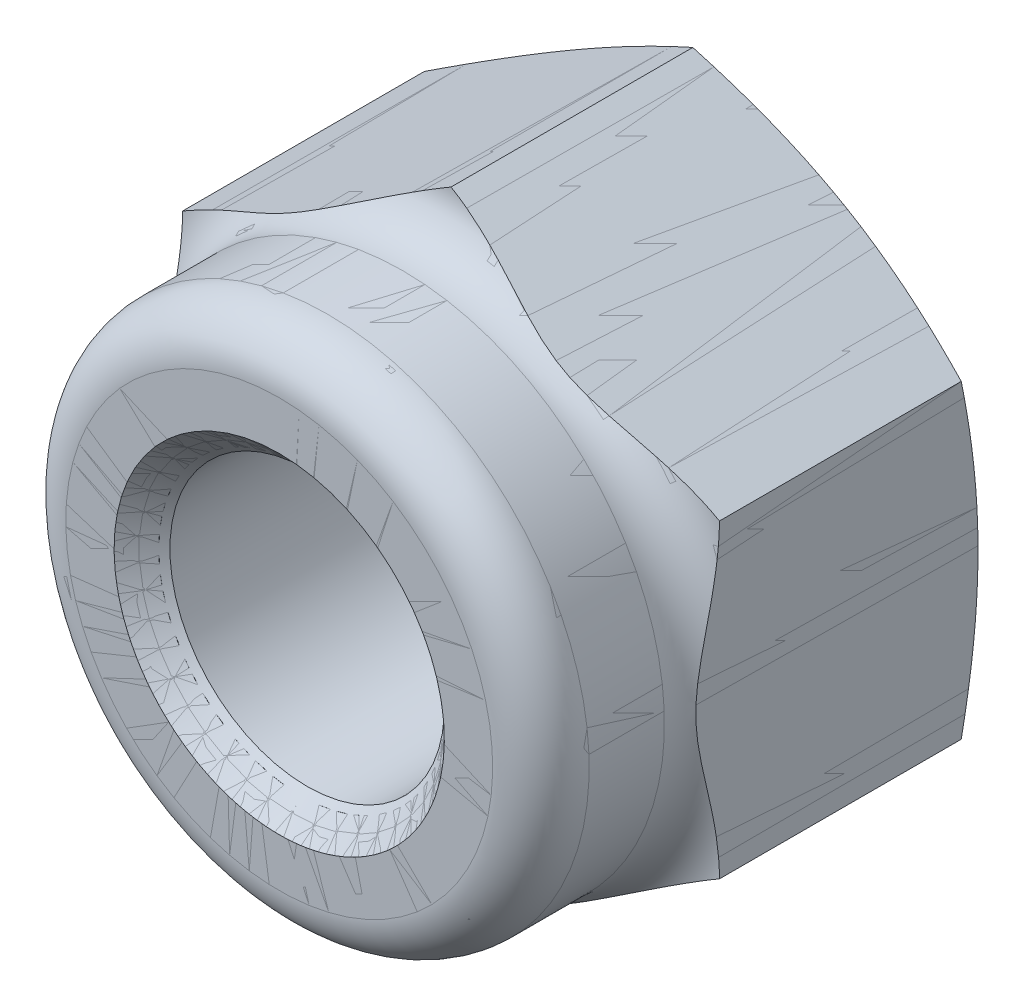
ISO-10303-21;
HEADER;
FILE_DESCRIPTION(('STEP AP214'),'2;1');
FILE_NAME('part.step','',(''),(''),'','','');
FILE_SCHEMA(('AUTOMOTIVE_DESIGN { 1 0 10303 214 1 1 1 1 }'));
ENDSEC;
DATA;
#1=APPLICATION_CONTEXT('core data for automotive mechanical design processes');
#2=APPLICATION_PROTOCOL_DEFINITION('international standard','automotive_design',2000,#1);
#3=PRODUCT_CONTEXT('',#1,'mechanical');
#4=PRODUCT('Part','Part','',(#3));
#5=PRODUCT_RELATED_PRODUCT_CATEGORY('part','',(#4));
#6=PRODUCT_DEFINITION_FORMATION('','',#4);
#7=PRODUCT_DEFINITION_CONTEXT('part definition',#1,'design');
#8=PRODUCT_DEFINITION('design','',#6,#7);
#9=PRODUCT_DEFINITION_SHAPE('','',#8);
#10=(LENGTH_UNIT() NAMED_UNIT(*) SI_UNIT(.MILLI.,.METRE.));
#11=(NAMED_UNIT(*) PLANE_ANGLE_UNIT() SI_UNIT($,.RADIAN.));
#12=(NAMED_UNIT(*) SI_UNIT($,.STERADIAN.) SOLID_ANGLE_UNIT());
#13=UNCERTAINTY_MEASURE_WITH_UNIT(LENGTH_MEASURE(1.E-05),#10,'distance_accuracy_value','');
#14=(GEOMETRIC_REPRESENTATION_CONTEXT(3) GLOBAL_UNCERTAINTY_ASSIGNED_CONTEXT((#13)) GLOBAL_UNIT_ASSIGNED_CONTEXT((#10,
#11,#12)) REPRESENTATION_CONTEXT('',''));
#15=CARTESIAN_POINT('',(0.,0.,0.));
#16=DIRECTION('',(0.,0.,1.));
#17=DIRECTION('',(1.,0.,0.));
#18=AXIS2_PLACEMENT_3D('',#15,#16,#17);
#19=CARTESIAN_POINT('',(6.5,3.752775,10.6));
#20=DIRECTION('',(1.,0.,0.));
#21=DIRECTION('',(0.,0.,-1.));
#22=AXIS2_PLACEMENT_3D('',#19,#20,#21);
#23=PLANE('',#22);
#24=DIRECTION('',(0.,0.,-1.));
#25=VECTOR('',#24,1.);
#26=CARTESIAN_POINT('',(6.5,-3.7527697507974,0.));
#27=LINE('',#26,#25);
#28=CARTESIAN_POINT('',(6.5,-3.7527697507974,6.44));
#29=VERTEX_POINT('',#28);
#30=CARTESIAN_POINT('',(6.5,-3.7527697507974,0.585454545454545));
#31=VERTEX_POINT('',#30);
#32=EDGE_CURVE('P0_E364',#29,#31,#27,.T.);
#33=ORIENTED_EDGE('',*,*,#32,.T.);
#34=CARTESIAN_POINT('',(6.5,-10.10080218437,2.4059777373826));
#35=CARTESIAN_POINT('',(6.5,-9.80151876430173,2.30432348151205));
#36=CARTESIAN_POINT('',(6.5,-9.50184302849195,2.20380301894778));
#37=CARTESIAN_POINT('',(6.5,-8.90149904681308,2.00567496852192));
#38=CARTESIAN_POINT('',(6.5,-8.60083070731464,1.90806766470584));
#39=CARTESIAN_POINT('',(6.5,-7.99755238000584,1.71617697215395));
#40=CARTESIAN_POINT('',(6.5,-7.69493935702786,1.62190309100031));
#41=CARTESIAN_POINT('',(6.5,-7.08834923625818,1.43786029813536));
#42=CARTESIAN_POINT('',(6.5,-6.78437217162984,1.34809127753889));
#43=CARTESIAN_POINT('',(6.5,-6.17632707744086,1.17465218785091));
#44=CARTESIAN_POINT('',(6.5,-5.87226718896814,1.09095372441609));
#45=CARTESIAN_POINT('',(6.5,-5.26226365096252,0.930630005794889));
#46=CARTESIAN_POINT('',(6.5,-4.95631993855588,0.854004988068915));
#47=CARTESIAN_POINT('',(6.5,-4.3425318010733,0.709733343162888));
#48=CARTESIAN_POINT('',(6.5,-4.03468886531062,0.642080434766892));
#49=CARTESIAN_POINT('',(6.5,-3.41675253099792,0.517929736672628));
#50=CARTESIAN_POINT('',(6.5,-3.10665932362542,0.461431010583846));
#51=CARTESIAN_POINT('',(6.5,-2.5544822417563,0.373292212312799));
#52=CARTESIAN_POINT('',(6.5,-2.31283654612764,0.3389195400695));
#53=CARTESIAN_POINT('',(6.5,-1.82839090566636,0.279512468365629));
#54=CARTESIAN_POINT('',(6.5,-1.58559099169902,0.25447782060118));
#55=CARTESIAN_POINT('',(6.5,-1.09926598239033,0.214740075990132));
#56=CARTESIAN_POINT('',(6.5,-0.855741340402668,0.2000315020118));
#57=CARTESIAN_POINT('',(6.5,-0.368273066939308,0.181570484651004));
#58=CARTESIAN_POINT('',(6.5,-0.124329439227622,0.177817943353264));
#59=CARTESIAN_POINT('',(6.5,0.363559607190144,0.181443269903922));
#60=CARTESIAN_POINT('',(6.5,0.60750499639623,0.18882504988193));
#61=CARTESIAN_POINT('',(6.5,1.0948241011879,0.214387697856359));
#62=CARTESIAN_POINT('',(6.5,1.33819780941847,0.232568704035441));
#63=CARTESIAN_POINT('',(6.5,1.82410848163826,0.278967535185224));
#64=CARTESIAN_POINT('',(6.5,2.06664491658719,0.307190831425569));
#65=CARTESIAN_POINT('',(6.5,2.55050937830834,0.372617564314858));
#66=CARTESIAN_POINT('',(6.5,2.79183729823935,0.40982178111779));
#67=CARTESIAN_POINT('',(6.5,3.34329863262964,0.504018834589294));
#68=CARTESIAN_POINT('',(6.5,3.6529846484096,0.563618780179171));
#69=CARTESIAN_POINT('',(6.5,4.27012676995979,0.693380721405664));
#70=CARTESIAN_POINT('',(6.5,4.57758270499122,0.763543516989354));
#71=CARTESIAN_POINT('',(6.5,5.1906019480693,0.912324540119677));
#72=CARTESIAN_POINT('',(6.5,5.49616413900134,0.990947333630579));
#73=CARTESIAN_POINT('',(6.5,6.10547180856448,1.15486192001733));
#74=CARTESIAN_POINT('',(6.5,6.40921734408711,1.24015350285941));
#75=CARTESIAN_POINT('',(6.5,7.01593466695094,1.41624786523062));
#76=CARTESIAN_POINT('',(6.5,7.31890253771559,1.5070640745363));
#77=CARTESIAN_POINT('',(6.5,7.92353810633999,1.69293431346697));
#78=CARTESIAN_POINT('',(6.5,8.22520577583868,1.78798843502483));
#79=CARTESIAN_POINT('',(6.5,8.82675974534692,1.98126867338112));
#80=CARTESIAN_POINT('',(6.5,9.12664854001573,2.07948705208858));
#81=CARTESIAN_POINT('',(6.5,9.72548131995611,2.27868101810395));
#82=CARTESIAN_POINT('',(6.5,10.0244253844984,2.37965636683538));
#83=CARTESIAN_POINT('',(6.5,10.322994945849,2.48170864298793));
#84=B_SPLINE_CURVE_WITH_KNOTS('',3,(#34,#35,#36,#37,#38,#39,#40,#41,#42,#43,#44,#45,#46,#47,#48,
#49,#50,#51,#52,#53,#54,#55,#56,#57,#58,#59,#60,#61,#62,#63,#64,#65,#66,#67,#68,#69,#70,#71,#72,
#73,#74,#75,#76,#77,#78,#79,#80,#81,#82,#83),.UNSPECIFIED.,.F.,.F.,(4,2,2,2,2,2,2,2,2,2,2,2,2,2,
2,2,2,2,2,2,2,2,2,2,4),(0.,0.948236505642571,1.89656516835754,2.84741029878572,3.79823243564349,
4.74427415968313,5.6903476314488,6.63575523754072,7.58108344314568,8.31316165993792,
9.04522040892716,9.77689056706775,10.5085541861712,11.2404749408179,11.9724050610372,
12.7047345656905,13.4371277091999,14.3829933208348,15.32893060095,16.2753810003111,
17.2218016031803,18.1706226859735,19.1194643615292,20.0661395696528,21.0127331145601),.UNSPECIFIED.);
#85=CARTESIAN_POINT('',(6.5,3.7527697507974,0.585454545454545));
#86=VERTEX_POINT('',#85);
#87=EDGE_CURVE('P0_E368',#31,#86,#84,.T.);
#88=ORIENTED_EDGE('',*,*,#87,.T.);
#89=DIRECTION('',(0.,0.,-1.));
#90=VECTOR('',#89,1.);
#91=CARTESIAN_POINT('',(6.5,3.7527697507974,0.));
#92=LINE('',#91,#90);
#93=CARTESIAN_POINT('',(6.5,3.7527697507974,6.44));
#94=VERTEX_POINT('',#93);
#95=EDGE_CURVE('P0_E454',#86,#94,#92,.F.);
#96=ORIENTED_EDGE('',*,*,#95,.T.);
#97=CARTESIAN_POINT('',(6.5,0.,7.01328528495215));
#98=CARTESIAN_POINT('',(6.5,0.0773177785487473,7.0132860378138));
#99=CARTESIAN_POINT('',(6.5,0.154634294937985,7.01093202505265));
#100=CARTESIAN_POINT('',(6.5,0.309005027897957,7.00178521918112));
#101=CARTESIAN_POINT('',(6.5,0.386059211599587,6.99499188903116));
#102=CARTESIAN_POINT('',(6.5,0.616927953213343,6.96891939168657));
#103=CARTESIAN_POINT('',(6.5,0.770079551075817,6.94395309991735));
#104=CARTESIAN_POINT('',(6.5,1.07711214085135,6.88550469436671));
#105=CARTESIAN_POINT('',(6.5,1.23096580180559,6.85189309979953));
#106=CARTESIAN_POINT('',(6.5,1.5379844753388,6.78238839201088));
#107=CARTESIAN_POINT('',(6.5,1.69115001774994,6.74649756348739));
#108=CARTESIAN_POINT('',(6.5,1.99226620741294,6.67785810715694));
#109=CARTESIAN_POINT('',(6.5,2.14020114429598,6.645042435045));
#110=CARTESIAN_POINT('',(6.5,2.43712873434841,6.58408012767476));
#111=CARTESIAN_POINT('',(6.5,2.58612181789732,6.55593552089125));
#112=CARTESIAN_POINT('',(6.5,2.88407943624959,6.50728423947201));
#113=CARTESIAN_POINT('',(6.5,3.03303325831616,6.48671413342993));
#114=CARTESIAN_POINT('',(6.5,3.33195436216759,6.45570795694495));
#115=CARTESIAN_POINT('',(6.5,3.48192077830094,6.44526412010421));
#116=CARTESIAN_POINT('',(6.5,3.77158359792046,6.43804447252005));
#117=CARTESIAN_POINT('',(6.5,3.9112527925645,6.44035043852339));
#118=CARTESIAN_POINT('',(6.5,4.19036398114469,6.45986695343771));
#119=CARTESIAN_POINT('',(6.5,4.32980241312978,6.47714157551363));
#120=CARTESIAN_POINT('',(6.5,4.53725088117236,6.51775057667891));
#121=CARTESIAN_POINT('',(6.5,4.60667091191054,6.53392909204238));
#122=CARTESIAN_POINT('',(6.5,4.74399623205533,6.57200401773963));
#123=CARTESIAN_POINT('',(6.5,4.81190074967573,6.59390327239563));
#124=CARTESIAN_POINT('',(6.5,4.94488290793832,6.64405256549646));
#125=CARTESIAN_POINT('',(6.5,5.00997529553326,6.67226295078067));
#126=CARTESIAN_POINT('',(6.5,5.13645693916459,6.73593388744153));
#127=CARTESIAN_POINT('',(6.5,5.19785198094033,6.77138270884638));
#128=CARTESIAN_POINT('',(6.5,5.30692740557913,6.84481523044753));
#129=CARTESIAN_POINT('',(6.5,5.35531937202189,6.88173125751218));
#130=CARTESIAN_POINT('',(6.5,5.44655493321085,6.96202159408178));
#131=CARTESIAN_POINT('',(6.5,5.48939580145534,7.00539905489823));
#132=CARTESIAN_POINT('',(6.5,5.56786020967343,7.09926808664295));
#133=CARTESIAN_POINT('',(6.5,5.6033895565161,7.14983982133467));
#134=CARTESIAN_POINT('',(6.5,5.66381504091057,7.25697945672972));
#135=CARTESIAN_POINT('',(6.5,5.68873779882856,7.31353189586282));
#136=CARTESIAN_POINT('',(6.5,5.72032790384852,7.41439258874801));
#137=CARTESIAN_POINT('',(6.5,5.7301467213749,7.45772273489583));
#138=CARTESIAN_POINT('',(6.5,5.74232092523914,7.54542138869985));
#139=CARTESIAN_POINT('',(6.5,5.744680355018,7.58978932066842));
#140=CARTESIAN_POINT('',(6.5,5.74176347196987,7.67828200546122));
#141=CARTESIAN_POINT('',(6.5,5.73648463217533,7.72240667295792));
#142=CARTESIAN_POINT('',(6.5,5.71866509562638,7.80915794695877));
#143=CARTESIAN_POINT('',(6.5,5.70612195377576,7.85178404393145));
#144=CARTESIAN_POINT('',(6.5,5.67436237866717,7.93508075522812));
#145=CARTESIAN_POINT('',(6.5,5.65506112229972,7.97571865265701));
#146=CARTESIAN_POINT('',(6.5,5.61085961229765,8.05379999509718));
#147=CARTESIAN_POINT('',(6.5,5.58595669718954,8.0912419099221));
#148=CARTESIAN_POINT('',(6.5,5.51763569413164,8.18093458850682));
#149=CARTESIAN_POINT('',(6.5,5.47126873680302,8.23094305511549));
#150=CARTESIAN_POINT('',(6.5,5.37115664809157,8.32291694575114));
#151=CARTESIAN_POINT('',(6.5,5.31739478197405,8.36486359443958));
#152=CARTESIAN_POINT('',(6.5,5.17663374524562,8.46036717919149));
#153=CARTESIAN_POINT('',(6.5,5.08646646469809,8.50922771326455));
#154=CARTESIAN_POINT('',(6.5,4.899768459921,8.59262551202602));
#155=CARTESIAN_POINT('',(6.5,4.8032230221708,8.62712821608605));
#156=CARTESIAN_POINT('',(6.5,4.62114015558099,8.67999601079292));
#157=CARTESIAN_POINT('',(6.5,4.53605844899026,8.69998346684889));
#158=CARTESIAN_POINT('',(6.5,4.36445334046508,8.7325364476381));
#159=CARTESIAN_POINT('',(6.5,4.27792890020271,8.74509636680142));
#160=CARTESIAN_POINT('',(6.5,4.10426462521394,8.76385839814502));
#161=CARTESIAN_POINT('',(6.5,4.01712512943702,8.77006377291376));
#162=CARTESIAN_POINT('',(6.5,3.84261745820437,8.77704536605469));
#163=CARTESIAN_POINT('',(6.5,3.75524921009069,8.7778195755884));
#164=CARTESIAN_POINT('',(6.5,3.51033071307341,8.77349059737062));
#165=CARTESIAN_POINT('',(6.5,3.35287336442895,8.76315716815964));
#166=CARTESIAN_POINT('',(6.5,3.03909498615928,8.7312580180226));
#167=CARTESIAN_POINT('',(6.5,2.8827749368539,8.70968355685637));
#168=CARTESIAN_POINT('',(6.5,2.57041716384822,8.65837679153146));
#169=CARTESIAN_POINT('',(6.5,2.41438879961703,8.62858932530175));
#170=CARTESIAN_POINT('',(6.5,2.10340009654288,8.56406711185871));
#171=CARTESIAN_POINT('',(6.5,1.94843973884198,8.5293324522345));
#172=CARTESIAN_POINT('',(6.5,1.70092705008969,8.4726270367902));
#173=CARTESIAN_POINT('',(6.5,1.60826406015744,8.45112263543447));
#174=CARTESIAN_POINT('',(6.5,1.42284763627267,8.40850983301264));
#175=CARTESIAN_POINT('',(6.5,1.3300942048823,8.38740142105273));
#176=CARTESIAN_POINT('',(6.5,1.14428957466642,8.34669062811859));
#177=CARTESIAN_POINT('',(6.5,1.05123850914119,8.3270876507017));
#178=CARTESIAN_POINT('',(6.5,0.86455820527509,8.29074180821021));
#179=CARTESIAN_POINT('',(6.5,0.770928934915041,8.27399910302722));
#180=CARTESIAN_POINT('',(6.5,0.583946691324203,8.24513153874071));
#181=CARTESIAN_POINT('',(6.5,0.490601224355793,8.23295982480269));
#182=CARTESIAN_POINT('',(6.5,0.303332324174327,8.21453533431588));
#183=CARTESIAN_POINT('',(6.5,0.209409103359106,8.20828049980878));
#184=CARTESIAN_POINT('',(6.5,0.0214910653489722,8.20267265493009));
#185=CARTESIAN_POINT('',(6.5,-0.0725034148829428,8.20330895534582));
#186=CARTESIAN_POINT('',(6.5,-0.260202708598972,8.21134908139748));
#187=CARTESIAN_POINT('',(6.5,-0.35390746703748,8.21875412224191));
#188=CARTESIAN_POINT('',(6.5,-0.577016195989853,8.24319220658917));
#189=CARTESIAN_POINT('',(6.5,-0.706120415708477,8.26285075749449));
#190=CARTESIAN_POINT('',(6.5,-0.96313127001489,8.30884269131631));
#191=CARTESIAN_POINT('',(6.5,-1.09103706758,8.33518042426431));
#192=CARTESIAN_POINT('',(6.5,-1.34684776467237,8.39093533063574));
#193=CARTESIAN_POINT('',(6.5,-1.47474923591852,8.42036773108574));
#194=CARTESIAN_POINT('',(6.5,-1.73047107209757,8.47937163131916));
#195=CARTESIAN_POINT('',(6.5,-1.85829144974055,8.50894307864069));
#196=CARTESIAN_POINT('',(6.5,-2.11555152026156,8.56631217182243));
#197=CARTESIAN_POINT('',(6.5,-2.24499541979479,8.59409141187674));
#198=CARTESIAN_POINT('',(6.5,-2.50466983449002,8.64566540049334));
#199=CARTESIAN_POINT('',(6.5,-2.63490019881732,8.6694608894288));
#200=CARTESIAN_POINT('',(6.5,-2.89589645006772,8.71117868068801));
#201=CARTESIAN_POINT('',(6.5,-3.02665931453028,8.72911942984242));
#202=CARTESIAN_POINT('',(6.5,-3.28898923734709,8.75731469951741));
#203=CARTESIAN_POINT('',(6.5,-3.42055579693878,8.76757357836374));
#204=CARTESIAN_POINT('',(6.5,-3.63634745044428,8.77629764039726));
#205=CARTESIAN_POINT('',(6.5,-3.72045301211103,8.77768924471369));
#206=CARTESIAN_POINT('',(6.5,-3.8886683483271,8.77579754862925));
#207=CARTESIAN_POINT('',(6.5,-3.97277810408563,8.77251191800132));
#208=CARTESIAN_POINT('',(6.5,-4.14061787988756,8.76050351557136));
#209=CARTESIAN_POINT('',(6.5,-4.22434794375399,8.75178138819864));
#210=CARTESIAN_POINT('',(6.5,-4.39087779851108,8.72801750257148));
#211=CARTESIAN_POINT('',(6.5,-4.47367809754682,8.71297938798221));
#212=CARTESIAN_POINT('',(6.5,-4.65516262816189,8.67154473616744));
#213=CARTESIAN_POINT('',(6.5,-4.75346446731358,8.64340880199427));
#214=CARTESIAN_POINT('',(6.5,-4.94536818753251,8.57408791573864));
#215=CARTESIAN_POINT('',(6.5,-5.03897813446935,8.5329263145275));
#216=CARTESIAN_POINT('',(6.5,-5.19273428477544,8.44872870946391));
#217=CARTESIAN_POINT('',(6.5,-5.25491515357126,8.40943955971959));
#218=CARTESIAN_POINT('',(6.5,-5.37263539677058,8.32183381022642));
#219=CARTESIAN_POINT('',(6.5,-5.42818351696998,8.27352931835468));
#220=CARTESIAN_POINT('',(6.5,-5.51628061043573,8.18117272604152));
#221=CARTESIAN_POINT('',(6.5,-5.55106034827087,8.13925881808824));
#222=CARTESIAN_POINT('',(6.5,-5.61347488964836,8.05039224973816));
#223=CARTESIAN_POINT('',(6.5,-5.64111901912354,8.00344628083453));
#224=CARTESIAN_POINT('',(6.5,-5.68382463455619,7.91290216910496));
#225=CARTESIAN_POINT('',(6.5,-5.70017265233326,7.86991403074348));
#226=CARTESIAN_POINT('',(6.5,-5.72543465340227,7.78179435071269));
#227=CARTESIAN_POINT('',(6.5,-5.73435255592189,7.736663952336));
#228=CARTESIAN_POINT('',(6.5,-5.74412178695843,7.64538709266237));
#229=CARTESIAN_POINT('',(6.5,-5.74494850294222,7.59923795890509));
#230=CARTESIAN_POINT('',(6.5,-5.73840594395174,7.50752793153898));
#231=CARTESIAN_POINT('',(6.5,-5.73103591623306,7.46196709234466));
#232=CARTESIAN_POINT('',(6.5,-5.70917550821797,7.37485447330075));
#233=CARTESIAN_POINT('',(6.5,-5.69502952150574,7.33321471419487));
#234=CARTESIAN_POINT('',(6.5,-5.66063889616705,7.25255746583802));
#235=CARTESIAN_POINT('',(6.5,-5.64039204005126,7.21354093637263));
#236=CARTESIAN_POINT('',(6.5,-5.58574487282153,7.12384352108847));
#237=CARTESIAN_POINT('',(6.5,-5.54891299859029,7.07464314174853));
#238=CARTESIAN_POINT('',(6.5,-5.46779089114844,6.98284044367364));
#239=CARTESIAN_POINT('',(6.5,-5.4234855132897,6.94025186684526));
#240=CARTESIAN_POINT('',(6.5,-5.30862103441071,6.84404410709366));
#241=CARTESIAN_POINT('',(6.5,-5.2351424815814,6.79392924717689));
#242=CARTESIAN_POINT('',(6.5,-5.08135668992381,6.70568271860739));
#243=CARTESIAN_POINT('',(6.5,-5.00103588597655,6.66757559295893));
#244=CARTESIAN_POINT('',(6.5,-4.85133101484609,6.6076831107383));
#245=CARTESIAN_POINT('',(6.5,-4.78261213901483,6.58419010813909));
#246=CARTESIAN_POINT('',(6.5,-4.64337454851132,6.5432532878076));
#247=CARTESIAN_POINT('',(6.5,-4.57285465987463,6.52581352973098));
#248=CARTESIAN_POINT('',(6.5,-4.35966389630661,6.48143309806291));
#249=CARTESIAN_POINT('',(6.5,-4.2153399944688,6.46242318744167));
#250=CARTESIAN_POINT('',(6.5,-3.89551593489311,6.43838714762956));
#251=CARTESIAN_POINT('',(6.5,-3.71978502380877,6.43709957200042));
#252=CARTESIAN_POINT('',(6.5,-3.36889843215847,6.45182335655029));
#253=CARTESIAN_POINT('',(6.5,-3.19374449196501,6.46786777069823));
#254=CARTESIAN_POINT('',(6.5,-2.84333736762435,6.51255027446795));
#255=CARTESIAN_POINT('',(6.5,-2.66810143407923,6.54131529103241));
#256=CARTESIAN_POINT('',(6.5,-2.31939419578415,6.60696710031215));
#257=CARTESIAN_POINT('',(6.5,-2.1459214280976,6.64384646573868));
#258=CARTESIAN_POINT('',(6.5,-1.80840522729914,6.71931919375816));
#259=CARTESIAN_POINT('',(6.5,-1.64432080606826,6.75773685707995));
#260=CARTESIAN_POINT('',(6.5,-1.39780883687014,6.8142033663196));
#261=CARTESIAN_POINT('',(6.5,-1.3155226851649,6.83284343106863));
#262=CARTESIAN_POINT('',(6.5,-1.15068913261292,6.86892068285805));
#263=CARTESIAN_POINT('',(6.5,-1.06814171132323,6.88635777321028));
#264=CARTESIAN_POINT('',(6.5,-0.822744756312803,6.93488937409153));
#265=CARTESIAN_POINT('',(6.5,-0.659208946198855,6.96294188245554));
#266=CARTESIAN_POINT('',(6.5,-0.412571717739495,6.99243778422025));
#267=CARTESIAN_POINT('',(6.5,-0.330247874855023,7.00017063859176));
#268=CARTESIAN_POINT('',(6.5,-0.16528216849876,7.01059354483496));
#269=CARTESIAN_POINT('',(6.5,-0.0826403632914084,7.01328448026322));
#270=CARTESIAN_POINT('',(6.5,0.,7.01328528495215));
#271=B_SPLINE_CURVE_WITH_KNOTS('',3,(#97,#98,#99,#100,#101,#102,#103,#104,#105,#106,#107,#108,
#109,#110,#111,#112,#113,#114,#115,#116,#117,#118,#119,#120,#121,#122,#123,#124,#125,#126,#127,
#128,#129,#130,#131,#132,#133,#134,#135,#136,#137,#138,#139,#140,#141,#142,#143,#144,#145,#146,
#147,#148,#149,#150,#151,#152,#153,#154,#155,#156,#157,#158,#159,#160,#161,#162,#163,#164,#165,
#166,#167,#168,#169,#170,#171,#172,#173,#174,#175,#176,#177,#178,#179,#180,#181,#182,#183,#184,
#185,#186,#187,#188,#189,#190,#191,#192,#193,#194,#195,#196,#197,#198,#199,#200,#201,#202,#203,
#204,#205,#206,#207,#208,#209,#210,#211,#212,#213,#214,#215,#216,#217,#218,#219,#220,#221,#222,
#223,#224,#225,#226,#227,#228,#229,#230,#231,#232,#233,#234,#235,#236,#237,#238,#239,#240,#241,
#242,#243,#244,#245,#246,#247,#248,#249,#250,#251,#252,#253,#254,#255,#256,#257,#258,#259,#260,
#261,#262,#263,#264,#265,#266,#267,#268,#269,#270),.UNSPECIFIED.,.T.,.F.,(4,2,2,2,2,2,2,2,2,2,2,
2,2,2,2,2,2,2,2,2,2,2,2,2,2,2,2,2,2,2,2,2,2,2,2,2,2,2,2,2,2,2,2,2,2,2,2,2,2,2,2,2,2,2,2,2,2,2,2,
2,2,2,2,2,2,2,2,2,2,2,2,2,2,2,2,2,2,2,2,2,2,2,2,2,2,2,4),(0.,0.231918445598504,
0.463864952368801,0.928859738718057,1.40127148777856,1.87321694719,2.3277795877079,
2.78253911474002,3.23339872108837,3.68391226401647,4.1024230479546,4.52273416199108,
4.73638167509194,4.95013561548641,5.16258247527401,5.3746877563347,5.5567932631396,
5.73898787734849,5.92340008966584,6.10734669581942,6.24004718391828,6.37267572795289,
6.50534815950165,6.63806527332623,6.77251168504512,6.90702211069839,7.11045474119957,
7.31435555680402,7.62030674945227,7.92699019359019,8.18881002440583,8.45082719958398,
8.712709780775,8.97468922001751,9.44746021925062,9.92059936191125,10.3969971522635,
10.873386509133,11.1587654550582,11.4441365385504,11.7293939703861,12.0146673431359,
12.2969310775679,12.5790966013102,12.8608245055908,13.142602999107,13.5340481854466,
13.9257489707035,14.3194762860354,14.7130653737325,15.1102046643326,15.5072700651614,
15.903072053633,16.2986493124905,16.5508945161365,16.8032654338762,17.0556064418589,
17.3078020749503,17.6138335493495,17.9193194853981,18.1393312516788,18.3590496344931,
18.5218689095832,18.6844742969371,18.8218607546,18.9591746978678,19.0969062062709,
19.234650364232,19.3660359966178,19.4974694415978,19.6808216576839,19.8645499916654,
20.1298960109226,20.3957809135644,20.6133455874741,20.8310558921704,21.2664071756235,
21.7924602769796,22.3195183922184,22.8519585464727,23.383913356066,23.8894875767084,
24.1425895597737,24.3957118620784,24.8928889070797,25.1408161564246,25.3886999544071),.UNSPECIFIED.);
#272=EDGE_CURVE('P0_E512',#29,#94,#271,.T.);
#273=ORIENTED_EDGE('',*,*,#272,.F.);
#274=EDGE_LOOP('',(#33,#88,#96,#273));
#275=FACE_BOUND('',#274,.T.);
#276=ADVANCED_FACE('P0_F348',(#275),#23,.T.);
#277=CARTESIAN_POINT('',(0.,0.,9.43148333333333));
#278=DIRECTION('',(0.,0.,-1.));
#279=DIRECTION('',(0.,1.,0.));
#280=AXIS2_PLACEMENT_3D('',#277,#278,#279);
#281=TOROIDAL_SURFACE('',#280,5.16851666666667,1.16851666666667);
#282=CARTESIAN_POINT('',(0.,0.,10.6));
#283=DIRECTION('',(0.,0.,-1.));
#284=DIRECTION('',(0.,1.,0.));
#285=AXIS2_PLACEMENT_3D('',#282,#283,#284);
#286=CIRCLE('',#285,5.16851666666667);
#287=CARTESIAN_POINT('',(0.,5.16851666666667,10.6));
#288=VERTEX_POINT('',#287);
#289=EDGE_CURVE('P0_E462',#288,#288,#286,.T.);
#290=ORIENTED_EDGE('',*,*,#289,.T.);
#291=EDGE_LOOP('',(#290));
#292=FACE_BOUND('',#291,.T.);
#293=CARTESIAN_POINT('',(0.,0.,9.43148333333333));
#294=DIRECTION('',(0.,0.,-1.));
#295=DIRECTION('',(0.,1.,0.));
#296=AXIS2_PLACEMENT_3D('',#293,#294,#295);
#297=CIRCLE('',#296,6.33703333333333);
#298=CARTESIAN_POINT('',(0.,6.33703333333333,9.43148333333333));
#299=VERTEX_POINT('',#298);
#300=EDGE_CURVE('P0_E602',#299,#299,#297,.T.);
#301=ORIENTED_EDGE('',*,*,#300,.F.);
#302=EDGE_LOOP('',(#301));
#303=FACE_BOUND('',#302,.T.);
#304=ADVANCED_FACE('P0_F572',(#292,#303),#281,.T.);
#305=CARTESIAN_POINT('',(0.,0.,0.));
#306=DIRECTION('',(0.,0.,-1.));
#307=DIRECTION('',(0.,1.,0.));
#308=AXIS2_PLACEMENT_3D('',#305,#306,#307);
#309=CYLINDRICAL_SURFACE('',#308,6.33703333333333);
#310=ORIENTED_EDGE('',*,*,#300,.T.);
#311=EDGE_LOOP('',(#310));
#312=FACE_BOUND('',#311,.T.);
#313=CARTESIAN_POINT('',(0.,0.,7.60851666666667));
#314=DIRECTION('',(0.,0.,-1.));
#315=DIRECTION('',(0.,1.,0.));
#316=AXIS2_PLACEMENT_3D('',#313,#314,#315);
#317=CIRCLE('',#316,6.33703333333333);
#318=CARTESIAN_POINT('',(0.,6.33703333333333,7.60851666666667));
#319=VERTEX_POINT('',#318);
#320=EDGE_CURVE('P0_E607',#319,#319,#317,.T.);
#321=ORIENTED_EDGE('',*,*,#320,.F.);
#322=EDGE_LOOP('',(#321));
#323=FACE_BOUND('',#322,.T.);
#324=ADVANCED_FACE('P0_F480',(#312,#323),#309,.T.);
#325=CARTESIAN_POINT('',(0.,0.,0.));
#326=DIRECTION('',(0.,0.,1.));
#327=DIRECTION('',(0.,-1.,0.));
#328=AXIS2_PLACEMENT_3D('',#325,#326,#327);
#329=CONICAL_SURFACE('',#328,6.05649915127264,1.18682389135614);
#330=ORIENTED_EDGE('',*,*,#87,.F.);
#331=CARTESIAN_POINT('',(0.,0.,0.585454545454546));
#332=DIRECTION('',(0.,0.,-1.));
#333=DIRECTION('',(0.,1.,0.));
#334=AXIS2_PLACEMENT_3D('',#331,#332,#333);
#335=CIRCLE('',#334,7.50555);
#336=CARTESIAN_POINT('',(6.49999545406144,-3.75277762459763,0.585454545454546));
#337=VERTEX_POINT('',#336);
#338=EDGE_CURVE('P0_E616',#31,#337,#335,.T.);
#339=ORIENTED_EDGE('',*,*,#338,.T.);
#340=CARTESIAN_POINT('',(6.49999631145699,-3.75277712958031,0.585454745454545));
#341=CARTESIAN_POINT('',(6.27290393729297,-3.88388891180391,0.532479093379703));
#342=CARTESIAN_POINT('',(6.04506202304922,-4.01543344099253,0.483494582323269));
#343=CARTESIAN_POINT('',(5.58787161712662,-4.27939232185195,0.395013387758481));
#344=CARTESIAN_POINT('',(5.35852232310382,-4.41180713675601,0.355522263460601));
#345=CARTESIAN_POINT('',(4.89864361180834,-4.67731811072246,0.287608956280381));
#346=CARTESIAN_POINT('',(4.66811456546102,-4.81041405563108,0.2591834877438));
#347=CARTESIAN_POINT('',(4.20620015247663,-5.07710034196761,0.214718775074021));
#348=CARTESIAN_POINT('',(3.97481498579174,-5.21069056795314,0.198676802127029));
#349=CARTESIAN_POINT('',(3.51556715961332,-5.47583730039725,0.179976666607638));
#350=CARTESIAN_POINT('',(3.28771140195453,-5.60738982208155,0.177095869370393));
#351=CARTESIAN_POINT('',(2.83213453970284,-5.87041712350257,0.18426761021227));
#352=CARTESIAN_POINT('',(2.60441344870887,-6.00189189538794,0.194321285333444));
#353=CARTESIAN_POINT('',(2.14979371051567,-6.26436660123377,0.226821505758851));
#354=CARTESIAN_POINT('',(1.92289463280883,-6.39536678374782,0.249260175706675));
#355=CARTESIAN_POINT('',(1.47017980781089,-6.65674168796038,0.305442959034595));
#356=CARTESIAN_POINT('',(1.24436395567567,-6.78711647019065,0.339185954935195));
#357=CARTESIAN_POINT('',(0.934030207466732,-6.96628765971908,0.392523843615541));
#358=CARTESIAN_POINT('',(0.848946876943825,-7.01541052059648,0.407872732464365));
#359=CARTESIAN_POINT('',(0.678981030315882,-7.11354030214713,0.439907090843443));
#360=CARTESIAN_POINT('',(0.594098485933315,-7.1625472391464,0.45659235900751));
#361=CARTESIAN_POINT('',(0.424236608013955,-7.26061699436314,0.491281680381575));
#362=CARTESIAN_POINT('',(0.339257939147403,-7.30967942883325,0.509290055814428));
#363=CARTESIAN_POINT('',(0.169486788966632,-7.40769680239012,0.546498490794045));
#364=CARTESIAN_POINT('',(0.084694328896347,-7.45665172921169,0.565698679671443));
#365=CARTESIAN_POINT('',(-1.999999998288E-07,-7.50555011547,0.585454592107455));
#366=B_SPLINE_CURVE_WITH_KNOTS('',3,(#340,#341,#342,#343,#344,#345,#346,#347,#348,#349,#350,
#351,#352,#353,#354,#355,#356,#357,#358,#359,#360,#361,#362,#363,#364,#365),.UNSPECIFIED.,.F.,
.F.,(4,2,2,2,2,2,2,2,2,2,2,2,4),(0.,0.802620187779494,1.6057092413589,2.40855965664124,
3.2112331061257,4.00027698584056,4.78939023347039,5.57800227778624,6.36653638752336,
6.66484325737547,6.96310526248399,7.26238909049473,7.56170545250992),.UNSPECIFIED.);
#367=CARTESIAN_POINT('',(0.,-7.50555,0.585454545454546));
#368=VERTEX_POINT('',#367);
#369=EDGE_CURVE('P0_E525',#337,#368,#366,.T.);
#370=ORIENTED_EDGE('',*,*,#369,.T.);
#371=CARTESIAN_POINT('',(2.E-07,-7.50555011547,0.585454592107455));
#372=CARTESIAN_POINT('',(-0.227092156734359,-7.37443834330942,0.53247895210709));
#373=CARTESIAN_POINT('',(-0.454934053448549,-7.24289382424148,0.483494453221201));
#374=CARTESIAN_POINT('',(-0.912124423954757,-6.97893496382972,0.39501328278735));
#375=CARTESIAN_POINT('',(-1.14147370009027,-6.84652015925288,0.355522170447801));
#376=CARTESIAN_POINT('',(-1.6013523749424,-6.581009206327,0.287608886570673));
#377=CARTESIAN_POINT('',(-1.8318814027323,-6.44791327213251,0.259183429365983));
#378=CARTESIAN_POINT('',(-2.29379577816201,-6.18122700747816,0.214718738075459));
#379=CARTESIAN_POINT('',(-2.52518092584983,-6.0476367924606,0.198676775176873));
#380=CARTESIAN_POINT('',(-2.98442871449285,-5.78249008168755,0.179976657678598));
#381=CARTESIAN_POINT('',(-3.21228445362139,-5.65093757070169,0.177095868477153));
#382=CARTESIAN_POINT('',(-3.66786127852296,-5.38791029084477,0.184267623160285));
#383=CARTESIAN_POINT('',(-3.89558235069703,-5.25643552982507,0.194321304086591));
#384=CARTESIAN_POINT('',(-4.35020205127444,-4.9939608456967,0.226821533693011));
#385=CARTESIAN_POINT('',(-4.57710111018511,-4.86296067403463,0.249260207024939));
#386=CARTESIAN_POINT('',(-5.02981589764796,-4.60158579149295,0.305442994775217));
#387=CARTESIAN_POINT('',(-5.25563173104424,-4.47121102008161,0.339185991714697));
#388=CARTESIAN_POINT('',(-5.5659654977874,-4.29203981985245,0.392523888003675));
#389=CARTESIAN_POINT('',(-5.65104886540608,-4.2429169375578,0.407872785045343));
#390=CARTESIAN_POINT('',(-5.82101478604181,-4.14478711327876,0.439907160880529));
#391=CARTESIAN_POINT('',(-5.90589736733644,-4.0957801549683,0.456592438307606));
#392=CARTESIAN_POINT('',(-6.07575931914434,-3.99771035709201,0.491281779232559));
#393=CARTESIAN_POINT('',(-6.16073802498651,-3.94864790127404,0.509290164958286));
#394=CARTESIAN_POINT('',(-6.33050924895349,-3.8506304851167,0.546498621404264));
#395=CARTESIAN_POINT('',(-6.41530174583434,-3.80167553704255,0.565698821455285));
#396=CARTESIAN_POINT('',(-6.49999631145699,-3.75277712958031,0.585454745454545));
#397=B_SPLINE_CURVE_WITH_KNOTS('',3,(#371,#372,#373,#374,#375,#376,#377,#378,#379,#380,#381,
#382,#383,#384,#385,#386,#387,#388,#389,#390,#391,#392,#393,#394,#395,#396),.UNSPECIFIED.,.F.,
.F.,(4,2,2,2,2,2,2,2,2,2,2,2,4),(0.,0.802620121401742,1.60570910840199,2.4085594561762,
3.21123283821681,4.00027665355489,4.78938983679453,5.57800181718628,6.36653586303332,
6.66484286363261,6.96310499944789,7.26238895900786,7.56170545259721),.UNSPECIFIED.);
#398=CARTESIAN_POINT('',(-6.49999545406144,-3.75277762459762,0.585454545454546));
#399=VERTEX_POINT('',#398);
#400=EDGE_CURVE('P0_E530',#368,#399,#397,.T.);
#401=ORIENTED_EDGE('',*,*,#400,.T.);
#402=CARTESIAN_POINT('',(-6.5,-3.7527697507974,0.585454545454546));
#403=VERTEX_POINT('',#402);
#404=EDGE_CURVE('P0_E614',#399,#403,#335,.T.);
#405=ORIENTED_EDGE('',*,*,#404,.T.);
#406=CARTESIAN_POINT('',(-6.5,-10.10080218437,2.4059777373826));
#407=CARTESIAN_POINT('',(-6.5,-9.80151876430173,2.30432348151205));
#408=CARTESIAN_POINT('',(-6.5,-9.50184302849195,2.20380301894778));
#409=CARTESIAN_POINT('',(-6.5,-8.90149904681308,2.00567496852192));
#410=CARTESIAN_POINT('',(-6.5,-8.60083070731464,1.90806766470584));
#411=CARTESIAN_POINT('',(-6.5,-7.99755238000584,1.71617697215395));
#412=CARTESIAN_POINT('',(-6.5,-7.69493935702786,1.62190309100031));
#413=CARTESIAN_POINT('',(-6.5,-7.08834923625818,1.43786029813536));
#414=CARTESIAN_POINT('',(-6.5,-6.78437217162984,1.34809127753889));
#415=CARTESIAN_POINT('',(-6.5,-6.17632707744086,1.17465218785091));
#416=CARTESIAN_POINT('',(-6.5,-5.87226718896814,1.09095372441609));
#417=CARTESIAN_POINT('',(-6.5,-5.26226365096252,0.930630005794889));
#418=CARTESIAN_POINT('',(-6.5,-4.95631993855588,0.854004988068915));
#419=CARTESIAN_POINT('',(-6.5,-4.3425318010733,0.709733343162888));
#420=CARTESIAN_POINT('',(-6.5,-4.03468886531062,0.642080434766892));
#421=CARTESIAN_POINT('',(-6.5,-3.41675253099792,0.517929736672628));
#422=CARTESIAN_POINT('',(-6.5,-3.10665932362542,0.461431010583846));
#423=CARTESIAN_POINT('',(-6.5,-2.5544822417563,0.373292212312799));
#424=CARTESIAN_POINT('',(-6.5,-2.31283654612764,0.3389195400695));
#425=CARTESIAN_POINT('',(-6.5,-1.82839090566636,0.279512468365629));
#426=CARTESIAN_POINT('',(-6.5,-1.58559099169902,0.25447782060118));
#427=CARTESIAN_POINT('',(-6.5,-1.09926598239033,0.214740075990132));
#428=CARTESIAN_POINT('',(-6.5,-0.855741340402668,0.2000315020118));
#429=CARTESIAN_POINT('',(-6.5,-0.368273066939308,0.181570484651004));
#430=CARTESIAN_POINT('',(-6.5,-0.124329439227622,0.177817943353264));
#431=CARTESIAN_POINT('',(-6.5,0.363559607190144,0.181443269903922));
#432=CARTESIAN_POINT('',(-6.5,0.60750499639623,0.18882504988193));
#433=CARTESIAN_POINT('',(-6.5,1.0948241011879,0.214387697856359));
#434=CARTESIAN_POINT('',(-6.5,1.33819780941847,0.232568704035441));
#435=CARTESIAN_POINT('',(-6.5,1.82410848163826,0.278967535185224));
#436=CARTESIAN_POINT('',(-6.5,2.06664491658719,0.307190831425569));
#437=CARTESIAN_POINT('',(-6.5,2.55050937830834,0.372617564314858));
#438=CARTESIAN_POINT('',(-6.5,2.79183729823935,0.40982178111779));
#439=CARTESIAN_POINT('',(-6.5,3.34329863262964,0.504018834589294));
#440=CARTESIAN_POINT('',(-6.5,3.6529846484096,0.563618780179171));
#441=CARTESIAN_POINT('',(-6.5,4.27012676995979,0.693380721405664));
#442=CARTESIAN_POINT('',(-6.5,4.57758270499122,0.763543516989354));
#443=CARTESIAN_POINT('',(-6.5,5.1906019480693,0.912324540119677));
#444=CARTESIAN_POINT('',(-6.5,5.49616413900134,0.990947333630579));
#445=CARTESIAN_POINT('',(-6.5,6.10547180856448,1.15486192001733));
#446=CARTESIAN_POINT('',(-6.5,6.40921734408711,1.24015350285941));
#447=CARTESIAN_POINT('',(-6.5,7.01593466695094,1.41624786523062));
#448=CARTESIAN_POINT('',(-6.5,7.31890253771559,1.5070640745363));
#449=CARTESIAN_POINT('',(-6.5,7.92353810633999,1.69293431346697));
#450=CARTESIAN_POINT('',(-6.5,8.22520577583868,1.78798843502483));
#451=CARTESIAN_POINT('',(-6.5,8.82675974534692,1.98126867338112));
#452=CARTESIAN_POINT('',(-6.5,9.12664854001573,2.07948705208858));
#453=CARTESIAN_POINT('',(-6.5,9.72548131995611,2.27868101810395));
#454=CARTESIAN_POINT('',(-6.5,10.0244253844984,2.37965636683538));
#455=CARTESIAN_POINT('',(-6.5,10.322994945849,2.48170864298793));
#456=B_SPLINE_CURVE_WITH_KNOTS('',3,(#406,#407,#408,#409,#410,#411,#412,#413,#414,#415,#416,
#417,#418,#419,#420,#421,#422,#423,#424,#425,#426,#427,#428,#429,#430,#431,#432,#433,#434,#435,
#436,#437,#438,#439,#440,#441,#442,#443,#444,#445,#446,#447,#448,#449,#450,#451,#452,#453,#454,
#455),.UNSPECIFIED.,.F.,.F.,(4,2,2,2,2,2,2,2,2,2,2,2,2,2,2,2,2,2,2,2,2,2,2,2,4),(0.,
0.948236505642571,1.89656516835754,2.84741029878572,3.79823243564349,4.74427415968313,
5.6903476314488,6.63575523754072,7.58108344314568,8.31316165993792,9.04522040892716,
9.77689056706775,10.5085541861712,11.2404749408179,11.9724050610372,12.7047345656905,
13.4371277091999,14.3829933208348,15.32893060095,16.2753810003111,17.2218016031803,
18.1706226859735,19.1194643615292,20.0661395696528,21.0127331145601),.UNSPECIFIED.);
#457=CARTESIAN_POINT('',(-6.5,3.7527697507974,0.585454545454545));
#458=VERTEX_POINT('',#457);
#459=EDGE_CURVE('P0_E436',#403,#458,#456,.T.);
#460=ORIENTED_EDGE('',*,*,#459,.T.);
#461=CARTESIAN_POINT('',(-6.49999545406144,3.75277762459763,0.585454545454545));
#462=VERTEX_POINT('',#461);
#463=EDGE_CURVE('P0_E432',#458,#462,#335,.T.);
#464=ORIENTED_EDGE('',*,*,#463,.T.);
#465=CARTESIAN_POINT('',(-6.49999631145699,3.7527771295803,0.585454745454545));
#466=CARTESIAN_POINT('',(-6.27290393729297,3.8838889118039,0.532479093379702));
#467=CARTESIAN_POINT('',(-6.04506202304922,4.01543344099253,0.483494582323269));
#468=CARTESIAN_POINT('',(-5.58787161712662,4.27939232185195,0.395013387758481));
#469=CARTESIAN_POINT('',(-5.35852232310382,4.41180713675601,0.355522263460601));
#470=CARTESIAN_POINT('',(-4.89864361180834,4.67731811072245,0.287608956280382));
#471=CARTESIAN_POINT('',(-4.66811456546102,4.81041405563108,0.2591834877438));
#472=CARTESIAN_POINT('',(-4.20620015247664,5.07710034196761,0.214718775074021));
#473=CARTESIAN_POINT('',(-3.97481498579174,5.21069056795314,0.198676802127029));
#474=CARTESIAN_POINT('',(-3.51556715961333,5.47583730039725,0.179976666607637));
#475=CARTESIAN_POINT('',(-3.28771140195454,5.60738982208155,0.177095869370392));
#476=CARTESIAN_POINT('',(-2.83213453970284,5.87041712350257,0.184267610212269));
#477=CARTESIAN_POINT('',(-2.60441344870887,6.00189189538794,0.194321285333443));
#478=CARTESIAN_POINT('',(-2.14979371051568,6.26436660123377,0.22682150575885));
#479=CARTESIAN_POINT('',(-1.92289463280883,6.39536678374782,0.249260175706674));
#480=CARTESIAN_POINT('',(-1.4701798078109,6.65674168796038,0.305442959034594));
#481=CARTESIAN_POINT('',(-1.24436395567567,6.78711647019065,0.339185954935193));
#482=CARTESIAN_POINT('',(-0.934030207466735,6.96628765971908,0.392523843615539));
#483=CARTESIAN_POINT('',(-0.848946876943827,7.01541052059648,0.407872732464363));
#484=CARTESIAN_POINT('',(-0.678981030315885,7.11354030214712,0.439907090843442));
#485=CARTESIAN_POINT('',(-0.594098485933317,7.1625472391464,0.456592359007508));
#486=CARTESIAN_POINT('',(-0.424236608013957,7.26061699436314,0.491281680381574));
#487=CARTESIAN_POINT('',(-0.339257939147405,7.30967942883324,0.509290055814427));
#488=CARTESIAN_POINT('',(-0.169486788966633,7.40769680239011,0.546498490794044));
#489=CARTESIAN_POINT('',(-0.0846943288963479,7.45665172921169,0.565698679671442));
#490=CARTESIAN_POINT('',(1.99999999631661E-07,7.50555011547,0.585454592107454));
#491=B_SPLINE_CURVE_WITH_KNOTS('',3,(#465,#466,#467,#468,#469,#470,#471,#472,#473,#474,#475,
#476,#477,#478,#479,#480,#481,#482,#483,#484,#485,#486,#487,#488,#489,#490),.UNSPECIFIED.,.F.,
.F.,(4,2,2,2,2,2,2,2,2,2,2,2,4),(0.,0.802620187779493,1.6057092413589,2.40855965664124,
3.2112331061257,4.00027698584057,4.78939023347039,5.57800227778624,6.36653638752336,
6.66484325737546,6.96310526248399,7.26238909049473,7.56170545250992),.UNSPECIFIED.);
#492=CARTESIAN_POINT('',(0.,7.50555,0.585454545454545));
#493=VERTEX_POINT('',#492);
#494=EDGE_CURVE('P0_E424',#462,#493,#491,.T.);
#495=ORIENTED_EDGE('',*,*,#494,.T.);
#496=CARTESIAN_POINT('',(-2.E-07,7.50555011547,0.585454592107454));
#497=CARTESIAN_POINT('',(0.22709215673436,7.37443834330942,0.532478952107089));
#498=CARTESIAN_POINT('',(0.454934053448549,7.24289382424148,0.483494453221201));
#499=CARTESIAN_POINT('',(0.912124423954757,6.97893496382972,0.395013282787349));
#500=CARTESIAN_POINT('',(1.14147370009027,6.84652015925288,0.3555221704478));
#501=CARTESIAN_POINT('',(1.6013523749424,6.581009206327,0.287608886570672));
#502=CARTESIAN_POINT('',(1.8318814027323,6.44791327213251,0.259183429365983));
#503=CARTESIAN_POINT('',(2.29379577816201,6.18122700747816,0.214718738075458));
#504=CARTESIAN_POINT('',(2.52518092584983,6.0476367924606,0.198676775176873));
#505=CARTESIAN_POINT('',(2.98442871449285,5.78249008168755,0.179976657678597));
#506=CARTESIAN_POINT('',(3.21228445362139,5.65093757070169,0.177095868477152));
#507=CARTESIAN_POINT('',(3.66786127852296,5.38791029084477,0.184267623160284));
#508=CARTESIAN_POINT('',(3.89558235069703,5.25643552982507,0.19432130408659));
#509=CARTESIAN_POINT('',(4.35020205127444,4.9939608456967,0.22682153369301));
#510=CARTESIAN_POINT('',(4.57710111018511,4.86296067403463,0.249260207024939));
#511=CARTESIAN_POINT('',(5.02981589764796,4.60158579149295,0.305442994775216));
#512=CARTESIAN_POINT('',(5.25563173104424,4.47121102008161,0.339185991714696));
#513=CARTESIAN_POINT('',(5.5659654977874,4.29203981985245,0.392523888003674));
#514=CARTESIAN_POINT('',(5.65104886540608,4.2429169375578,0.407872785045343));
#515=CARTESIAN_POINT('',(5.82101478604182,4.14478711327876,0.43990716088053));
#516=CARTESIAN_POINT('',(5.90589736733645,4.0957801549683,0.456592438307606));
#517=CARTESIAN_POINT('',(6.07575931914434,3.99771035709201,0.491281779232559));
#518=CARTESIAN_POINT('',(6.16073802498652,3.94864790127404,0.509290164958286));
#519=CARTESIAN_POINT('',(6.33050924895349,3.8506304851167,0.546498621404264));
#520=CARTESIAN_POINT('',(6.41530174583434,3.80167553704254,0.565698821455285));
#521=CARTESIAN_POINT('',(6.49999631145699,3.7527771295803,0.585454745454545));
#522=B_SPLINE_CURVE_WITH_KNOTS('',3,(#496,#497,#498,#499,#500,#501,#502,#503,#504,#505,#506,
#507,#508,#509,#510,#511,#512,#513,#514,#515,#516,#517,#518,#519,#520,#521),.UNSPECIFIED.,.F.,
.F.,(4,2,2,2,2,2,2,2,2,2,2,2,4),(0.,0.802620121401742,1.60570910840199,2.4085594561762,
3.21123283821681,4.00027665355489,4.78938983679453,5.57800181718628,6.36653586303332,
6.66484286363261,6.96310499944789,7.26238895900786,7.56170545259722),.UNSPECIFIED.);
#523=CARTESIAN_POINT('',(6.49999545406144,3.75277762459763,0.585454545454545));
#524=VERTEX_POINT('',#523);
#525=EDGE_CURVE('P0_E429',#493,#524,#522,.T.);
#526=ORIENTED_EDGE('',*,*,#525,.T.);
#527=EDGE_CURVE('P0_E444',#524,#86,#335,.T.);
#528=ORIENTED_EDGE('',*,*,#527,.T.);
#529=EDGE_LOOP('',(#330,#339,#370,#401,#405,#460,#464,#495,#526,#528));
#530=FACE_BOUND('',#529,.T.);
#531=CARTESIAN_POINT('',(0.,0.,0.));
#532=DIRECTION('',(0.,0.,1.));
#533=DIRECTION('',(1.,0.,0.));
#534=AXIS2_PLACEMENT_3D('',#531,#532,#533);
#535=CIRCLE('',#534,6.05649915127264);
#536=CARTESIAN_POINT('',(6.05649915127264,0.,0.));
#537=VERTEX_POINT('',#536);
#538=EDGE_CURVE('P0_E452',#537,#537,#535,.T.);
#539=ORIENTED_EDGE('',*,*,#538,.T.);
#540=EDGE_LOOP('',(#539));
#541=FACE_BOUND('',#540,.T.);
#542=ADVANCED_FACE('P0_F426',(#530,#541),#329,.T.);
#543=CARTESIAN_POINT('',(0.,0.,7.60851666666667));
#544=DIRECTION('',(0.,0.,-1.));
#545=DIRECTION('',(0.,1.,0.));
#546=AXIS2_PLACEMENT_3D('',#543,#544,#545);
#547=TOROIDAL_SURFACE('',#546,7.50555,1.16851666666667);
#548=ORIENTED_EDGE('',*,*,#320,.T.);
#549=EDGE_LOOP('',(#548));
#550=FACE_BOUND('',#549,.T.);
#551=CARTESIAN_POINT('',(0.,0.,6.44));
#552=DIRECTION('',(0.,0.,-1.));
#553=DIRECTION('',(0.,1.,0.));
#554=AXIS2_PLACEMENT_3D('',#551,#552,#553);
#555=CIRCLE('',#554,7.50555);
#556=CARTESIAN_POINT('',(6.49999545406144,-3.75277762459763,6.44));
#557=VERTEX_POINT('',#556);
#558=EDGE_CURVE('P0_E618',#29,#557,#555,.T.);
#559=ORIENTED_EDGE('',*,*,#558,.F.);
#560=ORIENTED_EDGE('',*,*,#272,.T.);
#561=CARTESIAN_POINT('',(6.49999545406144,3.75277762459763,6.44));
#562=VERTEX_POINT('',#561);
#563=EDGE_CURVE('P0_E613',#562,#94,#555,.T.);
#564=ORIENTED_EDGE('',*,*,#563,.F.);
#565=CARTESIAN_POINT('',(-2.E-07,7.50555011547,6.44));
#566=CARTESIAN_POINT('',(0.0802743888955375,7.45920358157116,6.44001852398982));
#567=CARTESIAN_POINT('',(0.160510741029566,7.41287912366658,6.44275565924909));
#568=CARTESIAN_POINT('',(0.320699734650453,7.32039400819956,6.45288999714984));
#569=CARTESIAN_POINT('',(0.400652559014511,7.27423324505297,6.46028324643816));
#570=CARTESIAN_POINT('',(0.559790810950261,7.18235477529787,6.47890697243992));
#571=CARTESIAN_POINT('',(0.638978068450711,7.13663601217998,6.4901173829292));
#572=CARTESIAN_POINT('',(0.79697866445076,7.04541436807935,6.51572297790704));
#573=CARTESIAN_POINT('',(0.875791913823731,6.99991153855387,6.53011888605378));
#574=CARTESIAN_POINT('',(1.11229441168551,6.86336682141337,6.57726368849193));
#575=CARTESIAN_POINT('',(1.2693968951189,6.77266370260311,6.61388329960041));
#576=CARTESIAN_POINT('',(1.58292565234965,6.59164787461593,6.69250585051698));
#577=CARTESIAN_POINT('',(1.73934935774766,6.50133664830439,6.73452164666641));
#578=CARTESIAN_POINT('',(1.97430320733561,6.36568604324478,6.79702352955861));
#579=CARTESIAN_POINT('',(2.05277461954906,6.32038057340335,6.81779671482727));
#580=CARTESIAN_POINT('',(2.20994913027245,6.2296358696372,6.85812821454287));
#581=CARTESIAN_POINT('',(2.28865221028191,6.18419664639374,6.87768662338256));
#582=CARTESIAN_POINT('',(2.4462648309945,6.09319899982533,6.91432368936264));
#583=CARTESIAN_POINT('',(2.52517312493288,6.04764129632,6.93140932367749));
#584=CARTESIAN_POINT('',(2.68355686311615,5.95619844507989,6.96172106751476));
#585=CARTESIAN_POINT('',(2.76303226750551,5.9103133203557,6.97494744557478));
#586=CARTESIAN_POINT('',(2.92257017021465,5.81820411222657,6.99603018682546));
#587=CARTESIAN_POINT('',(3.00263288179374,5.77197990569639,7.00388449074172));
#588=CARTESIAN_POINT('',(3.16303279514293,5.67937301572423,7.01306502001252));
#589=CARTESIAN_POINT('',(3.2433699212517,5.63299037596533,7.01439291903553));
#590=CARTESIAN_POINT('',(3.40404785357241,5.54022297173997,7.01030458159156));
#591=CARTESIAN_POINT('',(3.48438842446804,5.49383834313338,7.00487664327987));
#592=CARTESIAN_POINT('',(3.64460842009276,5.40133532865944,6.98809917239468));
#593=CARTESIAN_POINT('',(3.724487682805,5.35521703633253,6.97674767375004));
#594=CARTESIAN_POINT('',(3.91402192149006,5.24578944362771,6.94439719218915));
#595=CARTESIAN_POINT('',(4.02340746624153,5.18263569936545,6.92136972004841));
#596=CARTESIAN_POINT('',(4.24135359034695,5.05680450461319,6.87071330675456));
#597=CARTESIAN_POINT('',(4.34991397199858,4.99412716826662,6.84308329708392));
#598=CARTESIAN_POINT('',(4.56681212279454,4.86890102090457,6.78629901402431));
#599=CARTESIAN_POINT('',(4.67514967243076,4.8063523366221,6.75714364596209));
#600=CARTESIAN_POINT('',(4.89199146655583,4.68115872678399,6.69966038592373));
#601=CARTESIAN_POINT('',(5.00049570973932,4.61851380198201,6.67133248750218));
#602=CARTESIAN_POINT('',(5.22331070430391,4.48987156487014,6.6160792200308));
#603=CARTESIAN_POINT('',(5.337647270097,4.4238593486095,6.58928901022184));
#604=CARTESIAN_POINT('',(5.56706529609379,4.29140485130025,6.54065699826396));
#605=CARTESIAN_POINT('',(5.68214635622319,4.22496280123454,6.51881273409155));
#606=CARTESIAN_POINT('',(5.91390391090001,4.09115757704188,6.48188357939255));
#607=CARTESIAN_POINT('',(6.03058589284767,4.0237912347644,6.46684232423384));
#608=CARTESIAN_POINT('',(6.20618806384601,3.9224073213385,6.45113900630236));
#609=CARTESIAN_POINT('',(6.26487909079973,3.88852205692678,6.44704699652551));
#610=CARTESIAN_POINT('',(6.38237530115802,3.82068561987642,6.44147955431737));
#611=CARTESIAN_POINT('',(6.44118052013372,3.7867344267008,6.44000514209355));
#612=CARTESIAN_POINT('',(6.5000002,3.75277488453,6.44000000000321));
#613=B_SPLINE_CURVE_WITH_KNOTS('',3,(#565,#566,#567,#568,#569,#570,#571,#572,#573,#574,#575,
#576,#577,#578,#579,#580,#581,#582,#583,#584,#585,#586,#587,#588,#589,#590,#591,#592,#593,#594,
#595,#596,#597,#598,#599,#600,#601,#602,#603,#604,#605,#606,#607,#608,#609,#610,#611,#612),
.UNSPECIFIED.,.F.,.F.,(4,2,2,2,2,2,2,2,2,2,2,2,2,2,2,2,2,2,2,2,2,2,2,4),(0.,0.277976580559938,
0.55571745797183,0.832020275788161,1.10838592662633,1.66337811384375,2.21971798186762,
2.49860110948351,2.77746253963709,3.0555211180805,3.33356034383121,3.61170609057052,
3.88978050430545,4.16833724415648,4.44698649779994,4.83196777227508,5.21703854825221,
5.60238956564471,5.98773758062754,6.3918215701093,6.79570396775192,7.20214140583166,
7.40577787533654,7.60949369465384),.UNSPECIFIED.);
#614=CARTESIAN_POINT('',(0.,7.50555,6.44));
#615=VERTEX_POINT('',#614);
#616=EDGE_CURVE('P0_E357',#615,#562,#613,.T.);
#617=ORIENTED_EDGE('',*,*,#616,.F.);
#618=CARTESIAN_POINT('',(-6.5000002,3.75277488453,6.44000000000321));
#619=CARTESIAN_POINT('',(-6.41972589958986,3.79912125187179,6.44001841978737));
#620=CARTESIAN_POINT('',(-6.33948983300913,3.84544554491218,6.44275543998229));
#621=CARTESIAN_POINT('',(-6.17930140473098,3.93793033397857,6.45288953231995));
#622=CARTESIAN_POINT('',(-6.09934886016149,3.98409093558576,6.46028265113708));
#623=CARTESIAN_POINT('',(-5.94021115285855,4.07596909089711,6.47890610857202));
#624=CARTESIAN_POINT('',(-5.86102416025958,4.12168770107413,6.49011638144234));
#625=CARTESIAN_POINT('',(-5.70302409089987,4.21290904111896,6.51572169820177));
#626=CARTESIAN_POINT('',(-5.62421110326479,4.25841171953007,6.53011746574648));
#627=CARTESIAN_POINT('',(-5.38770935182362,4.39495600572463,6.57726185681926));
#628=CARTESIAN_POINT('',(-5.23060735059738,4.4856588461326,6.61388120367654));
#629=CARTESIAN_POINT('',(-4.917079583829,4.66667410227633,6.69250329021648));
#630=CARTESIAN_POINT('',(-4.76065638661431,4.75698503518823,6.73451888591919));
#631=CARTESIAN_POINT('',(-4.52570338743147,4.89263514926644,6.79702057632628));
#632=CARTESIAN_POINT('',(-4.44723230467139,4.93794042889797,6.81779370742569));
#633=CARTESIAN_POINT('',(-4.2900584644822,5.0286847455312,6.8581251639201));
#634=CARTESIAN_POINT('',(-4.21135572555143,5.07412377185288,6.87768358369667));
#635=CARTESIAN_POINT('',(-4.05374378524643,5.16512102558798,6.91432076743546));
#636=CARTESIAN_POINT('',(-3.97483583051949,5.21067853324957,6.93140650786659));
#637=CARTESIAN_POINT('',(-3.81645277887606,5.30212098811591,6.96171858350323));
#638=CARTESIAN_POINT('',(-3.73697772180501,5.34800591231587,6.97494518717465));
#639=CARTESIAN_POINT('',(-3.57744051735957,5.44011471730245,6.99602851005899));
#640=CARTESIAN_POINT('',(-3.49737815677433,5.48633872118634,7.00388317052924));
#641=CARTESIAN_POINT('',(-3.33697892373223,5.5789452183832,7.01306451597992));
#642=CARTESIAN_POINT('',(-3.25664212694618,5.62532766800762,7.0143928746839));
#643=CARTESIAN_POINT('',(-3.09596484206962,5.71809469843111,7.01030548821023));
#644=CARTESIAN_POINT('',(-3.01562458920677,5.76447914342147,7.00487804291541));
#645=CARTESIAN_POINT('',(-2.85540520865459,5.85698180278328,6.9881015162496));
#646=CARTESIAN_POINT('',(-2.77552624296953,5.90309992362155,6.97675046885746));
#647=CARTESIAN_POINT('',(-2.58599179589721,6.01252763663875,6.9444008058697));
#648=CARTESIAN_POINT('',(-2.47660575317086,6.0756816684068,6.92137359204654));
#649=CARTESIAN_POINT('',(-2.25865866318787,6.20151342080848,6.870717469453));
#650=CARTESIAN_POINT('',(-2.15009781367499,6.26419102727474,6.84308749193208));
#651=CARTESIAN_POINT('',(-1.93319871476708,6.38941772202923,6.78630312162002));
#652=CARTESIAN_POINT('',(-1.82486068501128,6.45196668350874,6.75714763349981));
#653=CARTESIAN_POINT('',(-1.60801794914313,6.57716083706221,6.69966404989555));
#654=CARTESIAN_POINT('',(-1.49951324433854,6.63980602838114,6.67133594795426));
#655=CARTESIAN_POINT('',(-1.27669707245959,6.76844894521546,6.61608215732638));
#656=CARTESIAN_POINT('',(-1.1623597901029,6.83446157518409,6.5892916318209));
#657=CARTESIAN_POINT('',(-0.93294032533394,6.96691690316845,6.54065899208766));
#658=CARTESIAN_POINT('',(-0.817858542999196,7.03335937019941,6.51881441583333));
#659=CARTESIAN_POINT('',(-0.586099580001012,7.16716540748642,6.48188468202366));
#660=CARTESIAN_POINT('',(-0.469416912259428,7.23453214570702,6.46684315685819));
#661=CARTESIAN_POINT('',(-0.293813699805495,7.3359166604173,6.45113948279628));
#662=CARTESIAN_POINT('',(-0.235122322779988,7.36980212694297,6.44704736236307));
#663=CARTESIAN_POINT('',(-0.117625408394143,7.43763897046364,6.44147972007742));
#664=CARTESIAN_POINT('',(-0.0588198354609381,7.47159036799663,6.44000521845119));
#665=CARTESIAN_POINT('',(2.00000000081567E-07,7.50555011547,6.44));
#666=B_SPLINE_CURVE_WITH_KNOTS('',3,(#618,#619,#620,#621,#622,#623,#624,#625,#626,#627,#628,
#629,#630,#631,#632,#633,#634,#635,#636,#637,#638,#639,#640,#641,#642,#643,#644,#645,#646,#647,
#648,#649,#650,#651,#652,#653,#654,#655,#656,#657,#658,#659,#660,#661,#662,#663,#664,#665),
.UNSPECIFIED.,.F.,.F.,(4,2,2,2,2,2,2,2,2,2,2,2,2,2,2,2,2,2,2,2,2,2,2,4),(0.,0.277975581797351,
0.555715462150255,0.83201731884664,1.10838200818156,1.66337239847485,2.21971041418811,
2.49859239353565,2.77745267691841,3.05551016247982,3.33354829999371,3.61169293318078,
3.88976623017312,4.16832178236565,4.44696984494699,4.83195266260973,5.21702499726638,
5.60237771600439,5.9877274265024,6.39181403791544,6.79569905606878,7.20213894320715,
7.4057766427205,7.60949369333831),.UNSPECIFIED.);
#667=CARTESIAN_POINT('',(-6.49999545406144,3.75277762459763,6.44));
#668=VERTEX_POINT('',#667);
#669=EDGE_CURVE('P0_E448',#668,#615,#666,.T.);
#670=ORIENTED_EDGE('',*,*,#669,.F.);
#671=CARTESIAN_POINT('',(-6.5,3.7527697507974,6.44));
#672=VERTEX_POINT('',#671);
#673=EDGE_CURVE('P0_E610',#672,#668,#555,.T.);
#674=ORIENTED_EDGE('',*,*,#673,.F.);
#675=CARTESIAN_POINT('',(-6.5,0.,7.01328528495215));
#676=CARTESIAN_POINT('',(-6.5,0.0773177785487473,7.0132860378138));
#677=CARTESIAN_POINT('',(-6.5,0.154634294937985,7.01093202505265));
#678=CARTESIAN_POINT('',(-6.5,0.309005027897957,7.00178521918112));
#679=CARTESIAN_POINT('',(-6.5,0.386059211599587,6.99499188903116));
#680=CARTESIAN_POINT('',(-6.5,0.616927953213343,6.96891939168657));
#681=CARTESIAN_POINT('',(-6.5,0.770079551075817,6.94395309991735));
#682=CARTESIAN_POINT('',(-6.5,1.07711214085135,6.88550469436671));
#683=CARTESIAN_POINT('',(-6.5,1.23096580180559,6.85189309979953));
#684=CARTESIAN_POINT('',(-6.5,1.5379844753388,6.78238839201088));
#685=CARTESIAN_POINT('',(-6.5,1.69115001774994,6.74649756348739));
#686=CARTESIAN_POINT('',(-6.5,1.99226620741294,6.67785810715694));
#687=CARTESIAN_POINT('',(-6.5,2.14020114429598,6.645042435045));
#688=CARTESIAN_POINT('',(-6.5,2.43712873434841,6.58408012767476));
#689=CARTESIAN_POINT('',(-6.5,2.58612181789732,6.55593552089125));
#690=CARTESIAN_POINT('',(-6.5,2.88407943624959,6.50728423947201));
#691=CARTESIAN_POINT('',(-6.5,3.03303325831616,6.48671413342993));
#692=CARTESIAN_POINT('',(-6.5,3.33195436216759,6.45570795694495));
#693=CARTESIAN_POINT('',(-6.5,3.48192077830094,6.44526412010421));
#694=CARTESIAN_POINT('',(-6.5,3.77158359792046,6.43804447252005));
#695=CARTESIAN_POINT('',(-6.5,3.9112527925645,6.44035043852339));
#696=CARTESIAN_POINT('',(-6.5,4.19036398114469,6.45986695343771));
#697=CARTESIAN_POINT('',(-6.5,4.32980241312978,6.47714157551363));
#698=CARTESIAN_POINT('',(-6.5,4.53725088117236,6.51775057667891));
#699=CARTESIAN_POINT('',(-6.5,4.60667091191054,6.53392909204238));
#700=CARTESIAN_POINT('',(-6.5,4.74399623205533,6.57200401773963));
#701=CARTESIAN_POINT('',(-6.5,4.81190074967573,6.59390327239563));
#702=CARTESIAN_POINT('',(-6.5,4.94488290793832,6.64405256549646));
#703=CARTESIAN_POINT('',(-6.5,5.00997529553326,6.67226295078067));
#704=CARTESIAN_POINT('',(-6.5,5.13645693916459,6.73593388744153));
#705=CARTESIAN_POINT('',(-6.5,5.19785198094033,6.77138270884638));
#706=CARTESIAN_POINT('',(-6.5,5.30692740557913,6.84481523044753));
#707=CARTESIAN_POINT('',(-6.5,5.35531937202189,6.88173125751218));
#708=CARTESIAN_POINT('',(-6.5,5.44655493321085,6.96202159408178));
#709=CARTESIAN_POINT('',(-6.5,5.48939580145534,7.00539905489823));
#710=CARTESIAN_POINT('',(-6.5,5.56786020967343,7.09926808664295));
#711=CARTESIAN_POINT('',(-6.5,5.6033895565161,7.14983982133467));
#712=CARTESIAN_POINT('',(-6.5,5.66381504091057,7.25697945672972));
#713=CARTESIAN_POINT('',(-6.5,5.68873779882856,7.31353189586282));
#714=CARTESIAN_POINT('',(-6.5,5.72032790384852,7.41439258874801));
#715=CARTESIAN_POINT('',(-6.5,5.7301467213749,7.45772273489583));
#716=CARTESIAN_POINT('',(-6.5,5.74232092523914,7.54542138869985));
#717=CARTESIAN_POINT('',(-6.5,5.744680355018,7.58978932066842));
#718=CARTESIAN_POINT('',(-6.5,5.74176347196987,7.67828200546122));
#719=CARTESIAN_POINT('',(-6.5,5.73648463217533,7.72240667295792));
#720=CARTESIAN_POINT('',(-6.5,5.71866509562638,7.80915794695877));
#721=CARTESIAN_POINT('',(-6.5,5.70612195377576,7.85178404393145));
#722=CARTESIAN_POINT('',(-6.5,5.67436237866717,7.93508075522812));
#723=CARTESIAN_POINT('',(-6.5,5.65506112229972,7.97571865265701));
#724=CARTESIAN_POINT('',(-6.5,5.61085961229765,8.05379999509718));
#725=CARTESIAN_POINT('',(-6.5,5.58595669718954,8.0912419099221));
#726=CARTESIAN_POINT('',(-6.5,5.51763569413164,8.18093458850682));
#727=CARTESIAN_POINT('',(-6.5,5.47126873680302,8.23094305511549));
#728=CARTESIAN_POINT('',(-6.5,5.37115664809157,8.32291694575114));
#729=CARTESIAN_POINT('',(-6.5,5.31739478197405,8.36486359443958));
#730=CARTESIAN_POINT('',(-6.5,5.17663374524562,8.46036717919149));
#731=CARTESIAN_POINT('',(-6.5,5.08646646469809,8.50922771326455));
#732=CARTESIAN_POINT('',(-6.5,4.899768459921,8.59262551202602));
#733=CARTESIAN_POINT('',(-6.5,4.8032230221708,8.62712821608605));
#734=CARTESIAN_POINT('',(-6.5,4.62114015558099,8.67999601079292));
#735=CARTESIAN_POINT('',(-6.5,4.53605844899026,8.69998346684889));
#736=CARTESIAN_POINT('',(-6.5,4.36445334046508,8.7325364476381));
#737=CARTESIAN_POINT('',(-6.5,4.27792890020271,8.74509636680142));
#738=CARTESIAN_POINT('',(-6.5,4.10426462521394,8.76385839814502));
#739=CARTESIAN_POINT('',(-6.5,4.01712512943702,8.77006377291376));
#740=CARTESIAN_POINT('',(-6.5,3.84261745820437,8.77704536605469));
#741=CARTESIAN_POINT('',(-6.5,3.75524921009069,8.7778195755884));
#742=CARTESIAN_POINT('',(-6.5,3.51033071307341,8.77349059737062));
#743=CARTESIAN_POINT('',(-6.5,3.35287336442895,8.76315716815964));
#744=CARTESIAN_POINT('',(-6.5,3.03909498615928,8.7312580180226));
#745=CARTESIAN_POINT('',(-6.5,2.8827749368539,8.70968355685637));
#746=CARTESIAN_POINT('',(-6.5,2.57041716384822,8.65837679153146));
#747=CARTESIAN_POINT('',(-6.5,2.41438879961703,8.62858932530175));
#748=CARTESIAN_POINT('',(-6.5,2.10340009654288,8.56406711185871));
#749=CARTESIAN_POINT('',(-6.5,1.94843973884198,8.5293324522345));
#750=CARTESIAN_POINT('',(-6.5,1.70092705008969,8.4726270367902));
#751=CARTESIAN_POINT('',(-6.5,1.60826406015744,8.45112263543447));
#752=CARTESIAN_POINT('',(-6.5,1.42284763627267,8.40850983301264));
#753=CARTESIAN_POINT('',(-6.5,1.3300942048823,8.38740142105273));
#754=CARTESIAN_POINT('',(-6.5,1.14428957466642,8.34669062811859));
#755=CARTESIAN_POINT('',(-6.5,1.05123850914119,8.3270876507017));
#756=CARTESIAN_POINT('',(-6.5,0.86455820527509,8.29074180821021));
#757=CARTESIAN_POINT('',(-6.5,0.770928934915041,8.27399910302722));
#758=CARTESIAN_POINT('',(-6.5,0.583946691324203,8.24513153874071));
#759=CARTESIAN_POINT('',(-6.5,0.490601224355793,8.23295982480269));
#760=CARTESIAN_POINT('',(-6.5,0.303332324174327,8.21453533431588));
#761=CARTESIAN_POINT('',(-6.5,0.209409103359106,8.20828049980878));
#762=CARTESIAN_POINT('',(-6.5,0.0214910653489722,8.20267265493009));
#763=CARTESIAN_POINT('',(-6.5,-0.0725034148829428,8.20330895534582));
#764=CARTESIAN_POINT('',(-6.5,-0.260202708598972,8.21134908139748));
#765=CARTESIAN_POINT('',(-6.5,-0.35390746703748,8.21875412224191));
#766=CARTESIAN_POINT('',(-6.5,-0.577016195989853,8.24319220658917));
#767=CARTESIAN_POINT('',(-6.5,-0.706120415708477,8.26285075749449));
#768=CARTESIAN_POINT('',(-6.5,-0.96313127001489,8.30884269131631));
#769=CARTESIAN_POINT('',(-6.5,-1.09103706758,8.33518042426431));
#770=CARTESIAN_POINT('',(-6.5,-1.34684776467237,8.39093533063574));
#771=CARTESIAN_POINT('',(-6.5,-1.47474923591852,8.42036773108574));
#772=CARTESIAN_POINT('',(-6.5,-1.73047107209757,8.47937163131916));
#773=CARTESIAN_POINT('',(-6.5,-1.85829144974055,8.50894307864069));
#774=CARTESIAN_POINT('',(-6.5,-2.11555152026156,8.56631217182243));
#775=CARTESIAN_POINT('',(-6.5,-2.24499541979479,8.59409141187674));
#776=CARTESIAN_POINT('',(-6.5,-2.50466983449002,8.64566540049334));
#777=CARTESIAN_POINT('',(-6.5,-2.63490019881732,8.6694608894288));
#778=CARTESIAN_POINT('',(-6.5,-2.89589645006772,8.71117868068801));
#779=CARTESIAN_POINT('',(-6.5,-3.02665931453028,8.72911942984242));
#780=CARTESIAN_POINT('',(-6.5,-3.28898923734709,8.75731469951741));
#781=CARTESIAN_POINT('',(-6.5,-3.42055579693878,8.76757357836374));
#782=CARTESIAN_POINT('',(-6.5,-3.63634745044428,8.77629764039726));
#783=CARTESIAN_POINT('',(-6.5,-3.72045301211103,8.77768924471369));
#784=CARTESIAN_POINT('',(-6.5,-3.8886683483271,8.77579754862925));
#785=CARTESIAN_POINT('',(-6.5,-3.97277810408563,8.77251191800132));
#786=CARTESIAN_POINT('',(-6.5,-4.14061787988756,8.76050351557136));
#787=CARTESIAN_POINT('',(-6.5,-4.22434794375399,8.75178138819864));
#788=CARTESIAN_POINT('',(-6.5,-4.39087779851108,8.72801750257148));
#789=CARTESIAN_POINT('',(-6.5,-4.47367809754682,8.71297938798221));
#790=CARTESIAN_POINT('',(-6.5,-4.65516262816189,8.67154473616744));
#791=CARTESIAN_POINT('',(-6.5,-4.75346446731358,8.64340880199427));
#792=CARTESIAN_POINT('',(-6.5,-4.94536818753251,8.57408791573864));
#793=CARTESIAN_POINT('',(-6.5,-5.03897813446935,8.5329263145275));
#794=CARTESIAN_POINT('',(-6.5,-5.19273428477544,8.44872870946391));
#795=CARTESIAN_POINT('',(-6.5,-5.25491515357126,8.40943955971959));
#796=CARTESIAN_POINT('',(-6.5,-5.37263539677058,8.32183381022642));
#797=CARTESIAN_POINT('',(-6.5,-5.42818351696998,8.27352931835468));
#798=CARTESIAN_POINT('',(-6.5,-5.51628061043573,8.18117272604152));
#799=CARTESIAN_POINT('',(-6.5,-5.55106034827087,8.13925881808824));
#800=CARTESIAN_POINT('',(-6.5,-5.61347488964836,8.05039224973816));
#801=CARTESIAN_POINT('',(-6.5,-5.64111901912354,8.00344628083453));
#802=CARTESIAN_POINT('',(-6.5,-5.68382463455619,7.91290216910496));
#803=CARTESIAN_POINT('',(-6.5,-5.70017265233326,7.86991403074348));
#804=CARTESIAN_POINT('',(-6.5,-5.72543465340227,7.78179435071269));
#805=CARTESIAN_POINT('',(-6.5,-5.73435255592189,7.736663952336));
#806=CARTESIAN_POINT('',(-6.5,-5.74412178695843,7.64538709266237));
#807=CARTESIAN_POINT('',(-6.5,-5.74494850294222,7.59923795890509));
#808=CARTESIAN_POINT('',(-6.5,-5.73840594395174,7.50752793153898));
#809=CARTESIAN_POINT('',(-6.5,-5.73103591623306,7.46196709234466));
#810=CARTESIAN_POINT('',(-6.5,-5.70917550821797,7.37485447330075));
#811=CARTESIAN_POINT('',(-6.5,-5.69502952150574,7.33321471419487));
#812=CARTESIAN_POINT('',(-6.5,-5.66063889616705,7.25255746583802));
#813=CARTESIAN_POINT('',(-6.5,-5.64039204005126,7.21354093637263));
#814=CARTESIAN_POINT('',(-6.5,-5.58574487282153,7.12384352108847));
#815=CARTESIAN_POINT('',(-6.5,-5.54891299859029,7.07464314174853));
#816=CARTESIAN_POINT('',(-6.5,-5.46779089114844,6.98284044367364));
#817=CARTESIAN_POINT('',(-6.5,-5.4234855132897,6.94025186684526));
#818=CARTESIAN_POINT('',(-6.5,-5.30862103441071,6.84404410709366));
#819=CARTESIAN_POINT('',(-6.5,-5.2351424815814,6.79392924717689));
#820=CARTESIAN_POINT('',(-6.5,-5.08135668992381,6.70568271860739));
#821=CARTESIAN_POINT('',(-6.5,-5.00103588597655,6.66757559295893));
#822=CARTESIAN_POINT('',(-6.5,-4.85133101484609,6.6076831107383));
#823=CARTESIAN_POINT('',(-6.5,-4.78261213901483,6.58419010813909));
#824=CARTESIAN_POINT('',(-6.5,-4.64337454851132,6.5432532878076));
#825=CARTESIAN_POINT('',(-6.5,-4.57285465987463,6.52581352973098));
#826=CARTESIAN_POINT('',(-6.5,-4.35966389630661,6.48143309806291));
#827=CARTESIAN_POINT('',(-6.5,-4.2153399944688,6.46242318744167));
#828=CARTESIAN_POINT('',(-6.5,-3.89551593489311,6.43838714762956));
#829=CARTESIAN_POINT('',(-6.5,-3.71978502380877,6.43709957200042));
#830=CARTESIAN_POINT('',(-6.5,-3.36889843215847,6.45182335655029));
#831=CARTESIAN_POINT('',(-6.5,-3.19374449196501,6.46786777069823));
#832=CARTESIAN_POINT('',(-6.5,-2.84333736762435,6.51255027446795));
#833=CARTESIAN_POINT('',(-6.5,-2.66810143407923,6.54131529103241));
#834=CARTESIAN_POINT('',(-6.5,-2.31939419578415,6.60696710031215));
#835=CARTESIAN_POINT('',(-6.5,-2.1459214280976,6.64384646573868));
#836=CARTESIAN_POINT('',(-6.5,-1.80840522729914,6.71931919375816));
#837=CARTESIAN_POINT('',(-6.5,-1.64432080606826,6.75773685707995));
#838=CARTESIAN_POINT('',(-6.5,-1.39780883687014,6.8142033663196));
#839=CARTESIAN_POINT('',(-6.5,-1.3155226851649,6.83284343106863));
#840=CARTESIAN_POINT('',(-6.5,-1.15068913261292,6.86892068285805));
#841=CARTESIAN_POINT('',(-6.5,-1.06814171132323,6.88635777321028));
#842=CARTESIAN_POINT('',(-6.5,-0.822744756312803,6.93488937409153));
#843=CARTESIAN_POINT('',(-6.5,-0.659208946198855,6.96294188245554));
#844=CARTESIAN_POINT('',(-6.5,-0.412571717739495,6.99243778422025));
#845=CARTESIAN_POINT('',(-6.5,-0.330247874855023,7.00017063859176));
#846=CARTESIAN_POINT('',(-6.5,-0.16528216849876,7.01059354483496));
#847=CARTESIAN_POINT('',(-6.5,-0.0826403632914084,7.01328448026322));
#848=CARTESIAN_POINT('',(-6.5,0.,7.01328528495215));
#849=B_SPLINE_CURVE_WITH_KNOTS('',3,(#675,#676,#677,#678,#679,#680,#681,#682,#683,#684,#685,
#686,#687,#688,#689,#690,#691,#692,#693,#694,#695,#696,#697,#698,#699,#700,#701,#702,#703,#704,
#705,#706,#707,#708,#709,#710,#711,#712,#713,#714,#715,#716,#717,#718,#719,#720,#721,#722,#723,
#724,#725,#726,#727,#728,#729,#730,#731,#732,#733,#734,#735,#736,#737,#738,#739,#740,#741,#742,
#743,#744,#745,#746,#747,#748,#749,#750,#751,#752,#753,#754,#755,#756,#757,#758,#759,#760,#761,
#762,#763,#764,#765,#766,#767,#768,#769,#770,#771,#772,#773,#774,#775,#776,#777,#778,#779,#780,
#781,#782,#783,#784,#785,#786,#787,#788,#789,#790,#791,#792,#793,#794,#795,#796,#797,#798,#799,
#800,#801,#802,#803,#804,#805,#806,#807,#808,#809,#810,#811,#812,#813,#814,#815,#816,#817,#818,
#819,#820,#821,#822,#823,#824,#825,#826,#827,#828,#829,#830,#831,#832,#833,#834,#835,#836,#837,
#838,#839,#840,#841,#842,#843,#844,#845,#846,#847,#848),.UNSPECIFIED.,.T.,.F.,(4,2,2,2,2,2,2,2,
2,2,2,2,2,2,2,2,2,2,2,2,2,2,2,2,2,2,2,2,2,2,2,2,2,2,2,2,2,2,2,2,2,2,2,2,2,2,2,2,2,2,2,2,2,2,2,2,
2,2,2,2,2,2,2,2,2,2,2,2,2,2,2,2,2,2,2,2,2,2,2,2,2,2,2,2,2,2,4),(0.,0.231918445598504,
0.463864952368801,0.928859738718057,1.40127148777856,1.87321694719,2.3277795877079,
2.78253911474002,3.23339872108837,3.68391226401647,4.1024230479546,4.52273416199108,
4.73638167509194,4.95013561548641,5.16258247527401,5.3746877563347,5.5567932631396,
5.73898787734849,5.92340008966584,6.10734669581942,6.24004718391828,6.37267572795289,
6.50534815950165,6.63806527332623,6.77251168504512,6.90702211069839,7.11045474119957,
7.31435555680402,7.62030674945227,7.92699019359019,8.18881002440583,8.45082719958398,
8.712709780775,8.97468922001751,9.44746021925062,9.92059936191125,10.3969971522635,
10.873386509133,11.1587654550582,11.4441365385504,11.7293939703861,12.0146673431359,
12.2969310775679,12.5790966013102,12.8608245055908,13.142602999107,13.5340481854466,
13.9257489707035,14.3194762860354,14.7130653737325,15.1102046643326,15.5072700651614,
15.903072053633,16.2986493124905,16.5508945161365,16.8032654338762,17.0556064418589,
17.3078020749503,17.6138335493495,17.9193194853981,18.1393312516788,18.3590496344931,
18.5218689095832,18.6844742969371,18.8218607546,18.9591746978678,19.0969062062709,
19.234650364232,19.3660359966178,19.4974694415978,19.6808216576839,19.8645499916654,
20.1298960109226,20.3957809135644,20.6133455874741,20.8310558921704,21.2664071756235,
21.7924602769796,22.3195183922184,22.8519585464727,23.383913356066,23.8894875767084,
24.1425895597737,24.3957118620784,24.8928889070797,25.1408161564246,25.3886999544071),.UNSPECIFIED.);
#850=CARTESIAN_POINT('',(-6.5,-3.7527697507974,6.44));
#851=VERTEX_POINT('',#850);
#852=EDGE_CURVE('P0_E496',#851,#672,#849,.T.);
#853=ORIENTED_EDGE('',*,*,#852,.F.);
#854=CARTESIAN_POINT('',(-6.49999545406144,-3.75277762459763,6.44));
#855=VERTEX_POINT('',#854);
#856=EDGE_CURVE('P0_E612',#855,#851,#555,.T.);
#857=ORIENTED_EDGE('',*,*,#856,.F.);
#858=CARTESIAN_POINT('',(2.E-07,-7.50555011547,6.44));
#859=CARTESIAN_POINT('',(-0.0802743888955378,-7.45920358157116,6.44001852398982));
#860=CARTESIAN_POINT('',(-0.160510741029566,-7.41287912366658,6.44275565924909));
#861=CARTESIAN_POINT('',(-0.320699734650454,-7.32039400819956,6.45288999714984));
#862=CARTESIAN_POINT('',(-0.400652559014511,-7.27423324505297,6.46028324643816));
#863=CARTESIAN_POINT('',(-0.559790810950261,-7.18235477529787,6.47890697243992));
#864=CARTESIAN_POINT('',(-0.638978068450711,-7.13663601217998,6.4901173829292));
#865=CARTESIAN_POINT('',(-0.796978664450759,-7.04541436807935,6.51572297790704));
#866=CARTESIAN_POINT('',(-0.87579191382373,-6.99991153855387,6.53011888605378));
#867=CARTESIAN_POINT('',(-1.11229441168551,-6.86336682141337,6.57726368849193));
#868=CARTESIAN_POINT('',(-1.26939689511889,-6.77266370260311,6.61388329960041));
#869=CARTESIAN_POINT('',(-1.58292565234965,-6.59164787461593,6.69250585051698));
#870=CARTESIAN_POINT('',(-1.73934935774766,-6.50133664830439,6.73452164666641));
#871=CARTESIAN_POINT('',(-1.97430320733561,-6.36568604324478,6.79702352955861));
#872=CARTESIAN_POINT('',(-2.05277461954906,-6.32038057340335,6.81779671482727));
#873=CARTESIAN_POINT('',(-2.20994913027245,-6.2296358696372,6.85812821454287));
#874=CARTESIAN_POINT('',(-2.28865221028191,-6.18419664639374,6.87768662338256));
#875=CARTESIAN_POINT('',(-2.4462648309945,-6.09319899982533,6.91432368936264));
#876=CARTESIAN_POINT('',(-2.52517312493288,-6.04764129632,6.93140932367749));
#877=CARTESIAN_POINT('',(-2.68355686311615,-5.95619844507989,6.96172106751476));
#878=CARTESIAN_POINT('',(-2.76303226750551,-5.91031332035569,6.97494744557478));
#879=CARTESIAN_POINT('',(-2.92257017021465,-5.81820411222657,6.99603018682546));
#880=CARTESIAN_POINT('',(-3.00263288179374,-5.77197990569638,7.00388449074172));
#881=CARTESIAN_POINT('',(-3.16303279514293,-5.67937301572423,7.01306502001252));
#882=CARTESIAN_POINT('',(-3.24336992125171,-5.63299037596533,7.01439291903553));
#883=CARTESIAN_POINT('',(-3.40404785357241,-5.54022297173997,7.01030458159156));
#884=CARTESIAN_POINT('',(-3.48438842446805,-5.49383834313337,7.00487664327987));
#885=CARTESIAN_POINT('',(-3.64460842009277,-5.40133532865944,6.98809917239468));
#886=CARTESIAN_POINT('',(-3.724487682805,-5.35521703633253,6.97674767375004));
#887=CARTESIAN_POINT('',(-3.91402192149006,-5.24578944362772,6.94439719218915));
#888=CARTESIAN_POINT('',(-4.02340746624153,-5.18263569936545,6.92136972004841));
#889=CARTESIAN_POINT('',(-4.24135359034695,-5.05680450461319,6.87071330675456));
#890=CARTESIAN_POINT('',(-4.34991397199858,-4.99412716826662,6.84308329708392));
#891=CARTESIAN_POINT('',(-4.56681212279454,-4.86890102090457,6.78629901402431));
#892=CARTESIAN_POINT('',(-4.67514967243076,-4.8063523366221,6.75714364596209));
#893=CARTESIAN_POINT('',(-4.89199146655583,-4.68115872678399,6.69966038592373));
#894=CARTESIAN_POINT('',(-5.00049570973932,-4.61851380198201,6.67133248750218));
#895=CARTESIAN_POINT('',(-5.22331070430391,-4.48987156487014,6.6160792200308));
#896=CARTESIAN_POINT('',(-5.337647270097,-4.4238593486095,6.58928901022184));
#897=CARTESIAN_POINT('',(-5.56706529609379,-4.29140485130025,6.54065699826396));
#898=CARTESIAN_POINT('',(-5.68214635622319,-4.22496280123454,6.51881273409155));
#899=CARTESIAN_POINT('',(-5.91390391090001,-4.09115757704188,6.48188357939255));
#900=CARTESIAN_POINT('',(-6.03058589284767,-4.0237912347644,6.46684232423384));
#901=CARTESIAN_POINT('',(-6.20618806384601,-3.9224073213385,6.45113900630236));
#902=CARTESIAN_POINT('',(-6.26487909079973,-3.88852205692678,6.44704699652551));
#903=CARTESIAN_POINT('',(-6.38237530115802,-3.82068561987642,6.44147955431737));
#904=CARTESIAN_POINT('',(-6.44118052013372,-3.7867344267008,6.44000514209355));
#905=CARTESIAN_POINT('',(-6.5000002,-3.75277488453,6.44000000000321));
#906=B_SPLINE_CURVE_WITH_KNOTS('',3,(#858,#859,#860,#861,#862,#863,#864,#865,#866,#867,#868,
#869,#870,#871,#872,#873,#874,#875,#876,#877,#878,#879,#880,#881,#882,#883,#884,#885,#886,#887,
#888,#889,#890,#891,#892,#893,#894,#895,#896,#897,#898,#899,#900,#901,#902,#903,#904,#905),
.UNSPECIFIED.,.F.,.F.,(4,2,2,2,2,2,2,2,2,2,2,2,2,2,2,2,2,2,2,2,2,2,2,4),(0.,0.277976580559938,
0.55571745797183,0.83202027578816,1.10838592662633,1.66337811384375,2.21971798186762,
2.49860110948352,2.77746253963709,3.05552111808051,3.33356034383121,3.61170609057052,
3.88978050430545,4.16833724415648,4.44698649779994,4.83196777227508,5.21703854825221,
5.60238956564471,5.98773758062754,6.3918215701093,6.79570396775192,7.20214140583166,
7.40577787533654,7.60949369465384),.UNSPECIFIED.);
#907=CARTESIAN_POINT('',(0.,-7.50555,6.44));
#908=VERTEX_POINT('',#907);
#909=EDGE_CURVE('P0_E501',#908,#855,#906,.T.);
#910=ORIENTED_EDGE('',*,*,#909,.F.);
#911=CARTESIAN_POINT('',(6.5000002,-3.75277488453,6.44000000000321));
#912=CARTESIAN_POINT('',(6.41972589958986,-3.79912125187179,6.44001841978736));
#913=CARTESIAN_POINT('',(6.33948983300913,-3.84544554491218,6.44275543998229));
#914=CARTESIAN_POINT('',(6.17930140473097,-3.93793033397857,6.45288953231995));
#915=CARTESIAN_POINT('',(6.09934886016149,-3.98409093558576,6.46028265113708));
#916=CARTESIAN_POINT('',(5.94021115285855,-4.07596909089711,6.47890610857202));
#917=CARTESIAN_POINT('',(5.86102416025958,-4.12168770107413,6.49011638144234));
#918=CARTESIAN_POINT('',(5.70302409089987,-4.21290904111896,6.51572169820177));
#919=CARTESIAN_POINT('',(5.62421110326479,-4.25841171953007,6.53011746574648));
#920=CARTESIAN_POINT('',(5.38770935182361,-4.39495600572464,6.57726185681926));
#921=CARTESIAN_POINT('',(5.23060735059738,-4.4856588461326,6.61388120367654));
#922=CARTESIAN_POINT('',(4.917079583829,-4.66667410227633,6.69250329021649));
#923=CARTESIAN_POINT('',(4.76065638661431,-4.75698503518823,6.7345188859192));
#924=CARTESIAN_POINT('',(4.52570338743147,-4.89263514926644,6.79702057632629));
#925=CARTESIAN_POINT('',(4.44723230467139,-4.93794042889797,6.8177937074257));
#926=CARTESIAN_POINT('',(4.2900584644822,-5.0286847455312,6.8581251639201));
#927=CARTESIAN_POINT('',(4.21135572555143,-5.07412377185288,6.87768358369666));
#928=CARTESIAN_POINT('',(4.05374378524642,-5.16512102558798,6.91432076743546));
#929=CARTESIAN_POINT('',(3.97483583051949,-5.21067853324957,6.93140650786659));
#930=CARTESIAN_POINT('',(3.81645277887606,-5.30212098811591,6.96171858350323));
#931=CARTESIAN_POINT('',(3.73697772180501,-5.34800591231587,6.97494518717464));
#932=CARTESIAN_POINT('',(3.57744051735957,-5.44011471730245,6.99602851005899));
#933=CARTESIAN_POINT('',(3.49737815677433,-5.48633872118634,7.00388317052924));
#934=CARTESIAN_POINT('',(3.33697892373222,-5.5789452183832,7.01306451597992));
#935=CARTESIAN_POINT('',(3.25664212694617,-5.62532766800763,7.0143928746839));
#936=CARTESIAN_POINT('',(3.09596484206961,-5.71809469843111,7.01030548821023));
#937=CARTESIAN_POINT('',(3.01562458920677,-5.76447914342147,7.0048780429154));
#938=CARTESIAN_POINT('',(2.85540520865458,-5.85698180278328,6.98810151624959));
#939=CARTESIAN_POINT('',(2.77552624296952,-5.90309992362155,6.97675046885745));
#940=CARTESIAN_POINT('',(2.5859917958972,-6.01252763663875,6.94440080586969));
#941=CARTESIAN_POINT('',(2.47660575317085,-6.07568166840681,6.92137359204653));
#942=CARTESIAN_POINT('',(2.25865866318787,-6.20151342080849,6.870717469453));
#943=CARTESIAN_POINT('',(2.15009781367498,-6.26419102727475,6.84308749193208));
#944=CARTESIAN_POINT('',(1.93319871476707,-6.38941772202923,6.78630312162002));
#945=CARTESIAN_POINT('',(1.82486068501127,-6.45196668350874,6.75714763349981));
#946=CARTESIAN_POINT('',(1.60801794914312,-6.57716083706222,6.69966404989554));
#947=CARTESIAN_POINT('',(1.49951324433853,-6.63980602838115,6.67133594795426));
#948=CARTESIAN_POINT('',(1.27669707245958,-6.76844894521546,6.61608215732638));
#949=CARTESIAN_POINT('',(1.16235979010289,-6.8344615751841,6.5892916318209));
#950=CARTESIAN_POINT('',(0.932940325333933,-6.96691690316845,6.54065899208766));
#951=CARTESIAN_POINT('',(0.817858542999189,-7.03335937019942,6.51881441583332));
#952=CARTESIAN_POINT('',(0.586099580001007,-7.16716540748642,6.48188468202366));
#953=CARTESIAN_POINT('',(0.469416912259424,-7.23453214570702,6.46684315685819));
#954=CARTESIAN_POINT('',(0.293813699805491,-7.3359166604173,6.45113948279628));
#955=CARTESIAN_POINT('',(0.235122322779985,-7.36980212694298,6.44704736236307));
#956=CARTESIAN_POINT('',(0.117625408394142,-7.43763897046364,6.44147972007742));
#957=CARTESIAN_POINT('',(0.0588198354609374,-7.47159036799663,6.44000521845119));
#958=CARTESIAN_POINT('',(-1.99999999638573E-07,-7.50555011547,6.44));
#959=B_SPLINE_CURVE_WITH_KNOTS('',3,(#911,#912,#913,#914,#915,#916,#917,#918,#919,#920,#921,
#922,#923,#924,#925,#926,#927,#928,#929,#930,#931,#932,#933,#934,#935,#936,#937,#938,#939,#940,
#941,#942,#943,#944,#945,#946,#947,#948,#949,#950,#951,#952,#953,#954,#955,#956,#957,#958),
.UNSPECIFIED.,.F.,.F.,(4,2,2,2,2,2,2,2,2,2,2,2,2,2,2,2,2,2,2,2,2,2,2,4),(0.,0.277975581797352,
0.555715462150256,0.832017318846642,1.10838200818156,1.66337239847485,2.21971041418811,
2.49859239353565,2.77745267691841,3.05551016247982,3.33354829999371,3.61169293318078,
3.88976623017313,4.16832178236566,4.446969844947,4.83195266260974,5.21702499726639,
5.6023777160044,5.98772742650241,6.39181403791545,6.79569905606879,7.20213894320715,
7.4057766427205,7.6094936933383),.UNSPECIFIED.);
#960=EDGE_CURVE('P0_E507',#557,#908,#959,.T.);
#961=ORIENTED_EDGE('',*,*,#960,.F.);
#962=EDGE_LOOP('',(#559,#560,#564,#617,#670,#674,#853,#857,#910,#961));
#963=FACE_BOUND('',#962,.T.);
#964=ADVANCED_FACE('P0_F473',(#550,#963),#547,.F.);
#965=CARTESIAN_POINT('',(0.,0.,0.));
#966=DIRECTION('',(0.,0.,-1.));
#967=DIRECTION('',(0.,1.,0.));
#968=AXIS2_PLACEMENT_3D('',#965,#966,#967);
#969=CYLINDRICAL_SURFACE('',#968,7.50555);
#970=ORIENTED_EDGE('',*,*,#463,.F.);
#971=DIRECTION('',(0.,0.,-1.));
#972=VECTOR('',#971,1.);
#973=CARTESIAN_POINT('',(-6.5,3.7527697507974,0.));
#974=LINE('',#973,#972);
#975=EDGE_CURVE('P0_E640',#458,#672,#974,.F.);
#976=ORIENTED_EDGE('',*,*,#975,.T.);
#977=ORIENTED_EDGE('',*,*,#673,.T.);
#978=DIRECTION('',(0.,0.,-1.));
#979=VECTOR('',#978,1.);
#980=CARTESIAN_POINT('',(-6.49999545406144,3.75277762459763,0.));
#981=LINE('',#980,#979);
#982=EDGE_CURVE('P0_E644',#668,#462,#981,.T.);
#983=ORIENTED_EDGE('',*,*,#982,.T.);
#984=EDGE_LOOP('',(#970,#976,#977,#983));
#985=FACE_BOUND('',#984,.T.);
#986=ADVANCED_FACE('P0_F478',(#985),#969,.T.);
#987=ORIENTED_EDGE('',*,*,#404,.F.);
#988=DIRECTION('',(0.,0.,-1.));
#989=VECTOR('',#988,1.);
#990=CARTESIAN_POINT('',(-6.49999545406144,-3.75277762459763,0.));
#991=LINE('',#990,#989);
#992=EDGE_CURVE('P0_E631',#399,#855,#991,.F.);
#993=ORIENTED_EDGE('',*,*,#992,.T.);
#994=ORIENTED_EDGE('',*,*,#856,.T.);
#995=DIRECTION('',(0.,0.,-1.));
#996=VECTOR('',#995,1.);
#997=CARTESIAN_POINT('',(-6.5,-3.7527697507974,0.));
#998=LINE('',#997,#996);
#999=EDGE_CURVE('P0_E638',#851,#403,#998,.T.);
#1000=ORIENTED_EDGE('',*,*,#999,.T.);
#1001=EDGE_LOOP('',(#987,#993,#994,#1000));
#1002=FACE_BOUND('',#1001,.T.);
#1003=ADVANCED_FACE('P0_F635',(#1002),#969,.T.);
#1004=ORIENTED_EDGE('',*,*,#95,.F.);
#1005=ORIENTED_EDGE('',*,*,#527,.F.);
#1006=DIRECTION('',(0.,0.,-1.));
#1007=VECTOR('',#1006,1.);
#1008=CARTESIAN_POINT('',(6.49999545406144,3.75277762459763,0.));
#1009=LINE('',#1008,#1007);
#1010=EDGE_CURVE('P0_E11',#524,#562,#1009,.F.);
#1011=ORIENTED_EDGE('',*,*,#1010,.T.);
#1012=ORIENTED_EDGE('',*,*,#563,.T.);
#1013=EDGE_LOOP('',(#1004,#1005,#1011,#1012));
#1014=FACE_BOUND('',#1013,.T.);
#1015=ADVANCED_FACE('P0_F653',(#1014),#969,.T.);
#1016=ORIENTED_EDGE('',*,*,#32,.F.);
#1017=ORIENTED_EDGE('',*,*,#558,.T.);
#1018=DIRECTION('',(0.,0.,-1.));
#1019=VECTOR('',#1018,1.);
#1020=CARTESIAN_POINT('',(6.49999545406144,-3.75277762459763,0.));
#1021=LINE('',#1020,#1019);
#1022=EDGE_CURVE('P0_E625',#557,#337,#1021,.T.);
#1023=ORIENTED_EDGE('',*,*,#1022,.T.);
#1024=ORIENTED_EDGE('',*,*,#338,.F.);
#1025=EDGE_LOOP('',(#1016,#1017,#1023,#1024));
#1026=FACE_BOUND('',#1025,.T.);
#1027=ADVANCED_FACE('P0_F482',(#1026),#969,.T.);
#1028=CARTESIAN_POINT('',(6.5,-3.752775,0.));
#1029=DIRECTION('',(0.,0.,1.));
#1030=DIRECTION('',(1.,0.,0.));
#1031=AXIS2_PLACEMENT_3D('',#1028,#1029,#1030);
#1032=PLANE('',#1031);
#1033=CARTESIAN_POINT('',(0.,0.,0.));
#1034=DIRECTION('',(0.,0.,1.));
#1035=DIRECTION('',(1.,0.,0.));
#1036=AXIS2_PLACEMENT_3D('',#1033,#1034,#1035);
#1037=CIRCLE('',#1036,4.);
#1038=CARTESIAN_POINT('',(4.,0.,0.));
#1039=VERTEX_POINT('',#1038);
#1040=EDGE_CURVE('P0_E459',#1039,#1039,#1037,.F.);
#1041=ORIENTED_EDGE('',*,*,#1040,.F.);
#1042=EDGE_LOOP('',(#1041));
#1043=FACE_BOUND('',#1042,.T.);
#1044=ORIENTED_EDGE('',*,*,#538,.F.);
#1045=EDGE_LOOP('',(#1044));
#1046=FACE_BOUND('',#1045,.T.);
#1047=ADVANCED_FACE('P0_F657',(#1043,#1046),#1032,.F.);
#1048=CARTESIAN_POINT('',(0.,0.,0.6765625));
#1049=DIRECTION('',(0.,0.,-1.));
#1050=DIRECTION('',(0.,1.,0.));
#1051=AXIS2_PLACEMENT_3D('',#1048,#1049,#1050);
#1052=CONICAL_SURFACE('',#1051,3.3234375,0.785398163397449);
#1053=CARTESIAN_POINT('',(0.,0.,0.54));
#1054=DIRECTION('',(0.,0.,-1.));
#1055=DIRECTION('',(0.,1.,0.));
#1056=AXIS2_PLACEMENT_3D('',#1053,#1054,#1055);
#1057=CIRCLE('',#1056,3.46);
#1058=CARTESIAN_POINT('',(0.,3.46,0.54));
#1059=VERTEX_POINT('',#1058);
#1060=EDGE_CURVE('P0_E596',#1059,#1059,#1057,.T.);
#1061=ORIENTED_EDGE('',*,*,#1060,.F.);
#1062=EDGE_LOOP('',(#1061));
#1063=FACE_BOUND('',#1062,.T.);
#1064=ORIENTED_EDGE('',*,*,#1040,.T.);
#1065=EDGE_LOOP('',(#1064));
#1066=FACE_BOUND('',#1065,.T.);
#1067=ADVANCED_FACE('P0_F541',(#1063,#1066),#1052,.F.);
#1068=CARTESIAN_POINT('',(0.,0.,10.6));
#1069=DIRECTION('',(0.,0.,1.));
#1070=DIRECTION('',(0.,-1.,0.));
#1071=AXIS2_PLACEMENT_3D('',#1068,#1069,#1070);
#1072=CONICAL_SURFACE('',#1071,4.,0.785398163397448);
#1073=CARTESIAN_POINT('',(0.,0.,10.06));
#1074=DIRECTION('',(0.,0.,1.));
#1075=DIRECTION('',(0.,-1.,0.));
#1076=AXIS2_PLACEMENT_3D('',#1073,#1074,#1075);
#1077=CIRCLE('',#1076,3.46);
#1078=CARTESIAN_POINT('',(0.,-3.46,10.06));
#1079=VERTEX_POINT('',#1078);
#1080=EDGE_CURVE('P0_E352',#1079,#1079,#1077,.T.);
#1081=ORIENTED_EDGE('',*,*,#1080,.F.);
#1082=EDGE_LOOP('',(#1081));
#1083=FACE_BOUND('',#1082,.T.);
#1084=CARTESIAN_POINT('',(0.,0.,10.6));
#1085=DIRECTION('',(0.,0.,-1.));
#1086=DIRECTION('',(0.,1.,0.));
#1087=AXIS2_PLACEMENT_3D('',#1084,#1085,#1086);
#1088=CIRCLE('',#1087,4.);
#1089=CARTESIAN_POINT('',(0.,4.,10.6));
#1090=VERTEX_POINT('',#1089);
#1091=EDGE_CURVE('P0_E599',#1090,#1090,#1088,.T.);
#1092=ORIENTED_EDGE('',*,*,#1091,.F.);
#1093=EDGE_LOOP('',(#1092));
#1094=FACE_BOUND('',#1093,.T.);
#1095=ADVANCED_FACE('P0_F585',(#1083,#1094),#1072,.F.);
#1096=CARTESIAN_POINT('',(6.5,-3.752775,10.6));
#1097=DIRECTION('',(0.,0.,1.));
#1098=DIRECTION('',(1.,0.,0.));
#1099=AXIS2_PLACEMENT_3D('',#1096,#1097,#1098);
#1100=PLANE('',#1099);
#1101=ORIENTED_EDGE('',*,*,#1091,.T.);
#1102=EDGE_LOOP('',(#1101));
#1103=FACE_BOUND('',#1102,.T.);
#1104=ORIENTED_EDGE('',*,*,#289,.F.);
#1105=EDGE_LOOP('',(#1104));
#1106=FACE_BOUND('',#1105,.T.);
#1107=ADVANCED_FACE('P0_F570',(#1103,#1106),#1100,.T.);
#1108=CARTESIAN_POINT('',(6.5,3.752775,10.6));
#1109=DIRECTION('',(-0.499999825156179,-0.866025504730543,0.));
#1110=DIRECTION('',(0.866025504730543,-0.499999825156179,0.));
#1111=AXIS2_PLACEMENT_3D('',#1108,#1109,#1110);
#1112=PLANE('',#1111);
#1113=ORIENTED_EDGE('',*,*,#525,.F.);
#1114=DIRECTION('',(0.,0.,-1.));
#1115=VECTOR('',#1114,1.);
#1116=CARTESIAN_POINT('',(0.,7.50555,10.6));
#1117=LINE('',#1116,#1115);
#1118=EDGE_CURVE('P0_E443',#615,#493,#1117,.T.);
#1119=ORIENTED_EDGE('',*,*,#1118,.F.);
#1120=ORIENTED_EDGE('',*,*,#616,.T.);
#1121=ORIENTED_EDGE('',*,*,#1010,.F.);
#1122=EDGE_LOOP('',(#1113,#1119,#1120,#1121));
#1123=FACE_BOUND('',#1122,.T.);
#1124=ADVANCED_FACE('P0_F441',(#1123),#1112,.F.);
#1125=CARTESIAN_POINT('',(0.,7.50555,10.6));
#1126=DIRECTION('',(0.499999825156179,-0.866025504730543,0.));
#1127=DIRECTION('',(0.866025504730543,0.499999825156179,0.));
#1128=AXIS2_PLACEMENT_3D('',#1125,#1126,#1127);
#1129=PLANE('',#1128);
#1130=ORIENTED_EDGE('',*,*,#494,.F.);
#1131=ORIENTED_EDGE('',*,*,#982,.F.);
#1132=ORIENTED_EDGE('',*,*,#669,.T.);
#1133=ORIENTED_EDGE('',*,*,#1118,.T.);
#1134=EDGE_LOOP('',(#1130,#1131,#1132,#1133));
#1135=FACE_BOUND('',#1134,.T.);
#1136=ADVANCED_FACE('P0_F447',(#1135),#1129,.F.);
#1137=CARTESIAN_POINT('',(-6.5,3.752775,10.6));
#1138=DIRECTION('',(1.,0.,0.));
#1139=DIRECTION('',(0.,0.,-1.));
#1140=AXIS2_PLACEMENT_3D('',#1137,#1138,#1139);
#1141=PLANE('',#1140);
#1142=ORIENTED_EDGE('',*,*,#459,.F.);
#1143=ORIENTED_EDGE('',*,*,#999,.F.);
#1144=ORIENTED_EDGE('',*,*,#852,.T.);
#1145=ORIENTED_EDGE('',*,*,#975,.F.);
#1146=EDGE_LOOP('',(#1142,#1143,#1144,#1145));
#1147=FACE_BOUND('',#1146,.T.);
#1148=ADVANCED_FACE('P0_F558',(#1147),#1141,.F.);
#1149=CARTESIAN_POINT('',(-6.5,-3.752775,10.6));
#1150=DIRECTION('',(0.499999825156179,0.866025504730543,0.));
#1151=DIRECTION('',(-0.866025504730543,0.499999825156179,0.));
#1152=AXIS2_PLACEMENT_3D('',#1149,#1150,#1151);
#1153=PLANE('',#1152);
#1154=ORIENTED_EDGE('',*,*,#400,.F.);
#1155=DIRECTION('',(0.,0.,-1.));
#1156=VECTOR('',#1155,1.);
#1157=CARTESIAN_POINT('',(0.,-7.50555,10.6));
#1158=LINE('',#1157,#1156);
#1159=EDGE_CURVE('P0_E449',#908,#368,#1158,.T.);
#1160=ORIENTED_EDGE('',*,*,#1159,.F.);
#1161=ORIENTED_EDGE('',*,*,#909,.T.);
#1162=ORIENTED_EDGE('',*,*,#992,.F.);
#1163=EDGE_LOOP('',(#1154,#1160,#1161,#1162));
#1164=FACE_BOUND('',#1163,.T.);
#1165=ADVANCED_FACE('P0_F520',(#1164),#1153,.F.);
#1166=CARTESIAN_POINT('',(0.,-7.50555,10.6));
#1167=DIRECTION('',(-0.499999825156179,0.866025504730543,0.));
#1168=DIRECTION('',(-0.866025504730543,-0.499999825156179,0.));
#1169=AXIS2_PLACEMENT_3D('',#1166,#1167,#1168);
#1170=PLANE('',#1169);
#1171=ORIENTED_EDGE('',*,*,#369,.F.);
#1172=ORIENTED_EDGE('',*,*,#1022,.F.);
#1173=ORIENTED_EDGE('',*,*,#960,.T.);
#1174=ORIENTED_EDGE('',*,*,#1159,.T.);
#1175=EDGE_LOOP('',(#1171,#1172,#1173,#1174));
#1176=FACE_BOUND('',#1175,.T.);
#1177=ADVANCED_FACE('P0_F516',(#1176),#1170,.F.);
#1178=CARTESIAN_POINT('',(0.,0.,0.));
#1179=DIRECTION('',(0.,0.,1.));
#1180=DIRECTION('',(1.,0.,0.));
#1181=AXIS2_PLACEMENT_3D('',#1178,#1179,#1180);
#1182=CYLINDRICAL_SURFACE('',#1181,3.46);
#1183=ORIENTED_EDGE('',*,*,#1060,.T.);
#1184=EDGE_LOOP('',(#1183));
#1185=FACE_BOUND('',#1184,.T.);
#1186=ORIENTED_EDGE('',*,*,#1080,.T.);
#1187=EDGE_LOOP('',(#1186));
#1188=FACE_BOUND('',#1187,.T.);
#1189=ADVANCED_FACE('P0_F519',(#1185,#1188),#1182,.F.);
#1190=CLOSED_SHELL('',(#276,#304,#324,#542,#964,#986,#1003,#1015,#1027,#1047,#1067,#1095,#1107,
#1124,#1136,#1148,#1165,#1177,#1189));
#1191=MANIFOLD_SOLID_BREP('P0_B2',#1190);
#1192=CARTESIAN_POINT('',(6.5,3.752775,10.6));
#1193=DIRECTION('',(1.,0.,0.));
#1194=DIRECTION('',(0.,0.,-1.));
#1195=AXIS2_PLACEMENT_3D('',#1192,#1193,#1194);
#1196=PLANE('',#1195);
#1197=DIRECTION('',(0.,0.,-1.));
#1198=VECTOR('',#1197,1.);
#1199=CARTESIAN_POINT('',(6.5,-3.7527697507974,0.));
#1200=LINE('',#1199,#1198);
#1201=CARTESIAN_POINT('',(6.5,-3.7527697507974,6.44));
#1202=VERTEX_POINT('',#1201);
#1203=CARTESIAN_POINT('',(6.5,-3.7527697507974,0.585454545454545));
#1204=VERTEX_POINT('',#1203);
#1205=EDGE_CURVE('P1_E31',#1202,#1204,#1200,.T.);
#1206=ORIENTED_EDGE('',*,*,#1205,.T.);
#1207=CARTESIAN_POINT('',(6.5,-10.10080218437,2.4059777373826));
#1208=CARTESIAN_POINT('',(6.5,-9.80151876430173,2.30432348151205));
#1209=CARTESIAN_POINT('',(6.5,-9.50184302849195,2.20380301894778));
#1210=CARTESIAN_POINT('',(6.5,-8.90149904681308,2.00567496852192));
#1211=CARTESIAN_POINT('',(6.5,-8.60083070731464,1.90806766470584));
#1212=CARTESIAN_POINT('',(6.5,-7.99755238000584,1.71617697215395));
#1213=CARTESIAN_POINT('',(6.5,-7.69493935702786,1.62190309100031));
#1214=CARTESIAN_POINT('',(6.5,-7.08834923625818,1.43786029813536));
#1215=CARTESIAN_POINT('',(6.5,-6.78437217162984,1.34809127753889));
#1216=CARTESIAN_POINT('',(6.5,-6.17632707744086,1.17465218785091));
#1217=CARTESIAN_POINT('',(6.5,-5.87226718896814,1.09095372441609));
#1218=CARTESIAN_POINT('',(6.5,-5.26226365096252,0.930630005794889));
#1219=CARTESIAN_POINT('',(6.5,-4.95631993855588,0.854004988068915));
#1220=CARTESIAN_POINT('',(6.5,-4.3425318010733,0.709733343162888));
#1221=CARTESIAN_POINT('',(6.5,-4.03468886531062,0.642080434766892));
#1222=CARTESIAN_POINT('',(6.5,-3.41675253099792,0.517929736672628));
#1223=CARTESIAN_POINT('',(6.5,-3.10665932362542,0.461431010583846));
#1224=CARTESIAN_POINT('',(6.5,-2.5544822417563,0.373292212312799));
#1225=CARTESIAN_POINT('',(6.5,-2.31283654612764,0.3389195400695));
#1226=CARTESIAN_POINT('',(6.5,-1.82839090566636,0.279512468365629));
#1227=CARTESIAN_POINT('',(6.5,-1.58559099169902,0.25447782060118));
#1228=CARTESIAN_POINT('',(6.5,-1.09926598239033,0.214740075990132));
#1229=CARTESIAN_POINT('',(6.5,-0.855741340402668,0.2000315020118));
#1230=CARTESIAN_POINT('',(6.5,-0.368273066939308,0.181570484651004));
#1231=CARTESIAN_POINT('',(6.5,-0.124329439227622,0.177817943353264));
#1232=CARTESIAN_POINT('',(6.5,0.363559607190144,0.181443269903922));
#1233=CARTESIAN_POINT('',(6.5,0.60750499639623,0.18882504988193));
#1234=CARTESIAN_POINT('',(6.5,1.0948241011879,0.214387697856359));
#1235=CARTESIAN_POINT('',(6.5,1.33819780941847,0.232568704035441));
#1236=CARTESIAN_POINT('',(6.5,1.82410848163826,0.278967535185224));
#1237=CARTESIAN_POINT('',(6.5,2.06664491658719,0.307190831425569));
#1238=CARTESIAN_POINT('',(6.5,2.55050937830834,0.372617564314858));
#1239=CARTESIAN_POINT('',(6.5,2.79183729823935,0.40982178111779));
#1240=CARTESIAN_POINT('',(6.5,3.34329863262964,0.504018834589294));
#1241=CARTESIAN_POINT('',(6.5,3.6529846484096,0.563618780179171));
#1242=CARTESIAN_POINT('',(6.5,4.27012676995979,0.693380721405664));
#1243=CARTESIAN_POINT('',(6.5,4.57758270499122,0.763543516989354));
#1244=CARTESIAN_POINT('',(6.5,5.1906019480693,0.912324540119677));
#1245=CARTESIAN_POINT('',(6.5,5.49616413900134,0.990947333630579));
#1246=CARTESIAN_POINT('',(6.5,6.10547180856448,1.15486192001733));
#1247=CARTESIAN_POINT('',(6.5,6.40921734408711,1.24015350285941));
#1248=CARTESIAN_POINT('',(6.5,7.01593466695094,1.41624786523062));
#1249=CARTESIAN_POINT('',(6.5,7.31890253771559,1.5070640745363));
#1250=CARTESIAN_POINT('',(6.5,7.92353810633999,1.69293431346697));
#1251=CARTESIAN_POINT('',(6.5,8.22520577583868,1.78798843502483));
#1252=CARTESIAN_POINT('',(6.5,8.82675974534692,1.98126867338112));
#1253=CARTESIAN_POINT('',(6.5,9.12664854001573,2.07948705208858));
#1254=CARTESIAN_POINT('',(6.5,9.72548131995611,2.27868101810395));
#1255=CARTESIAN_POINT('',(6.5,10.0244253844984,2.37965636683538));
#1256=CARTESIAN_POINT('',(6.5,10.322994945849,2.48170864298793));
#1257=B_SPLINE_CURVE_WITH_KNOTS('',3,(#1207,#1208,#1209,#1210,#1211,#1212,#1213,#1214,#1215,
#1216,#1217,#1218,#1219,#1220,#1221,#1222,#1223,#1224,#1225,#1226,#1227,#1228,#1229,#1230,#1231,
#1232,#1233,#1234,#1235,#1236,#1237,#1238,#1239,#1240,#1241,#1242,#1243,#1244,#1245,#1246,#1247,
#1248,#1249,#1250,#1251,#1252,#1253,#1254,#1255,#1256),.UNSPECIFIED.,.F.,.F.,(4,2,2,2,2,2,2,2,2,
2,2,2,2,2,2,2,2,2,2,2,2,2,2,2,4),(0.,0.948236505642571,1.89656516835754,2.84741029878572,
3.79823243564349,4.74427415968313,5.6903476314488,6.63575523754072,7.58108344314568,
8.31316165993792,9.04522040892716,9.77689056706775,10.5085541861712,11.2404749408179,
11.9724050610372,12.7047345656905,13.4371277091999,14.3829933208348,15.32893060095,
16.2753810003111,17.2218016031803,18.1706226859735,19.1194643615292,20.0661395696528,
21.0127331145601),.UNSPECIFIED.);
#1258=CARTESIAN_POINT('',(6.5,3.7527697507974,0.585454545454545));
#1259=VERTEX_POINT('',#1258);
#1260=EDGE_CURVE('P1_E35',#1204,#1259,#1257,.T.);
#1261=ORIENTED_EDGE('',*,*,#1260,.T.);
#1262=DIRECTION('',(0.,0.,-1.));
#1263=VECTOR('',#1262,1.);
#1264=CARTESIAN_POINT('',(6.5,3.7527697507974,0.));
#1265=LINE('',#1264,#1263);
#1266=CARTESIAN_POINT('',(6.5,3.7527697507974,6.44));
#1267=VERTEX_POINT('',#1266);
#1268=EDGE_CURVE('P1_E121',#1259,#1267,#1265,.F.);
#1269=ORIENTED_EDGE('',*,*,#1268,.T.);
#1270=CARTESIAN_POINT('',(6.5,0.,7.01328528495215));
#1271=CARTESIAN_POINT('',(6.5,0.0773177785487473,7.0132860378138));
#1272=CARTESIAN_POINT('',(6.5,0.154634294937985,7.01093202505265));
#1273=CARTESIAN_POINT('',(6.5,0.309005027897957,7.00178521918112));
#1274=CARTESIAN_POINT('',(6.5,0.386059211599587,6.99499188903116));
#1275=CARTESIAN_POINT('',(6.5,0.616927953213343,6.96891939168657));
#1276=CARTESIAN_POINT('',(6.5,0.770079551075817,6.94395309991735));
#1277=CARTESIAN_POINT('',(6.5,1.07711214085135,6.88550469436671));
#1278=CARTESIAN_POINT('',(6.5,1.23096580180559,6.85189309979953));
#1279=CARTESIAN_POINT('',(6.5,1.5379844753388,6.78238839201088));
#1280=CARTESIAN_POINT('',(6.5,1.69115001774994,6.74649756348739));
#1281=CARTESIAN_POINT('',(6.5,1.99226620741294,6.67785810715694));
#1282=CARTESIAN_POINT('',(6.5,2.14020114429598,6.645042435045));
#1283=CARTESIAN_POINT('',(6.5,2.43712873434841,6.58408012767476));
#1284=CARTESIAN_POINT('',(6.5,2.58612181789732,6.55593552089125));
#1285=CARTESIAN_POINT('',(6.5,2.88407943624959,6.50728423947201));
#1286=CARTESIAN_POINT('',(6.5,3.03303325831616,6.48671413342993));
#1287=CARTESIAN_POINT('',(6.5,3.33195436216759,6.45570795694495));
#1288=CARTESIAN_POINT('',(6.5,3.48192077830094,6.44526412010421));
#1289=CARTESIAN_POINT('',(6.5,3.77158359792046,6.43804447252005));
#1290=CARTESIAN_POINT('',(6.5,3.9112527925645,6.44035043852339));
#1291=CARTESIAN_POINT('',(6.5,4.19036398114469,6.45986695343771));
#1292=CARTESIAN_POINT('',(6.5,4.32980241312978,6.47714157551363));
#1293=CARTESIAN_POINT('',(6.5,4.53725088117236,6.51775057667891));
#1294=CARTESIAN_POINT('',(6.5,4.60667091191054,6.53392909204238));
#1295=CARTESIAN_POINT('',(6.5,4.74399623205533,6.57200401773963));
#1296=CARTESIAN_POINT('',(6.5,4.81190074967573,6.59390327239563));
#1297=CARTESIAN_POINT('',(6.5,4.94488290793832,6.64405256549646));
#1298=CARTESIAN_POINT('',(6.5,5.00997529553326,6.67226295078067));
#1299=CARTESIAN_POINT('',(6.5,5.13645693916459,6.73593388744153));
#1300=CARTESIAN_POINT('',(6.5,5.19785198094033,6.77138270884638));
#1301=CARTESIAN_POINT('',(6.5,5.30692740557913,6.84481523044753));
#1302=CARTESIAN_POINT('',(6.5,5.35531937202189,6.88173125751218));
#1303=CARTESIAN_POINT('',(6.5,5.44655493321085,6.96202159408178));
#1304=CARTESIAN_POINT('',(6.5,5.48939580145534,7.00539905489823));
#1305=CARTESIAN_POINT('',(6.5,5.56786020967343,7.09926808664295));
#1306=CARTESIAN_POINT('',(6.5,5.6033895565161,7.14983982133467));
#1307=CARTESIAN_POINT('',(6.5,5.66381504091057,7.25697945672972));
#1308=CARTESIAN_POINT('',(6.5,5.68873779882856,7.31353189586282));
#1309=CARTESIAN_POINT('',(6.5,5.72032790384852,7.41439258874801));
#1310=CARTESIAN_POINT('',(6.5,5.7301467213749,7.45772273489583));
#1311=CARTESIAN_POINT('',(6.5,5.74232092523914,7.54542138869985));
#1312=CARTESIAN_POINT('',(6.5,5.744680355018,7.58978932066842));
#1313=CARTESIAN_POINT('',(6.5,5.74176347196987,7.67828200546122));
#1314=CARTESIAN_POINT('',(6.5,5.73648463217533,7.72240667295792));
#1315=CARTESIAN_POINT('',(6.5,5.71866509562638,7.80915794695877));
#1316=CARTESIAN_POINT('',(6.5,5.70612195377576,7.85178404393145));
#1317=CARTESIAN_POINT('',(6.5,5.67436237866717,7.93508075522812));
#1318=CARTESIAN_POINT('',(6.5,5.65506112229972,7.97571865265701));
#1319=CARTESIAN_POINT('',(6.5,5.61085961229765,8.05379999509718));
#1320=CARTESIAN_POINT('',(6.5,5.58595669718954,8.0912419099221));
#1321=CARTESIAN_POINT('',(6.5,5.51763569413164,8.18093458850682));
#1322=CARTESIAN_POINT('',(6.5,5.47126873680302,8.23094305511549));
#1323=CARTESIAN_POINT('',(6.5,5.37115664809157,8.32291694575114));
#1324=CARTESIAN_POINT('',(6.5,5.31739478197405,8.36486359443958));
#1325=CARTESIAN_POINT('',(6.5,5.17663374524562,8.46036717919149));
#1326=CARTESIAN_POINT('',(6.5,5.08646646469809,8.50922771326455));
#1327=CARTESIAN_POINT('',(6.5,4.899768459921,8.59262551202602));
#1328=CARTESIAN_POINT('',(6.5,4.8032230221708,8.62712821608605));
#1329=CARTESIAN_POINT('',(6.5,4.62114015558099,8.67999601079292));
#1330=CARTESIAN_POINT('',(6.5,4.53605844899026,8.69998346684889));
#1331=CARTESIAN_POINT('',(6.5,4.36445334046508,8.7325364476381));
#1332=CARTESIAN_POINT('',(6.5,4.27792890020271,8.74509636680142));
#1333=CARTESIAN_POINT('',(6.5,4.10426462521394,8.76385839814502));
#1334=CARTESIAN_POINT('',(6.5,4.01712512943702,8.77006377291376));
#1335=CARTESIAN_POINT('',(6.5,3.84261745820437,8.77704536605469));
#1336=CARTESIAN_POINT('',(6.5,3.75524921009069,8.7778195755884));
#1337=CARTESIAN_POINT('',(6.5,3.51033071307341,8.77349059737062));
#1338=CARTESIAN_POINT('',(6.5,3.35287336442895,8.76315716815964));
#1339=CARTESIAN_POINT('',(6.5,3.03909498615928,8.7312580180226));
#1340=CARTESIAN_POINT('',(6.5,2.8827749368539,8.70968355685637));
#1341=CARTESIAN_POINT('',(6.5,2.57041716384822,8.65837679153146));
#1342=CARTESIAN_POINT('',(6.5,2.41438879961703,8.62858932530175));
#1343=CARTESIAN_POINT('',(6.5,2.10340009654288,8.56406711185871));
#1344=CARTESIAN_POINT('',(6.5,1.94843973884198,8.5293324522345));
#1345=CARTESIAN_POINT('',(6.5,1.70092705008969,8.4726270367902));
#1346=CARTESIAN_POINT('',(6.5,1.60826406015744,8.45112263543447));
#1347=CARTESIAN_POINT('',(6.5,1.42284763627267,8.40850983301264));
#1348=CARTESIAN_POINT('',(6.5,1.3300942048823,8.38740142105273));
#1349=CARTESIAN_POINT('',(6.5,1.14428957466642,8.34669062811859));
#1350=CARTESIAN_POINT('',(6.5,1.05123850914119,8.3270876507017));
#1351=CARTESIAN_POINT('',(6.5,0.86455820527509,8.29074180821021));
#1352=CARTESIAN_POINT('',(6.5,0.770928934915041,8.27399910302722));
#1353=CARTESIAN_POINT('',(6.5,0.583946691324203,8.24513153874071));
#1354=CARTESIAN_POINT('',(6.5,0.490601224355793,8.23295982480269));
#1355=CARTESIAN_POINT('',(6.5,0.303332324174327,8.21453533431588));
#1356=CARTESIAN_POINT('',(6.5,0.209409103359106,8.20828049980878));
#1357=CARTESIAN_POINT('',(6.5,0.0214910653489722,8.20267265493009));
#1358=CARTESIAN_POINT('',(6.5,-0.0725034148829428,8.20330895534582));
#1359=CARTESIAN_POINT('',(6.5,-0.260202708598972,8.21134908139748));
#1360=CARTESIAN_POINT('',(6.5,-0.35390746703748,8.21875412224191));
#1361=CARTESIAN_POINT('',(6.5,-0.577016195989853,8.24319220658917));
#1362=CARTESIAN_POINT('',(6.5,-0.706120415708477,8.26285075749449));
#1363=CARTESIAN_POINT('',(6.5,-0.96313127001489,8.30884269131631));
#1364=CARTESIAN_POINT('',(6.5,-1.09103706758,8.33518042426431));
#1365=CARTESIAN_POINT('',(6.5,-1.34684776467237,8.39093533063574));
#1366=CARTESIAN_POINT('',(6.5,-1.47474923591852,8.42036773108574));
#1367=CARTESIAN_POINT('',(6.5,-1.73047107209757,8.47937163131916));
#1368=CARTESIAN_POINT('',(6.5,-1.85829144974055,8.50894307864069));
#1369=CARTESIAN_POINT('',(6.5,-2.11555152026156,8.56631217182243));
#1370=CARTESIAN_POINT('',(6.5,-2.24499541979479,8.59409141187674));
#1371=CARTESIAN_POINT('',(6.5,-2.50466983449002,8.64566540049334));
#1372=CARTESIAN_POINT('',(6.5,-2.63490019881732,8.6694608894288));
#1373=CARTESIAN_POINT('',(6.5,-2.89589645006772,8.71117868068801));
#1374=CARTESIAN_POINT('',(6.5,-3.02665931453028,8.72911942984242));
#1375=CARTESIAN_POINT('',(6.5,-3.28898923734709,8.75731469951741));
#1376=CARTESIAN_POINT('',(6.5,-3.42055579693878,8.76757357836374));
#1377=CARTESIAN_POINT('',(6.5,-3.63634745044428,8.77629764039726));
#1378=CARTESIAN_POINT('',(6.5,-3.72045301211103,8.77768924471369));
#1379=CARTESIAN_POINT('',(6.5,-3.8886683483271,8.77579754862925));
#1380=CARTESIAN_POINT('',(6.5,-3.97277810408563,8.77251191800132));
#1381=CARTESIAN_POINT('',(6.5,-4.14061787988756,8.76050351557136));
#1382=CARTESIAN_POINT('',(6.5,-4.22434794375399,8.75178138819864));
#1383=CARTESIAN_POINT('',(6.5,-4.39087779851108,8.72801750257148));
#1384=CARTESIAN_POINT('',(6.5,-4.47367809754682,8.71297938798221));
#1385=CARTESIAN_POINT('',(6.5,-4.65516262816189,8.67154473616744));
#1386=CARTESIAN_POINT('',(6.5,-4.75346446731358,8.64340880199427));
#1387=CARTESIAN_POINT('',(6.5,-4.94536818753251,8.57408791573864));
#1388=CARTESIAN_POINT('',(6.5,-5.03897813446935,8.5329263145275));
#1389=CARTESIAN_POINT('',(6.5,-5.19273428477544,8.44872870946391));
#1390=CARTESIAN_POINT('',(6.5,-5.25491515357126,8.40943955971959));
#1391=CARTESIAN_POINT('',(6.5,-5.37263539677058,8.32183381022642));
#1392=CARTESIAN_POINT('',(6.5,-5.42818351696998,8.27352931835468));
#1393=CARTESIAN_POINT('',(6.5,-5.51628061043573,8.18117272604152));
#1394=CARTESIAN_POINT('',(6.5,-5.55106034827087,8.13925881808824));
#1395=CARTESIAN_POINT('',(6.5,-5.61347488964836,8.05039224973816));
#1396=CARTESIAN_POINT('',(6.5,-5.64111901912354,8.00344628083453));
#1397=CARTESIAN_POINT('',(6.5,-5.68382463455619,7.91290216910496));
#1398=CARTESIAN_POINT('',(6.5,-5.70017265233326,7.86991403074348));
#1399=CARTESIAN_POINT('',(6.5,-5.72543465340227,7.78179435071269));
#1400=CARTESIAN_POINT('',(6.5,-5.73435255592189,7.736663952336));
#1401=CARTESIAN_POINT('',(6.5,-5.74412178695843,7.64538709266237));
#1402=CARTESIAN_POINT('',(6.5,-5.74494850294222,7.59923795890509));
#1403=CARTESIAN_POINT('',(6.5,-5.73840594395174,7.50752793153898));
#1404=CARTESIAN_POINT('',(6.5,-5.73103591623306,7.46196709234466));
#1405=CARTESIAN_POINT('',(6.5,-5.70917550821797,7.37485447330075));
#1406=CARTESIAN_POINT('',(6.5,-5.69502952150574,7.33321471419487));
#1407=CARTESIAN_POINT('',(6.5,-5.66063889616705,7.25255746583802));
#1408=CARTESIAN_POINT('',(6.5,-5.64039204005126,7.21354093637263));
#1409=CARTESIAN_POINT('',(6.5,-5.58574487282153,7.12384352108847));
#1410=CARTESIAN_POINT('',(6.5,-5.54891299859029,7.07464314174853));
#1411=CARTESIAN_POINT('',(6.5,-5.46779089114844,6.98284044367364));
#1412=CARTESIAN_POINT('',(6.5,-5.4234855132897,6.94025186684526));
#1413=CARTESIAN_POINT('',(6.5,-5.30862103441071,6.84404410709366));
#1414=CARTESIAN_POINT('',(6.5,-5.2351424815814,6.79392924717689));
#1415=CARTESIAN_POINT('',(6.5,-5.08135668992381,6.70568271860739));
#1416=CARTESIAN_POINT('',(6.5,-5.00103588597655,6.66757559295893));
#1417=CARTESIAN_POINT('',(6.5,-4.85133101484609,6.6076831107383));
#1418=CARTESIAN_POINT('',(6.5,-4.78261213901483,6.58419010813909));
#1419=CARTESIAN_POINT('',(6.5,-4.64337454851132,6.5432532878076));
#1420=CARTESIAN_POINT('',(6.5,-4.57285465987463,6.52581352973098));
#1421=CARTESIAN_POINT('',(6.5,-4.35966389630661,6.48143309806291));
#1422=CARTESIAN_POINT('',(6.5,-4.2153399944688,6.46242318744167));
#1423=CARTESIAN_POINT('',(6.5,-3.89551593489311,6.43838714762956));
#1424=CARTESIAN_POINT('',(6.5,-3.71978502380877,6.43709957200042));
#1425=CARTESIAN_POINT('',(6.5,-3.36889843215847,6.45182335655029));
#1426=CARTESIAN_POINT('',(6.5,-3.19374449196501,6.46786777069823));
#1427=CARTESIAN_POINT('',(6.5,-2.84333736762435,6.51255027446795));
#1428=CARTESIAN_POINT('',(6.5,-2.66810143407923,6.54131529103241));
#1429=CARTESIAN_POINT('',(6.5,-2.31939419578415,6.60696710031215));
#1430=CARTESIAN_POINT('',(6.5,-2.1459214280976,6.64384646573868));
#1431=CARTESIAN_POINT('',(6.5,-1.80840522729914,6.71931919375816));
#1432=CARTESIAN_POINT('',(6.5,-1.64432080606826,6.75773685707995));
#1433=CARTESIAN_POINT('',(6.5,-1.39780883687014,6.8142033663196));
#1434=CARTESIAN_POINT('',(6.5,-1.3155226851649,6.83284343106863));
#1435=CARTESIAN_POINT('',(6.5,-1.15068913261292,6.86892068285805));
#1436=CARTESIAN_POINT('',(6.5,-1.06814171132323,6.88635777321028));
#1437=CARTESIAN_POINT('',(6.5,-0.822744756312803,6.93488937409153));
#1438=CARTESIAN_POINT('',(6.5,-0.659208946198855,6.96294188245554));
#1439=CARTESIAN_POINT('',(6.5,-0.412571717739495,6.99243778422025));
#1440=CARTESIAN_POINT('',(6.5,-0.330247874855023,7.00017063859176));
#1441=CARTESIAN_POINT('',(6.5,-0.16528216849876,7.01059354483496));
#1442=CARTESIAN_POINT('',(6.5,-0.0826403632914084,7.01328448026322));
#1443=CARTESIAN_POINT('',(6.5,0.,7.01328528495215));
#1444=B_SPLINE_CURVE_WITH_KNOTS('',3,(#1270,#1271,#1272,#1273,#1274,#1275,#1276,#1277,#1278,
#1279,#1280,#1281,#1282,#1283,#1284,#1285,#1286,#1287,#1288,#1289,#1290,#1291,#1292,#1293,#1294,
#1295,#1296,#1297,#1298,#1299,#1300,#1301,#1302,#1303,#1304,#1305,#1306,#1307,#1308,#1309,#1310,
#1311,#1312,#1313,#1314,#1315,#1316,#1317,#1318,#1319,#1320,#1321,#1322,#1323,#1324,#1325,#1326,
#1327,#1328,#1329,#1330,#1331,#1332,#1333,#1334,#1335,#1336,#1337,#1338,#1339,#1340,#1341,#1342,
#1343,#1344,#1345,#1346,#1347,#1348,#1349,#1350,#1351,#1352,#1353,#1354,#1355,#1356,#1357,#1358,
#1359,#1360,#1361,#1362,#1363,#1364,#1365,#1366,#1367,#1368,#1369,#1370,#1371,#1372,#1373,#1374,
#1375,#1376,#1377,#1378,#1379,#1380,#1381,#1382,#1383,#1384,#1385,#1386,#1387,#1388,#1389,#1390,
#1391,#1392,#1393,#1394,#1395,#1396,#1397,#1398,#1399,#1400,#1401,#1402,#1403,#1404,#1405,#1406,
#1407,#1408,#1409,#1410,#1411,#1412,#1413,#1414,#1415,#1416,#1417,#1418,#1419,#1420,#1421,#1422,
#1423,#1424,#1425,#1426,#1427,#1428,#1429,#1430,#1431,#1432,#1433,#1434,#1435,#1436,#1437,#1438,
#1439,#1440,#1441,#1442,#1443),.UNSPECIFIED.,.T.,.F.,(4,2,2,2,2,2,2,2,2,2,2,2,2,2,2,2,2,2,2,2,2,
2,2,2,2,2,2,2,2,2,2,2,2,2,2,2,2,2,2,2,2,2,2,2,2,2,2,2,2,2,2,2,2,2,2,2,2,2,2,2,2,2,2,2,2,2,2,2,2,
2,2,2,2,2,2,2,2,2,2,2,2,2,2,2,2,2,4),(0.,0.231918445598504,0.463864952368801,0.928859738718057,
1.40127148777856,1.87321694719,2.3277795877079,2.78253911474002,3.23339872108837,
3.68391226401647,4.1024230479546,4.52273416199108,4.73638167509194,4.95013561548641,
5.16258247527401,5.3746877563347,5.5567932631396,5.73898787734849,5.92340008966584,
6.10734669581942,6.24004718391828,6.37267572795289,6.50534815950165,6.63806527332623,
6.77251168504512,6.90702211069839,7.11045474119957,7.31435555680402,7.62030674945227,
7.92699019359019,8.18881002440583,8.45082719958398,8.712709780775,8.97468922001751,
9.44746021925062,9.92059936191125,10.3969971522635,10.873386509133,11.1587654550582,
11.4441365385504,11.7293939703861,12.0146673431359,12.2969310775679,12.5790966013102,
12.8608245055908,13.142602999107,13.5340481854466,13.9257489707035,14.3194762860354,
14.7130653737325,15.1102046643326,15.5072700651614,15.903072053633,16.2986493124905,
16.5508945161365,16.8032654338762,17.0556064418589,17.3078020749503,17.6138335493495,
17.9193194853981,18.1393312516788,18.3590496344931,18.5218689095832,18.6844742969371,
18.8218607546,18.9591746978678,19.0969062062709,19.234650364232,19.3660359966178,
19.4974694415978,19.6808216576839,19.8645499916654,20.1298960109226,20.3957809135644,
20.6133455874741,20.8310558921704,21.2664071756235,21.7924602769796,22.3195183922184,
22.8519585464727,23.383913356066,23.8894875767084,24.1425895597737,24.3957118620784,
24.8928889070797,25.1408161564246,25.3886999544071),.UNSPECIFIED.);
#1445=EDGE_CURVE('P1_E178',#1202,#1267,#1444,.T.);
#1446=ORIENTED_EDGE('',*,*,#1445,.F.);
#1447=EDGE_LOOP('',(#1206,#1261,#1269,#1446));
#1448=FACE_BOUND('',#1447,.T.);
#1449=ADVANCED_FACE('P1_F16',(#1448),#1196,.T.);
#1450=CARTESIAN_POINT('',(0.,0.,9.43148333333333));
#1451=DIRECTION('',(0.,0.,-1.));
#1452=DIRECTION('',(0.,1.,0.));
#1453=AXIS2_PLACEMENT_3D('',#1450,#1451,#1452);
#1454=TOROIDAL_SURFACE('',#1453,5.16851666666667,1.16851666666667);
#1455=CARTESIAN_POINT('',(0.,0.,10.6));
#1456=DIRECTION('',(0.,0.,-1.));
#1457=DIRECTION('',(0.,1.,0.));
#1458=AXIS2_PLACEMENT_3D('',#1455,#1456,#1457);
#1459=CIRCLE('',#1458,5.16851666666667);
#1460=CARTESIAN_POINT('',(0.,5.16851666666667,10.6));
#1461=VERTEX_POINT('',#1460);
#1462=EDGE_CURVE('P1_E129',#1461,#1461,#1459,.T.);
#1463=ORIENTED_EDGE('',*,*,#1462,.T.);
#1464=EDGE_LOOP('',(#1463));
#1465=FACE_BOUND('',#1464,.T.);
#1466=CARTESIAN_POINT('',(0.,0.,9.43148333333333));
#1467=DIRECTION('',(0.,0.,-1.));
#1468=DIRECTION('',(0.,1.,0.));
#1469=AXIS2_PLACEMENT_3D('',#1466,#1467,#1468);
#1470=CIRCLE('',#1469,6.33703333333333);
#1471=CARTESIAN_POINT('',(0.,6.33703333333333,9.43148333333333));
#1472=VERTEX_POINT('',#1471);
#1473=EDGE_CURVE('P1_E265',#1472,#1472,#1470,.T.);
#1474=ORIENTED_EDGE('',*,*,#1473,.F.);
#1475=EDGE_LOOP('',(#1474));
#1476=FACE_BOUND('',#1475,.T.);
#1477=ADVANCED_FACE('P1_F236',(#1465,#1476),#1454,.T.);
#1478=CARTESIAN_POINT('',(0.,0.,0.));
#1479=DIRECTION('',(0.,0.,-1.));
#1480=DIRECTION('',(0.,1.,0.));
#1481=AXIS2_PLACEMENT_3D('',#1478,#1479,#1480);
#1482=CYLINDRICAL_SURFACE('',#1481,6.33703333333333);
#1483=ORIENTED_EDGE('',*,*,#1473,.T.);
#1484=EDGE_LOOP('',(#1483));
#1485=FACE_BOUND('',#1484,.T.);
#1486=CARTESIAN_POINT('',(0.,0.,7.60851666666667));
#1487=DIRECTION('',(0.,0.,-1.));
#1488=DIRECTION('',(0.,1.,0.));
#1489=AXIS2_PLACEMENT_3D('',#1486,#1487,#1488);
#1490=CIRCLE('',#1489,6.33703333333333);
#1491=CARTESIAN_POINT('',(0.,6.33703333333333,7.60851666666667));
#1492=VERTEX_POINT('',#1491);
#1493=EDGE_CURVE('P1_E271',#1492,#1492,#1490,.T.);
#1494=ORIENTED_EDGE('',*,*,#1493,.F.);
#1495=EDGE_LOOP('',(#1494));
#1496=FACE_BOUND('',#1495,.T.);
#1497=ADVANCED_FACE('P1_F146',(#1485,#1496),#1482,.T.);
#1498=CARTESIAN_POINT('',(0.,0.,0.));
#1499=DIRECTION('',(0.,0.,1.));
#1500=DIRECTION('',(0.,-1.,0.));
#1501=AXIS2_PLACEMENT_3D('',#1498,#1499,#1500);
#1502=CONICAL_SURFACE('',#1501,6.05649915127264,1.18682389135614);
#1503=ORIENTED_EDGE('',*,*,#1260,.F.);
#1504=CARTESIAN_POINT('',(0.,0.,0.585454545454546));
#1505=DIRECTION('',(0.,0.,-1.));
#1506=DIRECTION('',(0.,1.,0.));
#1507=AXIS2_PLACEMENT_3D('',#1504,#1505,#1506);
#1508=CIRCLE('',#1507,7.50555);
#1509=CARTESIAN_POINT('',(6.49999545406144,-3.75277762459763,0.585454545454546));
#1510=VERTEX_POINT('',#1509);
#1511=EDGE_CURVE('P1_E280',#1204,#1510,#1508,.T.);
#1512=ORIENTED_EDGE('',*,*,#1511,.T.);
#1513=CARTESIAN_POINT('',(6.49999631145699,-3.75277712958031,0.585454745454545));
#1514=CARTESIAN_POINT('',(6.27290393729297,-3.88388891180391,0.532479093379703));
#1515=CARTESIAN_POINT('',(6.04506202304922,-4.01543344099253,0.483494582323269));
#1516=CARTESIAN_POINT('',(5.58787161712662,-4.27939232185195,0.395013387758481));
#1517=CARTESIAN_POINT('',(5.35852232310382,-4.41180713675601,0.355522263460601));
#1518=CARTESIAN_POINT('',(4.89864361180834,-4.67731811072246,0.287608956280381));
#1519=CARTESIAN_POINT('',(4.66811456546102,-4.81041405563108,0.2591834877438));
#1520=CARTESIAN_POINT('',(4.20620015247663,-5.07710034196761,0.214718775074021));
#1521=CARTESIAN_POINT('',(3.97481498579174,-5.21069056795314,0.198676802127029));
#1522=CARTESIAN_POINT('',(3.51556715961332,-5.47583730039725,0.179976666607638));
#1523=CARTESIAN_POINT('',(3.28771140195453,-5.60738982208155,0.177095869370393));
#1524=CARTESIAN_POINT('',(2.83213453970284,-5.87041712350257,0.18426761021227));
#1525=CARTESIAN_POINT('',(2.60441344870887,-6.00189189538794,0.194321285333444));
#1526=CARTESIAN_POINT('',(2.14979371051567,-6.26436660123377,0.226821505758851));
#1527=CARTESIAN_POINT('',(1.92289463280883,-6.39536678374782,0.249260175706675));
#1528=CARTESIAN_POINT('',(1.47017980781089,-6.65674168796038,0.305442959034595));
#1529=CARTESIAN_POINT('',(1.24436395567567,-6.78711647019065,0.339185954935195));
#1530=CARTESIAN_POINT('',(0.934030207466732,-6.96628765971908,0.392523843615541));
#1531=CARTESIAN_POINT('',(0.848946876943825,-7.01541052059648,0.407872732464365));
#1532=CARTESIAN_POINT('',(0.678981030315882,-7.11354030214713,0.439907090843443));
#1533=CARTESIAN_POINT('',(0.594098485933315,-7.1625472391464,0.45659235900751));
#1534=CARTESIAN_POINT('',(0.424236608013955,-7.26061699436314,0.491281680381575));
#1535=CARTESIAN_POINT('',(0.339257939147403,-7.30967942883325,0.509290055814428));
#1536=CARTESIAN_POINT('',(0.169486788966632,-7.40769680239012,0.546498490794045));
#1537=CARTESIAN_POINT('',(0.084694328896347,-7.45665172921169,0.565698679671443));
#1538=CARTESIAN_POINT('',(-1.999999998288E-07,-7.50555011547,0.585454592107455));
#1539=B_SPLINE_CURVE_WITH_KNOTS('',3,(#1513,#1514,#1515,#1516,#1517,#1518,#1519,#1520,#1521,
#1522,#1523,#1524,#1525,#1526,#1527,#1528,#1529,#1530,#1531,#1532,#1533,#1534,#1535,#1536,#1537,
#1538),.UNSPECIFIED.,.F.,.F.,(4,2,2,2,2,2,2,2,2,2,2,2,4),(0.,0.802620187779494,1.6057092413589,
2.40855965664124,3.2112331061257,4.00027698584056,4.78939023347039,5.57800227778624,
6.36653638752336,6.66484325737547,6.96310526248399,7.26238909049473,7.56170545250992),.UNSPECIFIED.);
#1540=CARTESIAN_POINT('',(0.,-7.50555,0.585454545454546));
#1541=VERTEX_POINT('',#1540);
#1542=EDGE_CURVE('P1_E190',#1510,#1541,#1539,.T.);
#1543=ORIENTED_EDGE('',*,*,#1542,.T.);
#1544=CARTESIAN_POINT('',(2.E-07,-7.50555011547,0.585454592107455));
#1545=CARTESIAN_POINT('',(-0.227092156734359,-7.37443834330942,0.53247895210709));
#1546=CARTESIAN_POINT('',(-0.454934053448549,-7.24289382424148,0.483494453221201));
#1547=CARTESIAN_POINT('',(-0.912124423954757,-6.97893496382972,0.39501328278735));
#1548=CARTESIAN_POINT('',(-1.14147370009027,-6.84652015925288,0.355522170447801));
#1549=CARTESIAN_POINT('',(-1.6013523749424,-6.581009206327,0.287608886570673));
#1550=CARTESIAN_POINT('',(-1.8318814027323,-6.44791327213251,0.259183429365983));
#1551=CARTESIAN_POINT('',(-2.29379577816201,-6.18122700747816,0.214718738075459));
#1552=CARTESIAN_POINT('',(-2.52518092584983,-6.0476367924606,0.198676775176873));
#1553=CARTESIAN_POINT('',(-2.98442871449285,-5.78249008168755,0.179976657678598));
#1554=CARTESIAN_POINT('',(-3.21228445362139,-5.65093757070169,0.177095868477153));
#1555=CARTESIAN_POINT('',(-3.66786127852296,-5.38791029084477,0.184267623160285));
#1556=CARTESIAN_POINT('',(-3.89558235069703,-5.25643552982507,0.194321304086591));
#1557=CARTESIAN_POINT('',(-4.35020205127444,-4.9939608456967,0.226821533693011));
#1558=CARTESIAN_POINT('',(-4.57710111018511,-4.86296067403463,0.249260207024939));
#1559=CARTESIAN_POINT('',(-5.02981589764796,-4.60158579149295,0.305442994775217));
#1560=CARTESIAN_POINT('',(-5.25563173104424,-4.47121102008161,0.339185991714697));
#1561=CARTESIAN_POINT('',(-5.5659654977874,-4.29203981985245,0.392523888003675));
#1562=CARTESIAN_POINT('',(-5.65104886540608,-4.2429169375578,0.407872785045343));
#1563=CARTESIAN_POINT('',(-5.82101478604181,-4.14478711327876,0.439907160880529));
#1564=CARTESIAN_POINT('',(-5.90589736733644,-4.0957801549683,0.456592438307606));
#1565=CARTESIAN_POINT('',(-6.07575931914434,-3.99771035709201,0.491281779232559));
#1566=CARTESIAN_POINT('',(-6.16073802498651,-3.94864790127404,0.509290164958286));
#1567=CARTESIAN_POINT('',(-6.33050924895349,-3.8506304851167,0.546498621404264));
#1568=CARTESIAN_POINT('',(-6.41530174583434,-3.80167553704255,0.565698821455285));
#1569=CARTESIAN_POINT('',(-6.49999631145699,-3.75277712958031,0.585454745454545));
#1570=B_SPLINE_CURVE_WITH_KNOTS('',3,(#1544,#1545,#1546,#1547,#1548,#1549,#1550,#1551,#1552,
#1553,#1554,#1555,#1556,#1557,#1558,#1559,#1560,#1561,#1562,#1563,#1564,#1565,#1566,#1567,#1568,
#1569),.UNSPECIFIED.,.F.,.F.,(4,2,2,2,2,2,2,2,2,2,2,2,4),(0.,0.802620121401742,1.60570910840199,
2.4085594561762,3.21123283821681,4.00027665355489,4.78938983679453,5.57800181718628,
6.36653586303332,6.66484286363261,6.96310499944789,7.26238895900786,7.56170545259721),.UNSPECIFIED.);
#1571=CARTESIAN_POINT('',(-6.49999545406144,-3.75277762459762,0.585454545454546));
#1572=VERTEX_POINT('',#1571);
#1573=EDGE_CURVE('P1_E195',#1541,#1572,#1570,.T.);
#1574=ORIENTED_EDGE('',*,*,#1573,.T.);
#1575=CARTESIAN_POINT('',(-6.5,-3.7527697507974,0.585454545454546));
#1576=VERTEX_POINT('',#1575);
#1577=EDGE_CURVE('P1_E278',#1572,#1576,#1508,.T.);
#1578=ORIENTED_EDGE('',*,*,#1577,.T.);
#1579=CARTESIAN_POINT('',(-6.5,-10.10080218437,2.4059777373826));
#1580=CARTESIAN_POINT('',(-6.5,-9.80151876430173,2.30432348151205));
#1581=CARTESIAN_POINT('',(-6.5,-9.50184302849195,2.20380301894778));
#1582=CARTESIAN_POINT('',(-6.5,-8.90149904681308,2.00567496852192));
#1583=CARTESIAN_POINT('',(-6.5,-8.60083070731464,1.90806766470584));
#1584=CARTESIAN_POINT('',(-6.5,-7.99755238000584,1.71617697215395));
#1585=CARTESIAN_POINT('',(-6.5,-7.69493935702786,1.62190309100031));
#1586=CARTESIAN_POINT('',(-6.5,-7.08834923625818,1.43786029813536));
#1587=CARTESIAN_POINT('',(-6.5,-6.78437217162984,1.34809127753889));
#1588=CARTESIAN_POINT('',(-6.5,-6.17632707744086,1.17465218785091));
#1589=CARTESIAN_POINT('',(-6.5,-5.87226718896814,1.09095372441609));
#1590=CARTESIAN_POINT('',(-6.5,-5.26226365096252,0.930630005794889));
#1591=CARTESIAN_POINT('',(-6.5,-4.95631993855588,0.854004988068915));
#1592=CARTESIAN_POINT('',(-6.5,-4.3425318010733,0.709733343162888));
#1593=CARTESIAN_POINT('',(-6.5,-4.03468886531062,0.642080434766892));
#1594=CARTESIAN_POINT('',(-6.5,-3.41675253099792,0.517929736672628));
#1595=CARTESIAN_POINT('',(-6.5,-3.10665932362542,0.461431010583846));
#1596=CARTESIAN_POINT('',(-6.5,-2.5544822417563,0.373292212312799));
#1597=CARTESIAN_POINT('',(-6.5,-2.31283654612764,0.3389195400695));
#1598=CARTESIAN_POINT('',(-6.5,-1.82839090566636,0.279512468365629));
#1599=CARTESIAN_POINT('',(-6.5,-1.58559099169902,0.25447782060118));
#1600=CARTESIAN_POINT('',(-6.5,-1.09926598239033,0.214740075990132));
#1601=CARTESIAN_POINT('',(-6.5,-0.855741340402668,0.2000315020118));
#1602=CARTESIAN_POINT('',(-6.5,-0.368273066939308,0.181570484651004));
#1603=CARTESIAN_POINT('',(-6.5,-0.124329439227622,0.177817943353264));
#1604=CARTESIAN_POINT('',(-6.5,0.363559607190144,0.181443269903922));
#1605=CARTESIAN_POINT('',(-6.5,0.60750499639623,0.18882504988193));
#1606=CARTESIAN_POINT('',(-6.5,1.0948241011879,0.214387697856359));
#1607=CARTESIAN_POINT('',(-6.5,1.33819780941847,0.232568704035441));
#1608=CARTESIAN_POINT('',(-6.5,1.82410848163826,0.278967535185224));
#1609=CARTESIAN_POINT('',(-6.5,2.06664491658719,0.307190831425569));
#1610=CARTESIAN_POINT('',(-6.5,2.55050937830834,0.372617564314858));
#1611=CARTESIAN_POINT('',(-6.5,2.79183729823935,0.40982178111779));
#1612=CARTESIAN_POINT('',(-6.5,3.34329863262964,0.504018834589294));
#1613=CARTESIAN_POINT('',(-6.5,3.6529846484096,0.563618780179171));
#1614=CARTESIAN_POINT('',(-6.5,4.27012676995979,0.693380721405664));
#1615=CARTESIAN_POINT('',(-6.5,4.57758270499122,0.763543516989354));
#1616=CARTESIAN_POINT('',(-6.5,5.1906019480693,0.912324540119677));
#1617=CARTESIAN_POINT('',(-6.5,5.49616413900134,0.990947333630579));
#1618=CARTESIAN_POINT('',(-6.5,6.10547180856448,1.15486192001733));
#1619=CARTESIAN_POINT('',(-6.5,6.40921734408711,1.24015350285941));
#1620=CARTESIAN_POINT('',(-6.5,7.01593466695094,1.41624786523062));
#1621=CARTESIAN_POINT('',(-6.5,7.31890253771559,1.5070640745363));
#1622=CARTESIAN_POINT('',(-6.5,7.92353810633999,1.69293431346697));
#1623=CARTESIAN_POINT('',(-6.5,8.22520577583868,1.78798843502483));
#1624=CARTESIAN_POINT('',(-6.5,8.82675974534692,1.98126867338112));
#1625=CARTESIAN_POINT('',(-6.5,9.12664854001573,2.07948705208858));
#1626=CARTESIAN_POINT('',(-6.5,9.72548131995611,2.27868101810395));
#1627=CARTESIAN_POINT('',(-6.5,10.0244253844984,2.37965636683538));
#1628=CARTESIAN_POINT('',(-6.5,10.322994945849,2.48170864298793));
#1629=B_SPLINE_CURVE_WITH_KNOTS('',3,(#1579,#1580,#1581,#1582,#1583,#1584,#1585,#1586,#1587,
#1588,#1589,#1590,#1591,#1592,#1593,#1594,#1595,#1596,#1597,#1598,#1599,#1600,#1601,#1602,#1603,
#1604,#1605,#1606,#1607,#1608,#1609,#1610,#1611,#1612,#1613,#1614,#1615,#1616,#1617,#1618,#1619,
#1620,#1621,#1622,#1623,#1624,#1625,#1626,#1627,#1628),.UNSPECIFIED.,.F.,.F.,(4,2,2,2,2,2,2,2,2,
2,2,2,2,2,2,2,2,2,2,2,2,2,2,2,4),(0.,0.948236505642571,1.89656516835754,2.84741029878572,
3.79823243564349,4.74427415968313,5.6903476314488,6.63575523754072,7.58108344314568,
8.31316165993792,9.04522040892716,9.77689056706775,10.5085541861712,11.2404749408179,
11.9724050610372,12.7047345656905,13.4371277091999,14.3829933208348,15.32893060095,
16.2753810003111,17.2218016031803,18.1706226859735,19.1194643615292,20.0661395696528,
21.0127331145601),.UNSPECIFIED.);
#1630=CARTESIAN_POINT('',(-6.5,3.7527697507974,0.585454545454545));
#1631=VERTEX_POINT('',#1630);
#1632=EDGE_CURVE('P1_E103',#1576,#1631,#1629,.T.);
#1633=ORIENTED_EDGE('',*,*,#1632,.T.);
#1634=CARTESIAN_POINT('',(-6.49999545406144,3.75277762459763,0.585454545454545));
#1635=VERTEX_POINT('',#1634);
#1636=EDGE_CURVE('P1_E99',#1631,#1635,#1508,.T.);
#1637=ORIENTED_EDGE('',*,*,#1636,.T.);
#1638=CARTESIAN_POINT('',(-6.49999631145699,3.7527771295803,0.585454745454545));
#1639=CARTESIAN_POINT('',(-6.27290393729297,3.8838889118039,0.532479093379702));
#1640=CARTESIAN_POINT('',(-6.04506202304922,4.01543344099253,0.483494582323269));
#1641=CARTESIAN_POINT('',(-5.58787161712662,4.27939232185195,0.395013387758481));
#1642=CARTESIAN_POINT('',(-5.35852232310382,4.41180713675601,0.355522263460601));
#1643=CARTESIAN_POINT('',(-4.89864361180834,4.67731811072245,0.287608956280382));
#1644=CARTESIAN_POINT('',(-4.66811456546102,4.81041405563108,0.2591834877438));
#1645=CARTESIAN_POINT('',(-4.20620015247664,5.07710034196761,0.214718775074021));
#1646=CARTESIAN_POINT('',(-3.97481498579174,5.21069056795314,0.198676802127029));
#1647=CARTESIAN_POINT('',(-3.51556715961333,5.47583730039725,0.179976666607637));
#1648=CARTESIAN_POINT('',(-3.28771140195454,5.60738982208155,0.177095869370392));
#1649=CARTESIAN_POINT('',(-2.83213453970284,5.87041712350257,0.184267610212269));
#1650=CARTESIAN_POINT('',(-2.60441344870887,6.00189189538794,0.194321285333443));
#1651=CARTESIAN_POINT('',(-2.14979371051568,6.26436660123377,0.22682150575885));
#1652=CARTESIAN_POINT('',(-1.92289463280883,6.39536678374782,0.249260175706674));
#1653=CARTESIAN_POINT('',(-1.4701798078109,6.65674168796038,0.305442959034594));
#1654=CARTESIAN_POINT('',(-1.24436395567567,6.78711647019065,0.339185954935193));
#1655=CARTESIAN_POINT('',(-0.934030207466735,6.96628765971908,0.392523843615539));
#1656=CARTESIAN_POINT('',(-0.848946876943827,7.01541052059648,0.407872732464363));
#1657=CARTESIAN_POINT('',(-0.678981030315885,7.11354030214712,0.439907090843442));
#1658=CARTESIAN_POINT('',(-0.594098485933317,7.1625472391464,0.456592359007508));
#1659=CARTESIAN_POINT('',(-0.424236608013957,7.26061699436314,0.491281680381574));
#1660=CARTESIAN_POINT('',(-0.339257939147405,7.30967942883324,0.509290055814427));
#1661=CARTESIAN_POINT('',(-0.169486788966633,7.40769680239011,0.546498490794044));
#1662=CARTESIAN_POINT('',(-0.0846943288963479,7.45665172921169,0.565698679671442));
#1663=CARTESIAN_POINT('',(1.99999999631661E-07,7.50555011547,0.585454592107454));
#1664=B_SPLINE_CURVE_WITH_KNOTS('',3,(#1638,#1639,#1640,#1641,#1642,#1643,#1644,#1645,#1646,
#1647,#1648,#1649,#1650,#1651,#1652,#1653,#1654,#1655,#1656,#1657,#1658,#1659,#1660,#1661,#1662,
#1663),.UNSPECIFIED.,.F.,.F.,(4,2,2,2,2,2,2,2,2,2,2,2,4),(0.,0.802620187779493,1.6057092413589,
2.40855965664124,3.2112331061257,4.00027698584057,4.78939023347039,5.57800227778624,
6.36653638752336,6.66484325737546,6.96310526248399,7.26238909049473,7.56170545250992),.UNSPECIFIED.);
#1665=CARTESIAN_POINT('',(0.,7.50555,0.585454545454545));
#1666=VERTEX_POINT('',#1665);
#1667=EDGE_CURVE('P1_E91',#1635,#1666,#1664,.T.);
#1668=ORIENTED_EDGE('',*,*,#1667,.T.);
#1669=CARTESIAN_POINT('',(-2.E-07,7.50555011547,0.585454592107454));
#1670=CARTESIAN_POINT('',(0.22709215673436,7.37443834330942,0.532478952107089));
#1671=CARTESIAN_POINT('',(0.454934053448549,7.24289382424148,0.483494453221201));
#1672=CARTESIAN_POINT('',(0.912124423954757,6.97893496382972,0.395013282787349));
#1673=CARTESIAN_POINT('',(1.14147370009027,6.84652015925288,0.3555221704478));
#1674=CARTESIAN_POINT('',(1.6013523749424,6.581009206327,0.287608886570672));
#1675=CARTESIAN_POINT('',(1.8318814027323,6.44791327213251,0.259183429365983));
#1676=CARTESIAN_POINT('',(2.29379577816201,6.18122700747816,0.214718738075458));
#1677=CARTESIAN_POINT('',(2.52518092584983,6.0476367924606,0.198676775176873));
#1678=CARTESIAN_POINT('',(2.98442871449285,5.78249008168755,0.179976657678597));
#1679=CARTESIAN_POINT('',(3.21228445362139,5.65093757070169,0.177095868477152));
#1680=CARTESIAN_POINT('',(3.66786127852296,5.38791029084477,0.184267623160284));
#1681=CARTESIAN_POINT('',(3.89558235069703,5.25643552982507,0.19432130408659));
#1682=CARTESIAN_POINT('',(4.35020205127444,4.9939608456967,0.22682153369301));
#1683=CARTESIAN_POINT('',(4.57710111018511,4.86296067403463,0.249260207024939));
#1684=CARTESIAN_POINT('',(5.02981589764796,4.60158579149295,0.305442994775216));
#1685=CARTESIAN_POINT('',(5.25563173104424,4.47121102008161,0.339185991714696));
#1686=CARTESIAN_POINT('',(5.5659654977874,4.29203981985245,0.392523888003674));
#1687=CARTESIAN_POINT('',(5.65104886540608,4.2429169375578,0.407872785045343));
#1688=CARTESIAN_POINT('',(5.82101478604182,4.14478711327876,0.43990716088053));
#1689=CARTESIAN_POINT('',(5.90589736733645,4.0957801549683,0.456592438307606));
#1690=CARTESIAN_POINT('',(6.07575931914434,3.99771035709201,0.491281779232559));
#1691=CARTESIAN_POINT('',(6.16073802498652,3.94864790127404,0.509290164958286));
#1692=CARTESIAN_POINT('',(6.33050924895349,3.8506304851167,0.546498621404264));
#1693=CARTESIAN_POINT('',(6.41530174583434,3.80167553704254,0.565698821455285));
#1694=CARTESIAN_POINT('',(6.49999631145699,3.7527771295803,0.585454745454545));
#1695=B_SPLINE_CURVE_WITH_KNOTS('',3,(#1669,#1670,#1671,#1672,#1673,#1674,#1675,#1676,#1677,
#1678,#1679,#1680,#1681,#1682,#1683,#1684,#1685,#1686,#1687,#1688,#1689,#1690,#1691,#1692,#1693,
#1694),.UNSPECIFIED.,.F.,.F.,(4,2,2,2,2,2,2,2,2,2,2,2,4),(0.,0.802620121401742,1.60570910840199,
2.4085594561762,3.21123283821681,4.00027665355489,4.78938983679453,5.57800181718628,
6.36653586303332,6.66484286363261,6.96310499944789,7.26238895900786,7.56170545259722),.UNSPECIFIED.);
#1696=CARTESIAN_POINT('',(6.49999545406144,3.75277762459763,0.585454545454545));
#1697=VERTEX_POINT('',#1696);
#1698=EDGE_CURVE('P1_E96',#1666,#1697,#1695,.T.);
#1699=ORIENTED_EDGE('',*,*,#1698,.T.);
#1700=EDGE_CURVE('P1_E111',#1697,#1259,#1508,.T.);
#1701=ORIENTED_EDGE('',*,*,#1700,.T.);
#1702=EDGE_LOOP('',(#1503,#1512,#1543,#1574,#1578,#1633,#1637,#1668,#1699,#1701));
#1703=FACE_BOUND('',#1702,.T.);
#1704=CARTESIAN_POINT('',(0.,0.,0.));
#1705=DIRECTION('',(0.,0.,1.));
#1706=DIRECTION('',(1.,0.,0.));
#1707=AXIS2_PLACEMENT_3D('',#1704,#1705,#1706);
#1708=CIRCLE('',#1707,6.05649915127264);
#1709=CARTESIAN_POINT('',(6.05649915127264,0.,0.));
#1710=VERTEX_POINT('',#1709);
#1711=EDGE_CURVE('P1_E119',#1710,#1710,#1708,.T.);
#1712=ORIENTED_EDGE('',*,*,#1711,.T.);
#1713=EDGE_LOOP('',(#1712));
#1714=FACE_BOUND('',#1713,.T.);
#1715=ADVANCED_FACE('P1_F93',(#1703,#1714),#1502,.T.);
#1716=CARTESIAN_POINT('',(0.,0.,7.60851666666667));
#1717=DIRECTION('',(0.,0.,-1.));
#1718=DIRECTION('',(0.,1.,0.));
#1719=AXIS2_PLACEMENT_3D('',#1716,#1717,#1718);
#1720=TOROIDAL_SURFACE('',#1719,7.50555,1.16851666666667);
#1721=ORIENTED_EDGE('',*,*,#1493,.T.);
#1722=EDGE_LOOP('',(#1721));
#1723=FACE_BOUND('',#1722,.T.);
#1724=CARTESIAN_POINT('',(0.,0.,6.44));
#1725=DIRECTION('',(0.,0.,-1.));
#1726=DIRECTION('',(0.,1.,0.));
#1727=AXIS2_PLACEMENT_3D('',#1724,#1725,#1726);
#1728=CIRCLE('',#1727,7.50555);
#1729=CARTESIAN_POINT('',(6.49999545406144,-3.75277762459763,6.44));
#1730=VERTEX_POINT('',#1729);
#1731=EDGE_CURVE('P1_E282',#1202,#1730,#1728,.T.);
#1732=ORIENTED_EDGE('',*,*,#1731,.F.);
#1733=ORIENTED_EDGE('',*,*,#1445,.T.);
#1734=CARTESIAN_POINT('',(6.49999545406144,3.75277762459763,6.44));
#1735=VERTEX_POINT('',#1734);
#1736=EDGE_CURVE('P1_E277',#1735,#1267,#1728,.T.);
#1737=ORIENTED_EDGE('',*,*,#1736,.F.);
#1738=CARTESIAN_POINT('',(-2.E-07,7.50555011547,6.44));
#1739=CARTESIAN_POINT('',(0.0802743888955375,7.45920358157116,6.44001852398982));
#1740=CARTESIAN_POINT('',(0.160510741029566,7.41287912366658,6.44275565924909));
#1741=CARTESIAN_POINT('',(0.320699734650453,7.32039400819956,6.45288999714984));
#1742=CARTESIAN_POINT('',(0.400652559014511,7.27423324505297,6.46028324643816));
#1743=CARTESIAN_POINT('',(0.559790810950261,7.18235477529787,6.47890697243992));
#1744=CARTESIAN_POINT('',(0.638978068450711,7.13663601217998,6.4901173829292));
#1745=CARTESIAN_POINT('',(0.79697866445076,7.04541436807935,6.51572297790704));
#1746=CARTESIAN_POINT('',(0.875791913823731,6.99991153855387,6.53011888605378));
#1747=CARTESIAN_POINT('',(1.11229441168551,6.86336682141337,6.57726368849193));
#1748=CARTESIAN_POINT('',(1.2693968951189,6.77266370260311,6.61388329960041));
#1749=CARTESIAN_POINT('',(1.58292565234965,6.59164787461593,6.69250585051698));
#1750=CARTESIAN_POINT('',(1.73934935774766,6.50133664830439,6.73452164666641));
#1751=CARTESIAN_POINT('',(1.97430320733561,6.36568604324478,6.79702352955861));
#1752=CARTESIAN_POINT('',(2.05277461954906,6.32038057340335,6.81779671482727));
#1753=CARTESIAN_POINT('',(2.20994913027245,6.2296358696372,6.85812821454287));
#1754=CARTESIAN_POINT('',(2.28865221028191,6.18419664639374,6.87768662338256));
#1755=CARTESIAN_POINT('',(2.4462648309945,6.09319899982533,6.91432368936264));
#1756=CARTESIAN_POINT('',(2.52517312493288,6.04764129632,6.93140932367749));
#1757=CARTESIAN_POINT('',(2.68355686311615,5.95619844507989,6.96172106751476));
#1758=CARTESIAN_POINT('',(2.76303226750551,5.9103133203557,6.97494744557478));
#1759=CARTESIAN_POINT('',(2.92257017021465,5.81820411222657,6.99603018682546));
#1760=CARTESIAN_POINT('',(3.00263288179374,5.77197990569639,7.00388449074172));
#1761=CARTESIAN_POINT('',(3.16303279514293,5.67937301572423,7.01306502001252));
#1762=CARTESIAN_POINT('',(3.2433699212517,5.63299037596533,7.01439291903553));
#1763=CARTESIAN_POINT('',(3.40404785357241,5.54022297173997,7.01030458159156));
#1764=CARTESIAN_POINT('',(3.48438842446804,5.49383834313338,7.00487664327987));
#1765=CARTESIAN_POINT('',(3.64460842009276,5.40133532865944,6.98809917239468));
#1766=CARTESIAN_POINT('',(3.724487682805,5.35521703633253,6.97674767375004));
#1767=CARTESIAN_POINT('',(3.91402192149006,5.24578944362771,6.94439719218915));
#1768=CARTESIAN_POINT('',(4.02340746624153,5.18263569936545,6.92136972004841));
#1769=CARTESIAN_POINT('',(4.24135359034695,5.05680450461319,6.87071330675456));
#1770=CARTESIAN_POINT('',(4.34991397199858,4.99412716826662,6.84308329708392));
#1771=CARTESIAN_POINT('',(4.56681212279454,4.86890102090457,6.78629901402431));
#1772=CARTESIAN_POINT('',(4.67514967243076,4.8063523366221,6.75714364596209));
#1773=CARTESIAN_POINT('',(4.89199146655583,4.68115872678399,6.69966038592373));
#1774=CARTESIAN_POINT('',(5.00049570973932,4.61851380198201,6.67133248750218));
#1775=CARTESIAN_POINT('',(5.22331070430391,4.48987156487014,6.6160792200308));
#1776=CARTESIAN_POINT('',(5.337647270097,4.4238593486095,6.58928901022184));
#1777=CARTESIAN_POINT('',(5.56706529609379,4.29140485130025,6.54065699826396));
#1778=CARTESIAN_POINT('',(5.68214635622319,4.22496280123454,6.51881273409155));
#1779=CARTESIAN_POINT('',(5.91390391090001,4.09115757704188,6.48188357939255));
#1780=CARTESIAN_POINT('',(6.03058589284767,4.0237912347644,6.46684232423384));
#1781=CARTESIAN_POINT('',(6.20618806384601,3.9224073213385,6.45113900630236));
#1782=CARTESIAN_POINT('',(6.26487909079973,3.88852205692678,6.44704699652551));
#1783=CARTESIAN_POINT('',(6.38237530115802,3.82068561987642,6.44147955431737));
#1784=CARTESIAN_POINT('',(6.44118052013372,3.7867344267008,6.44000514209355));
#1785=CARTESIAN_POINT('',(6.5000002,3.75277488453,6.44000000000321));
#1786=B_SPLINE_CURVE_WITH_KNOTS('',3,(#1738,#1739,#1740,#1741,#1742,#1743,#1744,#1745,#1746,
#1747,#1748,#1749,#1750,#1751,#1752,#1753,#1754,#1755,#1756,#1757,#1758,#1759,#1760,#1761,#1762,
#1763,#1764,#1765,#1766,#1767,#1768,#1769,#1770,#1771,#1772,#1773,#1774,#1775,#1776,#1777,#1778,
#1779,#1780,#1781,#1782,#1783,#1784,#1785),.UNSPECIFIED.,.F.,.F.,(4,2,2,2,2,2,2,2,2,2,2,2,2,2,2,
2,2,2,2,2,2,2,2,4),(0.,0.277976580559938,0.55571745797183,0.832020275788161,1.10838592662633,
1.66337811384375,2.21971798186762,2.49860110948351,2.77746253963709,3.0555211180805,
3.33356034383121,3.61170609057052,3.88978050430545,4.16833724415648,4.44698649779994,
4.83196777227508,5.21703854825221,5.60238956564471,5.98773758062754,6.3918215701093,
6.79570396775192,7.20214140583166,7.40577787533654,7.60949369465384),.UNSPECIFIED.);
#1787=CARTESIAN_POINT('',(0.,7.50555,6.44));
#1788=VERTEX_POINT('',#1787);
#1789=EDGE_CURVE('P1_E24',#1788,#1735,#1786,.T.);
#1790=ORIENTED_EDGE('',*,*,#1789,.F.);
#1791=CARTESIAN_POINT('',(-6.5000002,3.75277488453,6.44000000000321));
#1792=CARTESIAN_POINT('',(-6.41972589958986,3.79912125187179,6.44001841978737));
#1793=CARTESIAN_POINT('',(-6.33948983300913,3.84544554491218,6.44275543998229));
#1794=CARTESIAN_POINT('',(-6.17930140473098,3.93793033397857,6.45288953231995));
#1795=CARTESIAN_POINT('',(-6.09934886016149,3.98409093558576,6.46028265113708));
#1796=CARTESIAN_POINT('',(-5.94021115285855,4.07596909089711,6.47890610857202));
#1797=CARTESIAN_POINT('',(-5.86102416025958,4.12168770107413,6.49011638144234));
#1798=CARTESIAN_POINT('',(-5.70302409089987,4.21290904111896,6.51572169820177));
#1799=CARTESIAN_POINT('',(-5.62421110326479,4.25841171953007,6.53011746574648));
#1800=CARTESIAN_POINT('',(-5.38770935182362,4.39495600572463,6.57726185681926));
#1801=CARTESIAN_POINT('',(-5.23060735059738,4.4856588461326,6.61388120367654));
#1802=CARTESIAN_POINT('',(-4.917079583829,4.66667410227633,6.69250329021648));
#1803=CARTESIAN_POINT('',(-4.76065638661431,4.75698503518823,6.73451888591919));
#1804=CARTESIAN_POINT('',(-4.52570338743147,4.89263514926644,6.79702057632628));
#1805=CARTESIAN_POINT('',(-4.44723230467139,4.93794042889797,6.81779370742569));
#1806=CARTESIAN_POINT('',(-4.2900584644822,5.0286847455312,6.8581251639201));
#1807=CARTESIAN_POINT('',(-4.21135572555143,5.07412377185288,6.87768358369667));
#1808=CARTESIAN_POINT('',(-4.05374378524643,5.16512102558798,6.91432076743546));
#1809=CARTESIAN_POINT('',(-3.97483583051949,5.21067853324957,6.93140650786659));
#1810=CARTESIAN_POINT('',(-3.81645277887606,5.30212098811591,6.96171858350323));
#1811=CARTESIAN_POINT('',(-3.73697772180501,5.34800591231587,6.97494518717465));
#1812=CARTESIAN_POINT('',(-3.57744051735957,5.44011471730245,6.99602851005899));
#1813=CARTESIAN_POINT('',(-3.49737815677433,5.48633872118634,7.00388317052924));
#1814=CARTESIAN_POINT('',(-3.33697892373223,5.5789452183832,7.01306451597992));
#1815=CARTESIAN_POINT('',(-3.25664212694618,5.62532766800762,7.0143928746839));
#1816=CARTESIAN_POINT('',(-3.09596484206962,5.71809469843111,7.01030548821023));
#1817=CARTESIAN_POINT('',(-3.01562458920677,5.76447914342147,7.00487804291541));
#1818=CARTESIAN_POINT('',(-2.85540520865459,5.85698180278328,6.9881015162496));
#1819=CARTESIAN_POINT('',(-2.77552624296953,5.90309992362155,6.97675046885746));
#1820=CARTESIAN_POINT('',(-2.58599179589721,6.01252763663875,6.9444008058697));
#1821=CARTESIAN_POINT('',(-2.47660575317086,6.0756816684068,6.92137359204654));
#1822=CARTESIAN_POINT('',(-2.25865866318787,6.20151342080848,6.870717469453));
#1823=CARTESIAN_POINT('',(-2.15009781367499,6.26419102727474,6.84308749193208));
#1824=CARTESIAN_POINT('',(-1.93319871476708,6.38941772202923,6.78630312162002));
#1825=CARTESIAN_POINT('',(-1.82486068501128,6.45196668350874,6.75714763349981));
#1826=CARTESIAN_POINT('',(-1.60801794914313,6.57716083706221,6.69966404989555));
#1827=CARTESIAN_POINT('',(-1.49951324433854,6.63980602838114,6.67133594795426));
#1828=CARTESIAN_POINT('',(-1.27669707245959,6.76844894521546,6.61608215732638));
#1829=CARTESIAN_POINT('',(-1.1623597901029,6.83446157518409,6.5892916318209));
#1830=CARTESIAN_POINT('',(-0.93294032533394,6.96691690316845,6.54065899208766));
#1831=CARTESIAN_POINT('',(-0.817858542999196,7.03335937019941,6.51881441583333));
#1832=CARTESIAN_POINT('',(-0.586099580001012,7.16716540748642,6.48188468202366));
#1833=CARTESIAN_POINT('',(-0.469416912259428,7.23453214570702,6.46684315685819));
#1834=CARTESIAN_POINT('',(-0.293813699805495,7.3359166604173,6.45113948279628));
#1835=CARTESIAN_POINT('',(-0.235122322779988,7.36980212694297,6.44704736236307));
#1836=CARTESIAN_POINT('',(-0.117625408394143,7.43763897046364,6.44147972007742));
#1837=CARTESIAN_POINT('',(-0.0588198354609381,7.47159036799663,6.44000521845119));
#1838=CARTESIAN_POINT('',(2.00000000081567E-07,7.50555011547,6.44));
#1839=B_SPLINE_CURVE_WITH_KNOTS('',3,(#1791,#1792,#1793,#1794,#1795,#1796,#1797,#1798,#1799,
#1800,#1801,#1802,#1803,#1804,#1805,#1806,#1807,#1808,#1809,#1810,#1811,#1812,#1813,#1814,#1815,
#1816,#1817,#1818,#1819,#1820,#1821,#1822,#1823,#1824,#1825,#1826,#1827,#1828,#1829,#1830,#1831,
#1832,#1833,#1834,#1835,#1836,#1837,#1838),.UNSPECIFIED.,.F.,.F.,(4,2,2,2,2,2,2,2,2,2,2,2,2,2,2,
2,2,2,2,2,2,2,2,4),(0.,0.277975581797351,0.555715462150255,0.83201731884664,1.10838200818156,
1.66337239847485,2.21971041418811,2.49859239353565,2.77745267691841,3.05551016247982,
3.33354829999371,3.61169293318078,3.88976623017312,4.16832178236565,4.44696984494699,
4.83195266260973,5.21702499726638,5.60237771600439,5.9877274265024,6.39181403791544,
6.79569905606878,7.20213894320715,7.4057766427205,7.60949369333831),.UNSPECIFIED.);
#1840=CARTESIAN_POINT('',(-6.49999545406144,3.75277762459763,6.44));
#1841=VERTEX_POINT('',#1840);
#1842=EDGE_CURVE('P1_E115',#1841,#1788,#1839,.T.);
#1843=ORIENTED_EDGE('',*,*,#1842,.F.);
#1844=CARTESIAN_POINT('',(-6.5,3.7527697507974,6.44));
#1845=VERTEX_POINT('',#1844);
#1846=EDGE_CURVE('P1_E274',#1845,#1841,#1728,.T.);
#1847=ORIENTED_EDGE('',*,*,#1846,.F.);
#1848=CARTESIAN_POINT('',(-6.5,0.,7.01328528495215));
#1849=CARTESIAN_POINT('',(-6.5,0.0773177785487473,7.0132860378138));
#1850=CARTESIAN_POINT('',(-6.5,0.154634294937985,7.01093202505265));
#1851=CARTESIAN_POINT('',(-6.5,0.309005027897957,7.00178521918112));
#1852=CARTESIAN_POINT('',(-6.5,0.386059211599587,6.99499188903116));
#1853=CARTESIAN_POINT('',(-6.5,0.616927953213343,6.96891939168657));
#1854=CARTESIAN_POINT('',(-6.5,0.770079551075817,6.94395309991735));
#1855=CARTESIAN_POINT('',(-6.5,1.07711214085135,6.88550469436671));
#1856=CARTESIAN_POINT('',(-6.5,1.23096580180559,6.85189309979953));
#1857=CARTESIAN_POINT('',(-6.5,1.5379844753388,6.78238839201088));
#1858=CARTESIAN_POINT('',(-6.5,1.69115001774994,6.74649756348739));
#1859=CARTESIAN_POINT('',(-6.5,1.99226620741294,6.67785810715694));
#1860=CARTESIAN_POINT('',(-6.5,2.14020114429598,6.645042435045));
#1861=CARTESIAN_POINT('',(-6.5,2.43712873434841,6.58408012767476));
#1862=CARTESIAN_POINT('',(-6.5,2.58612181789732,6.55593552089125));
#1863=CARTESIAN_POINT('',(-6.5,2.88407943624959,6.50728423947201));
#1864=CARTESIAN_POINT('',(-6.5,3.03303325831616,6.48671413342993));
#1865=CARTESIAN_POINT('',(-6.5,3.33195436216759,6.45570795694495));
#1866=CARTESIAN_POINT('',(-6.5,3.48192077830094,6.44526412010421));
#1867=CARTESIAN_POINT('',(-6.5,3.77158359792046,6.43804447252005));
#1868=CARTESIAN_POINT('',(-6.5,3.9112527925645,6.44035043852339));
#1869=CARTESIAN_POINT('',(-6.5,4.19036398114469,6.45986695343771));
#1870=CARTESIAN_POINT('',(-6.5,4.32980241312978,6.47714157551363));
#1871=CARTESIAN_POINT('',(-6.5,4.53725088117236,6.51775057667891));
#1872=CARTESIAN_POINT('',(-6.5,4.60667091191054,6.53392909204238));
#1873=CARTESIAN_POINT('',(-6.5,4.74399623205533,6.57200401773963));
#1874=CARTESIAN_POINT('',(-6.5,4.81190074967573,6.59390327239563));
#1875=CARTESIAN_POINT('',(-6.5,4.94488290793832,6.64405256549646));
#1876=CARTESIAN_POINT('',(-6.5,5.00997529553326,6.67226295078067));
#1877=CARTESIAN_POINT('',(-6.5,5.13645693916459,6.73593388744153));
#1878=CARTESIAN_POINT('',(-6.5,5.19785198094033,6.77138270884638));
#1879=CARTESIAN_POINT('',(-6.5,5.30692740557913,6.84481523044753));
#1880=CARTESIAN_POINT('',(-6.5,5.35531937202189,6.88173125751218));
#1881=CARTESIAN_POINT('',(-6.5,5.44655493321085,6.96202159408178));
#1882=CARTESIAN_POINT('',(-6.5,5.48939580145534,7.00539905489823));
#1883=CARTESIAN_POINT('',(-6.5,5.56786020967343,7.09926808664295));
#1884=CARTESIAN_POINT('',(-6.5,5.6033895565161,7.14983982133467));
#1885=CARTESIAN_POINT('',(-6.5,5.66381504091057,7.25697945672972));
#1886=CARTESIAN_POINT('',(-6.5,5.68873779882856,7.31353189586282));
#1887=CARTESIAN_POINT('',(-6.5,5.72032790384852,7.41439258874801));
#1888=CARTESIAN_POINT('',(-6.5,5.7301467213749,7.45772273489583));
#1889=CARTESIAN_POINT('',(-6.5,5.74232092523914,7.54542138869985));
#1890=CARTESIAN_POINT('',(-6.5,5.744680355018,7.58978932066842));
#1891=CARTESIAN_POINT('',(-6.5,5.74176347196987,7.67828200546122));
#1892=CARTESIAN_POINT('',(-6.5,5.73648463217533,7.72240667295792));
#1893=CARTESIAN_POINT('',(-6.5,5.71866509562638,7.80915794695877));
#1894=CARTESIAN_POINT('',(-6.5,5.70612195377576,7.85178404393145));
#1895=CARTESIAN_POINT('',(-6.5,5.67436237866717,7.93508075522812));
#1896=CARTESIAN_POINT('',(-6.5,5.65506112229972,7.97571865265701));
#1897=CARTESIAN_POINT('',(-6.5,5.61085961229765,8.05379999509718));
#1898=CARTESIAN_POINT('',(-6.5,5.58595669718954,8.0912419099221));
#1899=CARTESIAN_POINT('',(-6.5,5.51763569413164,8.18093458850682));
#1900=CARTESIAN_POINT('',(-6.5,5.47126873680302,8.23094305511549));
#1901=CARTESIAN_POINT('',(-6.5,5.37115664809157,8.32291694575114));
#1902=CARTESIAN_POINT('',(-6.5,5.31739478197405,8.36486359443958));
#1903=CARTESIAN_POINT('',(-6.5,5.17663374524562,8.46036717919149));
#1904=CARTESIAN_POINT('',(-6.5,5.08646646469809,8.50922771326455));
#1905=CARTESIAN_POINT('',(-6.5,4.899768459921,8.59262551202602));
#1906=CARTESIAN_POINT('',(-6.5,4.8032230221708,8.62712821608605));
#1907=CARTESIAN_POINT('',(-6.5,4.62114015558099,8.67999601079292));
#1908=CARTESIAN_POINT('',(-6.5,4.53605844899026,8.69998346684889));
#1909=CARTESIAN_POINT('',(-6.5,4.36445334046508,8.7325364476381));
#1910=CARTESIAN_POINT('',(-6.5,4.27792890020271,8.74509636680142));
#1911=CARTESIAN_POINT('',(-6.5,4.10426462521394,8.76385839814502));
#1912=CARTESIAN_POINT('',(-6.5,4.01712512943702,8.77006377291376));
#1913=CARTESIAN_POINT('',(-6.5,3.84261745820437,8.77704536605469));
#1914=CARTESIAN_POINT('',(-6.5,3.75524921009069,8.7778195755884));
#1915=CARTESIAN_POINT('',(-6.5,3.51033071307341,8.77349059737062));
#1916=CARTESIAN_POINT('',(-6.5,3.35287336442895,8.76315716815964));
#1917=CARTESIAN_POINT('',(-6.5,3.03909498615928,8.7312580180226));
#1918=CARTESIAN_POINT('',(-6.5,2.8827749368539,8.70968355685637));
#1919=CARTESIAN_POINT('',(-6.5,2.57041716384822,8.65837679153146));
#1920=CARTESIAN_POINT('',(-6.5,2.41438879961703,8.62858932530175));
#1921=CARTESIAN_POINT('',(-6.5,2.10340009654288,8.56406711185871));
#1922=CARTESIAN_POINT('',(-6.5,1.94843973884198,8.5293324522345));
#1923=CARTESIAN_POINT('',(-6.5,1.70092705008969,8.4726270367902));
#1924=CARTESIAN_POINT('',(-6.5,1.60826406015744,8.45112263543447));
#1925=CARTESIAN_POINT('',(-6.5,1.42284763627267,8.40850983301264));
#1926=CARTESIAN_POINT('',(-6.5,1.3300942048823,8.38740142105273));
#1927=CARTESIAN_POINT('',(-6.5,1.14428957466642,8.34669062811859));
#1928=CARTESIAN_POINT('',(-6.5,1.05123850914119,8.3270876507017));
#1929=CARTESIAN_POINT('',(-6.5,0.86455820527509,8.29074180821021));
#1930=CARTESIAN_POINT('',(-6.5,0.770928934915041,8.27399910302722));
#1931=CARTESIAN_POINT('',(-6.5,0.583946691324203,8.24513153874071));
#1932=CARTESIAN_POINT('',(-6.5,0.490601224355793,8.23295982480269));
#1933=CARTESIAN_POINT('',(-6.5,0.303332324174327,8.21453533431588));
#1934=CARTESIAN_POINT('',(-6.5,0.209409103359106,8.20828049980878));
#1935=CARTESIAN_POINT('',(-6.5,0.0214910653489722,8.20267265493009));
#1936=CARTESIAN_POINT('',(-6.5,-0.0725034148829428,8.20330895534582));
#1937=CARTESIAN_POINT('',(-6.5,-0.260202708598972,8.21134908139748));
#1938=CARTESIAN_POINT('',(-6.5,-0.35390746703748,8.21875412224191));
#1939=CARTESIAN_POINT('',(-6.5,-0.577016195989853,8.24319220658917));
#1940=CARTESIAN_POINT('',(-6.5,-0.706120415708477,8.26285075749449));
#1941=CARTESIAN_POINT('',(-6.5,-0.96313127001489,8.30884269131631));
#1942=CARTESIAN_POINT('',(-6.5,-1.09103706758,8.33518042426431));
#1943=CARTESIAN_POINT('',(-6.5,-1.34684776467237,8.39093533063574));
#1944=CARTESIAN_POINT('',(-6.5,-1.47474923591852,8.42036773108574));
#1945=CARTESIAN_POINT('',(-6.5,-1.73047107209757,8.47937163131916));
#1946=CARTESIAN_POINT('',(-6.5,-1.85829144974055,8.50894307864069));
#1947=CARTESIAN_POINT('',(-6.5,-2.11555152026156,8.56631217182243));
#1948=CARTESIAN_POINT('',(-6.5,-2.24499541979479,8.59409141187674));
#1949=CARTESIAN_POINT('',(-6.5,-2.50466983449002,8.64566540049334));
#1950=CARTESIAN_POINT('',(-6.5,-2.63490019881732,8.6694608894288));
#1951=CARTESIAN_POINT('',(-6.5,-2.89589645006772,8.71117868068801));
#1952=CARTESIAN_POINT('',(-6.5,-3.02665931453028,8.72911942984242));
#1953=CARTESIAN_POINT('',(-6.5,-3.28898923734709,8.75731469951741));
#1954=CARTESIAN_POINT('',(-6.5,-3.42055579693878,8.76757357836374));
#1955=CARTESIAN_POINT('',(-6.5,-3.63634745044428,8.77629764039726));
#1956=CARTESIAN_POINT('',(-6.5,-3.72045301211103,8.77768924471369));
#1957=CARTESIAN_POINT('',(-6.5,-3.8886683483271,8.77579754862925));
#1958=CARTESIAN_POINT('',(-6.5,-3.97277810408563,8.77251191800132));
#1959=CARTESIAN_POINT('',(-6.5,-4.14061787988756,8.76050351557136));
#1960=CARTESIAN_POINT('',(-6.5,-4.22434794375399,8.75178138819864));
#1961=CARTESIAN_POINT('',(-6.5,-4.39087779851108,8.72801750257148));
#1962=CARTESIAN_POINT('',(-6.5,-4.47367809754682,8.71297938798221));
#1963=CARTESIAN_POINT('',(-6.5,-4.65516262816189,8.67154473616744));
#1964=CARTESIAN_POINT('',(-6.5,-4.75346446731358,8.64340880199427));
#1965=CARTESIAN_POINT('',(-6.5,-4.94536818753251,8.57408791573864));
#1966=CARTESIAN_POINT('',(-6.5,-5.03897813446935,8.5329263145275));
#1967=CARTESIAN_POINT('',(-6.5,-5.19273428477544,8.44872870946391));
#1968=CARTESIAN_POINT('',(-6.5,-5.25491515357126,8.40943955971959));
#1969=CARTESIAN_POINT('',(-6.5,-5.37263539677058,8.32183381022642));
#1970=CARTESIAN_POINT('',(-6.5,-5.42818351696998,8.27352931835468));
#1971=CARTESIAN_POINT('',(-6.5,-5.51628061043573,8.18117272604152));
#1972=CARTESIAN_POINT('',(-6.5,-5.55106034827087,8.13925881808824));
#1973=CARTESIAN_POINT('',(-6.5,-5.61347488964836,8.05039224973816));
#1974=CARTESIAN_POINT('',(-6.5,-5.64111901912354,8.00344628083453));
#1975=CARTESIAN_POINT('',(-6.5,-5.68382463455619,7.91290216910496));
#1976=CARTESIAN_POINT('',(-6.5,-5.70017265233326,7.86991403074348));
#1977=CARTESIAN_POINT('',(-6.5,-5.72543465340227,7.78179435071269));
#1978=CARTESIAN_POINT('',(-6.5,-5.73435255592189,7.736663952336));
#1979=CARTESIAN_POINT('',(-6.5,-5.74412178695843,7.64538709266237));
#1980=CARTESIAN_POINT('',(-6.5,-5.74494850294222,7.59923795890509));
#1981=CARTESIAN_POINT('',(-6.5,-5.73840594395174,7.50752793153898));
#1982=CARTESIAN_POINT('',(-6.5,-5.73103591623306,7.46196709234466));
#1983=CARTESIAN_POINT('',(-6.5,-5.70917550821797,7.37485447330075));
#1984=CARTESIAN_POINT('',(-6.5,-5.69502952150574,7.33321471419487));
#1985=CARTESIAN_POINT('',(-6.5,-5.66063889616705,7.25255746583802));
#1986=CARTESIAN_POINT('',(-6.5,-5.64039204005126,7.21354093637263));
#1987=CARTESIAN_POINT('',(-6.5,-5.58574487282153,7.12384352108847));
#1988=CARTESIAN_POINT('',(-6.5,-5.54891299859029,7.07464314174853));
#1989=CARTESIAN_POINT('',(-6.5,-5.46779089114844,6.98284044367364));
#1990=CARTESIAN_POINT('',(-6.5,-5.4234855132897,6.94025186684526));
#1991=CARTESIAN_POINT('',(-6.5,-5.30862103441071,6.84404410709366));
#1992=CARTESIAN_POINT('',(-6.5,-5.2351424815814,6.79392924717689));
#1993=CARTESIAN_POINT('',(-6.5,-5.08135668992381,6.70568271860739));
#1994=CARTESIAN_POINT('',(-6.5,-5.00103588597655,6.66757559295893));
#1995=CARTESIAN_POINT('',(-6.5,-4.85133101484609,6.6076831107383));
#1996=CARTESIAN_POINT('',(-6.5,-4.78261213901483,6.58419010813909));
#1997=CARTESIAN_POINT('',(-6.5,-4.64337454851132,6.5432532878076));
#1998=CARTESIAN_POINT('',(-6.5,-4.57285465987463,6.52581352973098));
#1999=CARTESIAN_POINT('',(-6.5,-4.35966389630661,6.48143309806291));
#2000=CARTESIAN_POINT('',(-6.5,-4.2153399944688,6.46242318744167));
#2001=CARTESIAN_POINT('',(-6.5,-3.89551593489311,6.43838714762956));
#2002=CARTESIAN_POINT('',(-6.5,-3.71978502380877,6.43709957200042));
#2003=CARTESIAN_POINT('',(-6.5,-3.36889843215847,6.45182335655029));
#2004=CARTESIAN_POINT('',(-6.5,-3.19374449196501,6.46786777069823));
#2005=CARTESIAN_POINT('',(-6.5,-2.84333736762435,6.51255027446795));
#2006=CARTESIAN_POINT('',(-6.5,-2.66810143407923,6.54131529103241));
#2007=CARTESIAN_POINT('',(-6.5,-2.31939419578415,6.60696710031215));
#2008=CARTESIAN_POINT('',(-6.5,-2.1459214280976,6.64384646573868));
#2009=CARTESIAN_POINT('',(-6.5,-1.80840522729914,6.71931919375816));
#2010=CARTESIAN_POINT('',(-6.5,-1.64432080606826,6.75773685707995));
#2011=CARTESIAN_POINT('',(-6.5,-1.39780883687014,6.8142033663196));
#2012=CARTESIAN_POINT('',(-6.5,-1.3155226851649,6.83284343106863));
#2013=CARTESIAN_POINT('',(-6.5,-1.15068913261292,6.86892068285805));
#2014=CARTESIAN_POINT('',(-6.5,-1.06814171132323,6.88635777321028));
#2015=CARTESIAN_POINT('',(-6.5,-0.822744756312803,6.93488937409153));
#2016=CARTESIAN_POINT('',(-6.5,-0.659208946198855,6.96294188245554));
#2017=CARTESIAN_POINT('',(-6.5,-0.412571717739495,6.99243778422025));
#2018=CARTESIAN_POINT('',(-6.5,-0.330247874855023,7.00017063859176));
#2019=CARTESIAN_POINT('',(-6.5,-0.16528216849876,7.01059354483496));
#2020=CARTESIAN_POINT('',(-6.5,-0.0826403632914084,7.01328448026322));
#2021=CARTESIAN_POINT('',(-6.5,0.,7.01328528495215));
#2022=B_SPLINE_CURVE_WITH_KNOTS('',3,(#1848,#1849,#1850,#1851,#1852,#1853,#1854,#1855,#1856,
#1857,#1858,#1859,#1860,#1861,#1862,#1863,#1864,#1865,#1866,#1867,#1868,#1869,#1870,#1871,#1872,
#1873,#1874,#1875,#1876,#1877,#1878,#1879,#1880,#1881,#1882,#1883,#1884,#1885,#1886,#1887,#1888,
#1889,#1890,#1891,#1892,#1893,#1894,#1895,#1896,#1897,#1898,#1899,#1900,#1901,#1902,#1903,#1904,
#1905,#1906,#1907,#1908,#1909,#1910,#1911,#1912,#1913,#1914,#1915,#1916,#1917,#1918,#1919,#1920,
#1921,#1922,#1923,#1924,#1925,#1926,#1927,#1928,#1929,#1930,#1931,#1932,#1933,#1934,#1935,#1936,
#1937,#1938,#1939,#1940,#1941,#1942,#1943,#1944,#1945,#1946,#1947,#1948,#1949,#1950,#1951,#1952,
#1953,#1954,#1955,#1956,#1957,#1958,#1959,#1960,#1961,#1962,#1963,#1964,#1965,#1966,#1967,#1968,
#1969,#1970,#1971,#1972,#1973,#1974,#1975,#1976,#1977,#1978,#1979,#1980,#1981,#1982,#1983,#1984,
#1985,#1986,#1987,#1988,#1989,#1990,#1991,#1992,#1993,#1994,#1995,#1996,#1997,#1998,#1999,#2000,
#2001,#2002,#2003,#2004,#2005,#2006,#2007,#2008,#2009,#2010,#2011,#2012,#2013,#2014,#2015,#2016,
#2017,#2018,#2019,#2020,#2021),.UNSPECIFIED.,.T.,.F.,(4,2,2,2,2,2,2,2,2,2,2,2,2,2,2,2,2,2,2,2,2,
2,2,2,2,2,2,2,2,2,2,2,2,2,2,2,2,2,2,2,2,2,2,2,2,2,2,2,2,2,2,2,2,2,2,2,2,2,2,2,2,2,2,2,2,2,2,2,2,
2,2,2,2,2,2,2,2,2,2,2,2,2,2,2,2,2,4),(0.,0.231918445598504,0.463864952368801,0.928859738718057,
1.40127148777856,1.87321694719,2.3277795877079,2.78253911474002,3.23339872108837,
3.68391226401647,4.1024230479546,4.52273416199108,4.73638167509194,4.95013561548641,
5.16258247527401,5.3746877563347,5.5567932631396,5.73898787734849,5.92340008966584,
6.10734669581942,6.24004718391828,6.37267572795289,6.50534815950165,6.63806527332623,
6.77251168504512,6.90702211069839,7.11045474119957,7.31435555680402,7.62030674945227,
7.92699019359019,8.18881002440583,8.45082719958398,8.712709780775,8.97468922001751,
9.44746021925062,9.92059936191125,10.3969971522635,10.873386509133,11.1587654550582,
11.4441365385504,11.7293939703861,12.0146673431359,12.2969310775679,12.5790966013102,
12.8608245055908,13.142602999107,13.5340481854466,13.9257489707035,14.3194762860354,
14.7130653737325,15.1102046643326,15.5072700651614,15.903072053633,16.2986493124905,
16.5508945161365,16.8032654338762,17.0556064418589,17.3078020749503,17.6138335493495,
17.9193194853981,18.1393312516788,18.3590496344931,18.5218689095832,18.6844742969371,
18.8218607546,18.9591746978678,19.0969062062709,19.234650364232,19.3660359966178,
19.4974694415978,19.6808216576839,19.8645499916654,20.1298960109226,20.3957809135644,
20.6133455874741,20.8310558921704,21.2664071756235,21.7924602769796,22.3195183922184,
22.8519585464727,23.383913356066,23.8894875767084,24.1425895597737,24.3957118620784,
24.8928889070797,25.1408161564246,25.3886999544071),.UNSPECIFIED.);
#2023=CARTESIAN_POINT('',(-6.5,-3.7527697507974,6.44));
#2024=VERTEX_POINT('',#2023);
#2025=EDGE_CURVE('P1_E162',#2024,#1845,#2022,.T.);
#2026=ORIENTED_EDGE('',*,*,#2025,.F.);
#2027=CARTESIAN_POINT('',(-6.49999545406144,-3.75277762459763,6.44));
#2028=VERTEX_POINT('',#2027);
#2029=EDGE_CURVE('P1_E276',#2028,#2024,#1728,.T.);
#2030=ORIENTED_EDGE('',*,*,#2029,.F.);
#2031=CARTESIAN_POINT('',(2.E-07,-7.50555011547,6.44));
#2032=CARTESIAN_POINT('',(-0.0802743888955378,-7.45920358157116,6.44001852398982));
#2033=CARTESIAN_POINT('',(-0.160510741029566,-7.41287912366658,6.44275565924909));
#2034=CARTESIAN_POINT('',(-0.320699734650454,-7.32039400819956,6.45288999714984));
#2035=CARTESIAN_POINT('',(-0.400652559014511,-7.27423324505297,6.46028324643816));
#2036=CARTESIAN_POINT('',(-0.559790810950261,-7.18235477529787,6.47890697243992));
#2037=CARTESIAN_POINT('',(-0.638978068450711,-7.13663601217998,6.4901173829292));
#2038=CARTESIAN_POINT('',(-0.796978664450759,-7.04541436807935,6.51572297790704));
#2039=CARTESIAN_POINT('',(-0.87579191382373,-6.99991153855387,6.53011888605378));
#2040=CARTESIAN_POINT('',(-1.11229441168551,-6.86336682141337,6.57726368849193));
#2041=CARTESIAN_POINT('',(-1.26939689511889,-6.77266370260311,6.61388329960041));
#2042=CARTESIAN_POINT('',(-1.58292565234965,-6.59164787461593,6.69250585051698));
#2043=CARTESIAN_POINT('',(-1.73934935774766,-6.50133664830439,6.73452164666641));
#2044=CARTESIAN_POINT('',(-1.97430320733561,-6.36568604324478,6.79702352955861));
#2045=CARTESIAN_POINT('',(-2.05277461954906,-6.32038057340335,6.81779671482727));
#2046=CARTESIAN_POINT('',(-2.20994913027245,-6.2296358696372,6.85812821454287));
#2047=CARTESIAN_POINT('',(-2.28865221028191,-6.18419664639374,6.87768662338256));
#2048=CARTESIAN_POINT('',(-2.4462648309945,-6.09319899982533,6.91432368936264));
#2049=CARTESIAN_POINT('',(-2.52517312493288,-6.04764129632,6.93140932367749));
#2050=CARTESIAN_POINT('',(-2.68355686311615,-5.95619844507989,6.96172106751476));
#2051=CARTESIAN_POINT('',(-2.76303226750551,-5.91031332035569,6.97494744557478));
#2052=CARTESIAN_POINT('',(-2.92257017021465,-5.81820411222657,6.99603018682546));
#2053=CARTESIAN_POINT('',(-3.00263288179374,-5.77197990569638,7.00388449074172));
#2054=CARTESIAN_POINT('',(-3.16303279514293,-5.67937301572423,7.01306502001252));
#2055=CARTESIAN_POINT('',(-3.24336992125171,-5.63299037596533,7.01439291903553));
#2056=CARTESIAN_POINT('',(-3.40404785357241,-5.54022297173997,7.01030458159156));
#2057=CARTESIAN_POINT('',(-3.48438842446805,-5.49383834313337,7.00487664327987));
#2058=CARTESIAN_POINT('',(-3.64460842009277,-5.40133532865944,6.98809917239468));
#2059=CARTESIAN_POINT('',(-3.724487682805,-5.35521703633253,6.97674767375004));
#2060=CARTESIAN_POINT('',(-3.91402192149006,-5.24578944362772,6.94439719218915));
#2061=CARTESIAN_POINT('',(-4.02340746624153,-5.18263569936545,6.92136972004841));
#2062=CARTESIAN_POINT('',(-4.24135359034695,-5.05680450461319,6.87071330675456));
#2063=CARTESIAN_POINT('',(-4.34991397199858,-4.99412716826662,6.84308329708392));
#2064=CARTESIAN_POINT('',(-4.56681212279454,-4.86890102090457,6.78629901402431));
#2065=CARTESIAN_POINT('',(-4.67514967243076,-4.8063523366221,6.75714364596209));
#2066=CARTESIAN_POINT('',(-4.89199146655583,-4.68115872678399,6.69966038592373));
#2067=CARTESIAN_POINT('',(-5.00049570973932,-4.61851380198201,6.67133248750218));
#2068=CARTESIAN_POINT('',(-5.22331070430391,-4.48987156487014,6.6160792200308));
#2069=CARTESIAN_POINT('',(-5.337647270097,-4.4238593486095,6.58928901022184));
#2070=CARTESIAN_POINT('',(-5.56706529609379,-4.29140485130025,6.54065699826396));
#2071=CARTESIAN_POINT('',(-5.68214635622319,-4.22496280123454,6.51881273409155));
#2072=CARTESIAN_POINT('',(-5.91390391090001,-4.09115757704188,6.48188357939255));
#2073=CARTESIAN_POINT('',(-6.03058589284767,-4.0237912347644,6.46684232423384));
#2074=CARTESIAN_POINT('',(-6.20618806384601,-3.9224073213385,6.45113900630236));
#2075=CARTESIAN_POINT('',(-6.26487909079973,-3.88852205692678,6.44704699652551));
#2076=CARTESIAN_POINT('',(-6.38237530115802,-3.82068561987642,6.44147955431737));
#2077=CARTESIAN_POINT('',(-6.44118052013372,-3.7867344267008,6.44000514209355));
#2078=CARTESIAN_POINT('',(-6.5000002,-3.75277488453,6.44000000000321));
#2079=B_SPLINE_CURVE_WITH_KNOTS('',3,(#2031,#2032,#2033,#2034,#2035,#2036,#2037,#2038,#2039,
#2040,#2041,#2042,#2043,#2044,#2045,#2046,#2047,#2048,#2049,#2050,#2051,#2052,#2053,#2054,#2055,
#2056,#2057,#2058,#2059,#2060,#2061,#2062,#2063,#2064,#2065,#2066,#2067,#2068,#2069,#2070,#2071,
#2072,#2073,#2074,#2075,#2076,#2077,#2078),.UNSPECIFIED.,.F.,.F.,(4,2,2,2,2,2,2,2,2,2,2,2,2,2,2,
2,2,2,2,2,2,2,2,4),(0.,0.277976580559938,0.55571745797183,0.83202027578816,1.10838592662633,
1.66337811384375,2.21971798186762,2.49860110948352,2.77746253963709,3.05552111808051,
3.33356034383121,3.61170609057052,3.88978050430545,4.16833724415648,4.44698649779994,
4.83196777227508,5.21703854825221,5.60238956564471,5.98773758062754,6.3918215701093,
6.79570396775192,7.20214140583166,7.40577787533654,7.60949369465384),.UNSPECIFIED.);
#2080=CARTESIAN_POINT('',(0.,-7.50555,6.44));
#2081=VERTEX_POINT('',#2080);
#2082=EDGE_CURVE('P1_E167',#2081,#2028,#2079,.T.);
#2083=ORIENTED_EDGE('',*,*,#2082,.F.);
#2084=CARTESIAN_POINT('',(6.5000002,-3.75277488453,6.44000000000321));
#2085=CARTESIAN_POINT('',(6.41972589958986,-3.79912125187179,6.44001841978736));
#2086=CARTESIAN_POINT('',(6.33948983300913,-3.84544554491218,6.44275543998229));
#2087=CARTESIAN_POINT('',(6.17930140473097,-3.93793033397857,6.45288953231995));
#2088=CARTESIAN_POINT('',(6.09934886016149,-3.98409093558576,6.46028265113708));
#2089=CARTESIAN_POINT('',(5.94021115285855,-4.07596909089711,6.47890610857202));
#2090=CARTESIAN_POINT('',(5.86102416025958,-4.12168770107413,6.49011638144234));
#2091=CARTESIAN_POINT('',(5.70302409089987,-4.21290904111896,6.51572169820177));
#2092=CARTESIAN_POINT('',(5.62421110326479,-4.25841171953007,6.53011746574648));
#2093=CARTESIAN_POINT('',(5.38770935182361,-4.39495600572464,6.57726185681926));
#2094=CARTESIAN_POINT('',(5.23060735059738,-4.4856588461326,6.61388120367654));
#2095=CARTESIAN_POINT('',(4.917079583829,-4.66667410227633,6.69250329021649));
#2096=CARTESIAN_POINT('',(4.76065638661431,-4.75698503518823,6.7345188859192));
#2097=CARTESIAN_POINT('',(4.52570338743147,-4.89263514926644,6.79702057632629));
#2098=CARTESIAN_POINT('',(4.44723230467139,-4.93794042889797,6.8177937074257));
#2099=CARTESIAN_POINT('',(4.2900584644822,-5.0286847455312,6.8581251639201));
#2100=CARTESIAN_POINT('',(4.21135572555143,-5.07412377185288,6.87768358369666));
#2101=CARTESIAN_POINT('',(4.05374378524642,-5.16512102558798,6.91432076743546));
#2102=CARTESIAN_POINT('',(3.97483583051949,-5.21067853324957,6.93140650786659));
#2103=CARTESIAN_POINT('',(3.81645277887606,-5.30212098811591,6.96171858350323));
#2104=CARTESIAN_POINT('',(3.73697772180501,-5.34800591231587,6.97494518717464));
#2105=CARTESIAN_POINT('',(3.57744051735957,-5.44011471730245,6.99602851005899));
#2106=CARTESIAN_POINT('',(3.49737815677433,-5.48633872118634,7.00388317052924));
#2107=CARTESIAN_POINT('',(3.33697892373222,-5.5789452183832,7.01306451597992));
#2108=CARTESIAN_POINT('',(3.25664212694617,-5.62532766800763,7.0143928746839));
#2109=CARTESIAN_POINT('',(3.09596484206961,-5.71809469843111,7.01030548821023));
#2110=CARTESIAN_POINT('',(3.01562458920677,-5.76447914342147,7.0048780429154));
#2111=CARTESIAN_POINT('',(2.85540520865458,-5.85698180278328,6.98810151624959));
#2112=CARTESIAN_POINT('',(2.77552624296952,-5.90309992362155,6.97675046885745));
#2113=CARTESIAN_POINT('',(2.5859917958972,-6.01252763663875,6.94440080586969));
#2114=CARTESIAN_POINT('',(2.47660575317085,-6.07568166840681,6.92137359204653));
#2115=CARTESIAN_POINT('',(2.25865866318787,-6.20151342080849,6.870717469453));
#2116=CARTESIAN_POINT('',(2.15009781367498,-6.26419102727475,6.84308749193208));
#2117=CARTESIAN_POINT('',(1.93319871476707,-6.38941772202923,6.78630312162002));
#2118=CARTESIAN_POINT('',(1.82486068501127,-6.45196668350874,6.75714763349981));
#2119=CARTESIAN_POINT('',(1.60801794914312,-6.57716083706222,6.69966404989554));
#2120=CARTESIAN_POINT('',(1.49951324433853,-6.63980602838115,6.67133594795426));
#2121=CARTESIAN_POINT('',(1.27669707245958,-6.76844894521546,6.61608215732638));
#2122=CARTESIAN_POINT('',(1.16235979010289,-6.8344615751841,6.5892916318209));
#2123=CARTESIAN_POINT('',(0.932940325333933,-6.96691690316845,6.54065899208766));
#2124=CARTESIAN_POINT('',(0.817858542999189,-7.03335937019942,6.51881441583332));
#2125=CARTESIAN_POINT('',(0.586099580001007,-7.16716540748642,6.48188468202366));
#2126=CARTESIAN_POINT('',(0.469416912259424,-7.23453214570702,6.46684315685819));
#2127=CARTESIAN_POINT('',(0.293813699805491,-7.3359166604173,6.45113948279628));
#2128=CARTESIAN_POINT('',(0.235122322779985,-7.36980212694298,6.44704736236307));
#2129=CARTESIAN_POINT('',(0.117625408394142,-7.43763897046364,6.44147972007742));
#2130=CARTESIAN_POINT('',(0.0588198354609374,-7.47159036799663,6.44000521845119));
#2131=CARTESIAN_POINT('',(-1.99999999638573E-07,-7.50555011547,6.44));
#2132=B_SPLINE_CURVE_WITH_KNOTS('',3,(#2084,#2085,#2086,#2087,#2088,#2089,#2090,#2091,#2092,
#2093,#2094,#2095,#2096,#2097,#2098,#2099,#2100,#2101,#2102,#2103,#2104,#2105,#2106,#2107,#2108,
#2109,#2110,#2111,#2112,#2113,#2114,#2115,#2116,#2117,#2118,#2119,#2120,#2121,#2122,#2123,#2124,
#2125,#2126,#2127,#2128,#2129,#2130,#2131),.UNSPECIFIED.,.F.,.F.,(4,2,2,2,2,2,2,2,2,2,2,2,2,2,2,
2,2,2,2,2,2,2,2,4),(0.,0.277975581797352,0.555715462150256,0.832017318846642,1.10838200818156,
1.66337239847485,2.21971041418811,2.49859239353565,2.77745267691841,3.05551016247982,
3.33354829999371,3.61169293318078,3.88976623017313,4.16832178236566,4.446969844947,
4.83195266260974,5.21702499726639,5.6023777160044,5.98772742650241,6.39181403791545,
6.79569905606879,7.20213894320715,7.4057766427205,7.6094936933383),.UNSPECIFIED.);
#2133=EDGE_CURVE('P1_E173',#1730,#2081,#2132,.T.);
#2134=ORIENTED_EDGE('',*,*,#2133,.F.);
#2135=EDGE_LOOP('',(#1732,#1733,#1737,#1790,#1843,#1847,#2026,#2030,#2083,#2134));
#2136=FACE_BOUND('',#2135,.T.);
#2137=ADVANCED_FACE('P1_F139',(#1723,#2136),#1720,.F.);
#2138=CARTESIAN_POINT('',(0.,0.,0.));
#2139=DIRECTION('',(0.,0.,-1.));
#2140=DIRECTION('',(0.,1.,0.));
#2141=AXIS2_PLACEMENT_3D('',#2138,#2139,#2140);
#2142=CYLINDRICAL_SURFACE('',#2141,7.50555);
#2143=ORIENTED_EDGE('',*,*,#1636,.F.);
#2144=DIRECTION('',(0.,0.,-1.));
#2145=VECTOR('',#2144,1.);
#2146=CARTESIAN_POINT('',(-6.5,3.7527697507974,0.));
#2147=LINE('',#2146,#2145);
#2148=EDGE_CURVE('P1_E304',#1631,#1845,#2147,.F.);
#2149=ORIENTED_EDGE('',*,*,#2148,.T.);
#2150=ORIENTED_EDGE('',*,*,#1846,.T.);
#2151=DIRECTION('',(0.,0.,-1.));
#2152=VECTOR('',#2151,1.);
#2153=CARTESIAN_POINT('',(-6.49999545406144,3.75277762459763,0.));
#2154=LINE('',#2153,#2152);
#2155=EDGE_CURVE('P1_E308',#1841,#1635,#2154,.T.);
#2156=ORIENTED_EDGE('',*,*,#2155,.T.);
#2157=EDGE_LOOP('',(#2143,#2149,#2150,#2156));
#2158=FACE_BOUND('',#2157,.T.);
#2159=ADVANCED_FACE('P1_F144',(#2158),#2142,.T.);
#2160=ORIENTED_EDGE('',*,*,#1577,.F.);
#2161=DIRECTION('',(0.,0.,-1.));
#2162=VECTOR('',#2161,1.);
#2163=CARTESIAN_POINT('',(-6.49999545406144,-3.75277762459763,0.));
#2164=LINE('',#2163,#2162);
#2165=EDGE_CURVE('P1_E295',#1572,#2028,#2164,.F.);
#2166=ORIENTED_EDGE('',*,*,#2165,.T.);
#2167=ORIENTED_EDGE('',*,*,#2029,.T.);
#2168=DIRECTION('',(0.,0.,-1.));
#2169=VECTOR('',#2168,1.);
#2170=CARTESIAN_POINT('',(-6.5,-3.7527697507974,0.));
#2171=LINE('',#2170,#2169);
#2172=EDGE_CURVE('P1_E302',#2024,#1576,#2171,.T.);
#2173=ORIENTED_EDGE('',*,*,#2172,.T.);
#2174=EDGE_LOOP('',(#2160,#2166,#2167,#2173));
#2175=FACE_BOUND('',#2174,.T.);
#2176=ADVANCED_FACE('P1_F299',(#2175),#2142,.T.);
#2177=ORIENTED_EDGE('',*,*,#1268,.F.);
#2178=ORIENTED_EDGE('',*,*,#1700,.F.);
#2179=DIRECTION('',(0.,0.,-1.));
#2180=VECTOR('',#2179,1.);
#2181=CARTESIAN_POINT('',(6.49999545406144,3.75277762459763,0.));
#2182=LINE('',#2181,#2180);
#2183=EDGE_CURVE('P1_E10',#1697,#1735,#2182,.F.);
#2184=ORIENTED_EDGE('',*,*,#2183,.T.);
#2185=ORIENTED_EDGE('',*,*,#1736,.T.);
#2186=EDGE_LOOP('',(#2177,#2178,#2184,#2185));
#2187=FACE_BOUND('',#2186,.T.);
#2188=ADVANCED_FACE('P1_F317',(#2187),#2142,.T.);
#2189=ORIENTED_EDGE('',*,*,#1205,.F.);
#2190=ORIENTED_EDGE('',*,*,#1731,.T.);
#2191=DIRECTION('',(0.,0.,-1.));
#2192=VECTOR('',#2191,1.);
#2193=CARTESIAN_POINT('',(6.49999545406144,-3.75277762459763,0.));
#2194=LINE('',#2193,#2192);
#2195=EDGE_CURVE('P1_E289',#1730,#1510,#2194,.T.);
#2196=ORIENTED_EDGE('',*,*,#2195,.T.);
#2197=ORIENTED_EDGE('',*,*,#1511,.F.);
#2198=EDGE_LOOP('',(#2189,#2190,#2196,#2197));
#2199=FACE_BOUND('',#2198,.T.);
#2200=ADVANCED_FACE('P1_F148',(#2199),#2142,.T.);
#2201=CARTESIAN_POINT('',(6.5,-3.752775,0.));
#2202=DIRECTION('',(0.,0.,1.));
#2203=DIRECTION('',(1.,0.,0.));
#2204=AXIS2_PLACEMENT_3D('',#2201,#2202,#2203);
#2205=PLANE('',#2204);
#2206=CARTESIAN_POINT('',(0.,0.,0.));
#2207=DIRECTION('',(0.,0.,1.));
#2208=DIRECTION('',(1.,0.,0.));
#2209=AXIS2_PLACEMENT_3D('',#2206,#2207,#2208);
#2210=CIRCLE('',#2209,4.);
#2211=CARTESIAN_POINT('',(4.,0.,0.));
#2212=VERTEX_POINT('',#2211);
#2213=EDGE_CURVE('P1_E126',#2212,#2212,#2210,.F.);
#2214=ORIENTED_EDGE('',*,*,#2213,.F.);
#2215=EDGE_LOOP('',(#2214));
#2216=FACE_BOUND('',#2215,.T.);
#2217=ORIENTED_EDGE('',*,*,#1711,.F.);
#2218=EDGE_LOOP('',(#2217));
#2219=FACE_BOUND('',#2218,.T.);
#2220=ADVANCED_FACE('P1_F321',(#2216,#2219),#2205,.F.);
#2221=CARTESIAN_POINT('',(0.,0.,0.6765625));
#2222=DIRECTION('',(0.,0.,-1.));
#2223=DIRECTION('',(0.,1.,0.));
#2224=AXIS2_PLACEMENT_3D('',#2221,#2222,#2223);
#2225=CONICAL_SURFACE('',#2224,3.3234375,0.785398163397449);
#2226=ORIENTED_EDGE('',*,*,#2213,.T.);
#2227=EDGE_LOOP('',(#2226));
#2228=FACE_BOUND('',#2227,.T.);
#2229=CARTESIAN_POINT('',(0.,0.,0.6765625));
#2230=DIRECTION('',(0.,0.,-1.));
#2231=DIRECTION('',(0.,1.,0.));
#2232=AXIS2_PLACEMENT_3D('',#2229,#2230,#2231);
#2233=CIRCLE('',#2232,3.3234375);
#2234=CARTESIAN_POINT('',(0.,3.3234375,0.6765625));
#2235=VERTEX_POINT('',#2234);
#2236=EDGE_CURVE('P1_E258',#2235,#2235,#2233,.T.);
#2237=ORIENTED_EDGE('',*,*,#2236,.F.);
#2238=EDGE_LOOP('',(#2237));
#2239=FACE_BOUND('',#2238,.T.);
#2240=ADVANCED_FACE('P1_F206',(#2228,#2239),#2225,.F.);
#2241=CARTESIAN_POINT('',(0.,0.,10.6));
#2242=DIRECTION('',(0.,0.,1.));
#2243=DIRECTION('',(0.,-1.,0.));
#2244=AXIS2_PLACEMENT_3D('',#2241,#2242,#2243);
#2245=CONICAL_SURFACE('',#2244,4.,0.785398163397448);
#2246=CARTESIAN_POINT('',(0.,0.,9.9234375));
#2247=DIRECTION('',(0.,0.,-1.));
#2248=DIRECTION('',(0.,1.,0.));
#2249=AXIS2_PLACEMENT_3D('',#2246,#2247,#2248);
#2250=CIRCLE('',#2249,3.3234375);
#2251=CARTESIAN_POINT('',(0.,3.3234375,9.9234375));
#2252=VERTEX_POINT('',#2251);
#2253=EDGE_CURVE('P1_E261',#2252,#2252,#2250,.T.);
#2254=ORIENTED_EDGE('',*,*,#2253,.T.);
#2255=EDGE_LOOP('',(#2254));
#2256=FACE_BOUND('',#2255,.T.);
#2257=CARTESIAN_POINT('',(0.,0.,10.6));
#2258=DIRECTION('',(0.,0.,-1.));
#2259=DIRECTION('',(0.,1.,0.));
#2260=AXIS2_PLACEMENT_3D('',#2257,#2258,#2259);
#2261=CIRCLE('',#2260,4.);
#2262=CARTESIAN_POINT('',(0.,4.,10.6));
#2263=VERTEX_POINT('',#2262);
#2264=EDGE_CURVE('P1_E262',#2263,#2263,#2261,.T.);
#2265=ORIENTED_EDGE('',*,*,#2264,.F.);
#2266=EDGE_LOOP('',(#2265));
#2267=FACE_BOUND('',#2266,.T.);
#2268=ADVANCED_FACE('P1_F245',(#2256,#2267),#2245,.F.);
#2269=CARTESIAN_POINT('',(0.,0.,0.));
#2270=DIRECTION('',(0.,0.,-1.));
#2271=DIRECTION('',(0.,1.,0.));
#2272=AXIS2_PLACEMENT_3D('',#2269,#2270,#2271);
#2273=CYLINDRICAL_SURFACE('',#2272,3.3234375);
#2274=ORIENTED_EDGE('',*,*,#2236,.T.);
#2275=EDGE_LOOP('',(#2274));
#2276=FACE_BOUND('',#2275,.T.);
#2277=ORIENTED_EDGE('',*,*,#2253,.F.);
#2278=EDGE_LOOP('',(#2277));
#2279=FACE_BOUND('',#2278,.T.);
#2280=ADVANCED_FACE('P1_F248',(#2276,#2279),#2273,.F.);
#2281=CARTESIAN_POINT('',(6.5,-3.752775,10.6));
#2282=DIRECTION('',(0.,0.,1.));
#2283=DIRECTION('',(1.,0.,0.));
#2284=AXIS2_PLACEMENT_3D('',#2281,#2282,#2283);
#2285=PLANE('',#2284);
#2286=ORIENTED_EDGE('',*,*,#2264,.T.);
#2287=EDGE_LOOP('',(#2286));
#2288=FACE_BOUND('',#2287,.T.);
#2289=ORIENTED_EDGE('',*,*,#1462,.F.);
#2290=EDGE_LOOP('',(#2289));
#2291=FACE_BOUND('',#2290,.T.);
#2292=ADVANCED_FACE('P1_F234',(#2288,#2291),#2285,.T.);
#2293=CARTESIAN_POINT('',(6.5,3.752775,10.6));
#2294=DIRECTION('',(-0.499999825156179,-0.866025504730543,0.));
#2295=DIRECTION('',(0.866025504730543,-0.499999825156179,0.));
#2296=AXIS2_PLACEMENT_3D('',#2293,#2294,#2295);
#2297=PLANE('',#2296);
#2298=ORIENTED_EDGE('',*,*,#1698,.F.);
#2299=DIRECTION('',(0.,0.,-1.));
#2300=VECTOR('',#2299,1.);
#2301=CARTESIAN_POINT('',(0.,7.50555,10.6));
#2302=LINE('',#2301,#2300);
#2303=EDGE_CURVE('P1_E110',#1788,#1666,#2302,.T.);
#2304=ORIENTED_EDGE('',*,*,#2303,.F.);
#2305=ORIENTED_EDGE('',*,*,#1789,.T.);
#2306=ORIENTED_EDGE('',*,*,#2183,.F.);
#2307=EDGE_LOOP('',(#2298,#2304,#2305,#2306));
#2308=FACE_BOUND('',#2307,.T.);
#2309=ADVANCED_FACE('P1_F108',(#2308),#2297,.F.);
#2310=CARTESIAN_POINT('',(0.,7.50555,10.6));
#2311=DIRECTION('',(0.499999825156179,-0.866025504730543,0.));
#2312=DIRECTION('',(0.866025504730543,0.499999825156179,0.));
#2313=AXIS2_PLACEMENT_3D('',#2310,#2311,#2312);
#2314=PLANE('',#2313);
#2315=ORIENTED_EDGE('',*,*,#1667,.F.);
#2316=ORIENTED_EDGE('',*,*,#2155,.F.);
#2317=ORIENTED_EDGE('',*,*,#1842,.T.);
#2318=ORIENTED_EDGE('',*,*,#2303,.T.);
#2319=EDGE_LOOP('',(#2315,#2316,#2317,#2318));
#2320=FACE_BOUND('',#2319,.T.);
#2321=ADVANCED_FACE('P1_F114',(#2320),#2314,.F.);
#2322=CARTESIAN_POINT('',(-6.5,3.752775,10.6));
#2323=DIRECTION('',(1.,0.,0.));
#2324=DIRECTION('',(0.,0.,-1.));
#2325=AXIS2_PLACEMENT_3D('',#2322,#2323,#2324);
#2326=PLANE('',#2325);
#2327=ORIENTED_EDGE('',*,*,#1632,.F.);
#2328=ORIENTED_EDGE('',*,*,#2172,.F.);
#2329=ORIENTED_EDGE('',*,*,#2025,.T.);
#2330=ORIENTED_EDGE('',*,*,#2148,.F.);
#2331=EDGE_LOOP('',(#2327,#2328,#2329,#2330));
#2332=FACE_BOUND('',#2331,.T.);
#2333=ADVANCED_FACE('P1_F223',(#2332),#2326,.F.);
#2334=CARTESIAN_POINT('',(-6.5,-3.752775,10.6));
#2335=DIRECTION('',(0.499999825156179,0.866025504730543,0.));
#2336=DIRECTION('',(-0.866025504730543,0.499999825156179,0.));
#2337=AXIS2_PLACEMENT_3D('',#2334,#2335,#2336);
#2338=PLANE('',#2337);
#2339=ORIENTED_EDGE('',*,*,#1573,.F.);
#2340=DIRECTION('',(0.,0.,-1.));
#2341=VECTOR('',#2340,1.);
#2342=CARTESIAN_POINT('',(0.,-7.50555,10.6));
#2343=LINE('',#2342,#2341);
#2344=EDGE_CURVE('P1_E116',#2081,#1541,#2343,.T.);
#2345=ORIENTED_EDGE('',*,*,#2344,.F.);
#2346=ORIENTED_EDGE('',*,*,#2082,.T.);
#2347=ORIENTED_EDGE('',*,*,#2165,.F.);
#2348=EDGE_LOOP('',(#2339,#2345,#2346,#2347));
#2349=FACE_BOUND('',#2348,.T.);
#2350=ADVANCED_FACE('P1_F185',(#2349),#2338,.F.);
#2351=CARTESIAN_POINT('',(0.,-7.50555,10.6));
#2352=DIRECTION('',(-0.499999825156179,0.866025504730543,0.));
#2353=DIRECTION('',(-0.866025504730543,-0.499999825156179,0.));
#2354=AXIS2_PLACEMENT_3D('',#2351,#2352,#2353);
#2355=PLANE('',#2354);
#2356=ORIENTED_EDGE('',*,*,#1542,.F.);
#2357=ORIENTED_EDGE('',*,*,#2195,.F.);
#2358=ORIENTED_EDGE('',*,*,#2133,.T.);
#2359=ORIENTED_EDGE('',*,*,#2344,.T.);
#2360=EDGE_LOOP('',(#2356,#2357,#2358,#2359));
#2361=FACE_BOUND('',#2360,.T.);
#2362=ADVANCED_FACE('P1_F182',(#2361),#2355,.F.);
#2363=CLOSED_SHELL('',(#1449,#1477,#1497,#1715,#2137,#2159,#2176,#2188,#2200,#2220,#2240,#2268,
#2280,#2292,#2309,#2321,#2333,#2350,#2362));
#2364=MANIFOLD_SOLID_BREP('P1_B1',#2363);
#2365=ADVANCED_BREP_SHAPE_REPRESENTATION('',(#18,#1191,#2364),#14);
#2366=SHAPE_DEFINITION_REPRESENTATION(#9,#2365);
ENDSEC;
END-ISO-10303-21;
